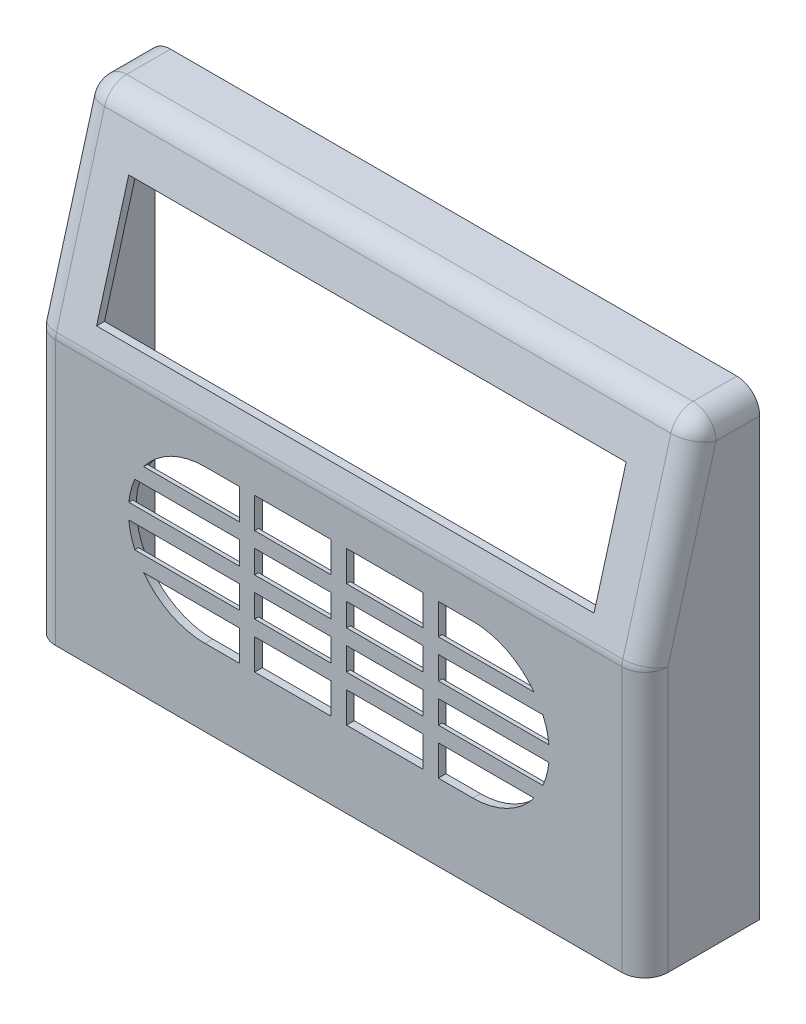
ISO-10303-21;
HEADER;
FILE_DESCRIPTION(('STEP AP214'),'2;1');
FILE_NAME('part.step','',(''),(''),'','','');
FILE_SCHEMA(('AUTOMOTIVE_DESIGN { 1 0 10303 214 1 1 1 1 }'));
ENDSEC;
DATA;
#1=APPLICATION_CONTEXT('core data for automotive mechanical design processes');
#2=APPLICATION_PROTOCOL_DEFINITION('international standard','automotive_design',2000,#1);
#3=PRODUCT_CONTEXT('',#1,'mechanical');
#4=PRODUCT('Part','Part','',(#3));
#5=PRODUCT_RELATED_PRODUCT_CATEGORY('part','',(#4));
#6=PRODUCT_DEFINITION_FORMATION('','',#4);
#7=PRODUCT_DEFINITION_CONTEXT('part definition',#1,'design');
#8=PRODUCT_DEFINITION('design','',#6,#7);
#9=PRODUCT_DEFINITION_SHAPE('','',#8);
#10=(LENGTH_UNIT() NAMED_UNIT(*) SI_UNIT(.MILLI.,.METRE.));
#11=(NAMED_UNIT(*) PLANE_ANGLE_UNIT() SI_UNIT($,.RADIAN.));
#12=(NAMED_UNIT(*) SI_UNIT($,.STERADIAN.) SOLID_ANGLE_UNIT());
#13=UNCERTAINTY_MEASURE_WITH_UNIT(LENGTH_MEASURE(1.E-05),#10,'distance_accuracy_value','');
#14=(GEOMETRIC_REPRESENTATION_CONTEXT(3) GLOBAL_UNCERTAINTY_ASSIGNED_CONTEXT((#13)) GLOBAL_UNIT_ASSIGNED_CONTEXT((#10,
#11,#12)) REPRESENTATION_CONTEXT('',''));
#15=CARTESIAN_POINT('',(0.,0.,0.));
#16=DIRECTION('',(0.,0.,1.));
#17=DIRECTION('',(1.,0.,0.));
#18=AXIS2_PLACEMENT_3D('',#15,#16,#17);
#19=CARTESIAN_POINT('',(0.,30.,-955.));
#20=DIRECTION('',(0.,1.,0.));
#21=DIRECTION('',(0.,0.,1.));
#22=AXIS2_PLACEMENT_3D('',#19,#20,#21);
#23=PLANE('',#22);
#24=DIRECTION('',(-1.,0.,0.));
#25=VECTOR('',#24,1.);
#26=CARTESIAN_POINT('',(0.,30.,15.));
#27=LINE('',#26,#25);
#28=CARTESIAN_POINT('',(-1.00000000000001,30.,15.));
#29=VERTEX_POINT('',#28);
#30=CARTESIAN_POINT('',(-11.,30.,15.));
#31=VERTEX_POINT('',#30);
#32=EDGE_CURVE('E1453',#29,#31,#27,.T.);
#33=ORIENTED_EDGE('',*,*,#32,.T.);
#34=DIRECTION('',(0.,0.,1.));
#35=VECTOR('',#34,1.);
#36=CARTESIAN_POINT('',(-11.,30.,-965.));
#37=LINE('',#36,#35);
#38=CARTESIAN_POINT('',(-11.,30.,14.));
#39=VERTEX_POINT('',#38);
#40=EDGE_CURVE('E1182',#39,#31,#37,.T.);
#41=ORIENTED_EDGE('',*,*,#40,.F.);
#42=DIRECTION('',(-1.,0.,0.));
#43=VECTOR('',#42,1.);
#44=CARTESIAN_POINT('',(0.,30.,14.));
#45=LINE('',#44,#43);
#46=CARTESIAN_POINT('',(-1.00000000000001,30.,14.));
#47=VERTEX_POINT('',#46);
#48=EDGE_CURVE('E1448',#47,#39,#45,.T.);
#49=ORIENTED_EDGE('',*,*,#48,.F.);
#50=DIRECTION('',(0.,0.,1.));
#51=VECTOR('',#50,1.);
#52=CARTESIAN_POINT('',(-1.00000000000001,30.,-965.));
#53=LINE('',#52,#51);
#54=EDGE_CURVE('E1202',#47,#29,#53,.T.);
#55=ORIENTED_EDGE('',*,*,#54,.T.);
#56=EDGE_LOOP('',(#33,#41,#49,#55));
#57=FACE_BOUND('',#56,.T.);
#58=ADVANCED_FACE('F265',(#57),#23,.F.);
#59=CARTESIAN_POINT('',(0.,10.,-955.));
#60=DIRECTION('',(0.,-1.,0.));
#61=DIRECTION('',(0.,0.,-1.));
#62=AXIS2_PLACEMENT_3D('',#59,#60,#61);
#63=PLANE('',#62);
#64=DIRECTION('',(1.,0.,0.));
#65=VECTOR('',#64,1.);
#66=CARTESIAN_POINT('',(0.,10.,14.));
#67=LINE('',#66,#65);
#68=CARTESIAN_POINT('',(-11.,10.,14.));
#69=VERTEX_POINT('',#68);
#70=CARTESIAN_POINT('',(-1.00000000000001,10.,14.));
#71=VERTEX_POINT('',#70);
#72=EDGE_CURVE('E1547',#69,#71,#67,.T.);
#73=ORIENTED_EDGE('',*,*,#72,.F.);
#74=DIRECTION('',(0.,0.,-1.));
#75=VECTOR('',#74,1.);
#76=CARTESIAN_POINT('',(-11.,10.,-955.));
#77=LINE('',#76,#75);
#78=CARTESIAN_POINT('',(-11.,10.,15.));
#79=VERTEX_POINT('',#78);
#80=EDGE_CURVE('E1174',#69,#79,#77,.F.);
#81=ORIENTED_EDGE('',*,*,#80,.T.);
#82=DIRECTION('',(1.,0.,0.));
#83=VECTOR('',#82,1.);
#84=CARTESIAN_POINT('',(0.,10.,15.));
#85=LINE('',#84,#83);
#86=CARTESIAN_POINT('',(-1.00000000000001,10.,15.));
#87=VERTEX_POINT('',#86);
#88=EDGE_CURVE('E1585',#79,#87,#85,.T.);
#89=ORIENTED_EDGE('',*,*,#88,.T.);
#90=DIRECTION('',(0.,0.,1.));
#91=VECTOR('',#90,1.);
#92=CARTESIAN_POINT('',(-1.00000000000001,10.,-965.));
#93=LINE('',#92,#91);
#94=EDGE_CURVE('E1206',#71,#87,#93,.T.);
#95=ORIENTED_EDGE('',*,*,#94,.F.);
#96=EDGE_LOOP('',(#73,#81,#89,#95));
#97=FACE_BOUND('',#96,.T.);
#98=ADVANCED_FACE('F1701',(#97),#63,.F.);
#99=CARTESIAN_POINT('',(11.,30.,15.));
#100=VERTEX_POINT('',#99);
#101=CARTESIAN_POINT('',(0.999999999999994,30.,15.));
#102=VERTEX_POINT('',#101);
#103=EDGE_CURVE('E1456',#100,#102,#27,.T.);
#104=ORIENTED_EDGE('',*,*,#103,.T.);
#105=DIRECTION('',(0.,0.,1.));
#106=VECTOR('',#105,1.);
#107=CARTESIAN_POINT('',(0.999999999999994,30.,-965.));
#108=LINE('',#107,#106);
#109=CARTESIAN_POINT('',(0.999999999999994,30.,14.));
#110=VERTEX_POINT('',#109);
#111=EDGE_CURVE('E1205',#110,#102,#108,.T.);
#112=ORIENTED_EDGE('',*,*,#111,.F.);
#113=CARTESIAN_POINT('',(11.,30.,14.));
#114=VERTEX_POINT('',#113);
#115=EDGE_CURVE('E1444',#114,#110,#45,.T.);
#116=ORIENTED_EDGE('',*,*,#115,.F.);
#117=DIRECTION('',(0.,0.,1.));
#118=VECTOR('',#117,1.);
#119=CARTESIAN_POINT('',(11.,30.,-965.));
#120=LINE('',#119,#118);
#121=EDGE_CURVE('E1225',#114,#100,#120,.T.);
#122=ORIENTED_EDGE('',*,*,#121,.T.);
#123=EDGE_LOOP('',(#104,#112,#116,#122));
#124=FACE_BOUND('',#123,.T.);
#125=ADVANCED_FACE('F1573',(#124),#23,.F.);
#126=CARTESIAN_POINT('',(0.999999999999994,10.,14.));
#127=VERTEX_POINT('',#126);
#128=CARTESIAN_POINT('',(11.,10.,14.));
#129=VERTEX_POINT('',#128);
#130=EDGE_CURVE('E1542',#127,#129,#67,.T.);
#131=ORIENTED_EDGE('',*,*,#130,.F.);
#132=DIRECTION('',(0.,0.,-1.));
#133=VECTOR('',#132,1.);
#134=CARTESIAN_POINT('',(0.999999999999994,10.,-955.));
#135=LINE('',#134,#133);
#136=CARTESIAN_POINT('',(0.999999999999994,10.,15.));
#137=VERTEX_POINT('',#136);
#138=EDGE_CURVE('E1177',#127,#137,#135,.F.);
#139=ORIENTED_EDGE('',*,*,#138,.T.);
#140=CARTESIAN_POINT('',(11.,10.,15.));
#141=VERTEX_POINT('',#140);
#142=EDGE_CURVE('E1344',#137,#141,#85,.T.);
#143=ORIENTED_EDGE('',*,*,#142,.T.);
#144=DIRECTION('',(0.,0.,1.));
#145=VECTOR('',#144,1.);
#146=CARTESIAN_POINT('',(11.,10.,-965.));
#147=LINE('',#146,#145);
#148=EDGE_CURVE('E1229',#129,#141,#147,.T.);
#149=ORIENTED_EDGE('',*,*,#148,.F.);
#150=EDGE_LOOP('',(#131,#139,#143,#149));
#151=FACE_BOUND('',#150,.T.);
#152=ADVANCED_FACE('F1579',(#151),#63,.F.);
#153=CARTESIAN_POINT('',(17.5,30.,15.));
#154=VERTEX_POINT('',#153);
#155=CARTESIAN_POINT('',(13.,30.,15.));
#156=VERTEX_POINT('',#155);
#157=EDGE_CURVE('E1334',#154,#156,#27,.T.);
#158=ORIENTED_EDGE('',*,*,#157,.T.);
#159=DIRECTION('',(0.,0.,1.));
#160=VECTOR('',#159,1.);
#161=CARTESIAN_POINT('',(13.,30.,-965.));
#162=LINE('',#161,#160);
#163=CARTESIAN_POINT('',(13.,30.,14.));
#164=VERTEX_POINT('',#163);
#165=EDGE_CURVE('E1228',#164,#156,#162,.T.);
#166=ORIENTED_EDGE('',*,*,#165,.F.);
#167=CARTESIAN_POINT('',(17.5,30.,14.));
#168=VERTEX_POINT('',#167);
#169=EDGE_CURVE('E1416',#168,#164,#45,.T.);
#170=ORIENTED_EDGE('',*,*,#169,.F.);
#171=CARTESIAN_POINT('',(17.5,30.,15.));
#172=DIRECTION('',(0.,0.,-1.));
#173=VECTOR('',#172,1.);
#174=LINE('',#171,#173);
#175=EDGE_CURVE('E2642',#168,#154,#174,.F.);
#176=ORIENTED_EDGE('',*,*,#175,.T.);
#177=EDGE_LOOP('',(#158,#166,#170,#176));
#178=FACE_BOUND('',#177,.T.);
#179=ADVANCED_FACE('F1708',(#178),#23,.F.);
#180=CARTESIAN_POINT('',(13.,10.,14.));
#181=VERTEX_POINT('',#180);
#182=CARTESIAN_POINT('',(17.5,10.,14.));
#183=VERTEX_POINT('',#182);
#184=EDGE_CURVE('E1540',#181,#183,#67,.T.);
#185=ORIENTED_EDGE('',*,*,#184,.F.);
#186=DIRECTION('',(0.,0.,-1.));
#187=VECTOR('',#186,1.);
#188=CARTESIAN_POINT('',(13.,10.,-955.));
#189=LINE('',#188,#187);
#190=CARTESIAN_POINT('',(13.,10.,15.));
#191=VERTEX_POINT('',#190);
#192=EDGE_CURVE('E1200',#181,#191,#189,.F.);
#193=ORIENTED_EDGE('',*,*,#192,.T.);
#194=CARTESIAN_POINT('',(17.5,10.,15.));
#195=VERTEX_POINT('',#194);
#196=EDGE_CURVE('E1223',#191,#195,#85,.T.);
#197=ORIENTED_EDGE('',*,*,#196,.T.);
#198=CARTESIAN_POINT('',(17.5,10.,14.));
#199=DIRECTION('',(0.,0.,1.));
#200=VECTOR('',#199,1.);
#201=LINE('',#198,#200);
#202=EDGE_CURVE('E1250',#183,#195,#201,.T.);
#203=ORIENTED_EDGE('',*,*,#202,.F.);
#204=EDGE_LOOP('',(#185,#193,#197,#203));
#205=FACE_BOUND('',#204,.T.);
#206=ADVANCED_FACE('F1591',(#205),#63,.F.);
#207=CARTESIAN_POINT('',(40.,0.,15.));
#208=DIRECTION('',(0.,1.,0.));
#209=DIRECTION('',(0.,0.,1.));
#210=AXIS2_PLACEMENT_3D('',#207,#208,#209);
#211=PLANE('',#210);
#212=DIRECTION('',(0.,0.,-1.));
#213=VECTOR('',#212,1.);
#214=CARTESIAN_POINT('',(-39.,0.,15.));
#215=LINE('',#214,#213);
#216=CARTESIAN_POINT('',(-39.,0.,12.));
#217=VERTEX_POINT('',#216);
#218=CARTESIAN_POINT('',(-39.,0.,0.));
#219=VERTEX_POINT('',#218);
#220=EDGE_CURVE('E2680',#217,#219,#215,.T.);
#221=ORIENTED_EDGE('',*,*,#220,.F.);
#222=CARTESIAN_POINT('',(-37.,0.,12.));
#223=DIRECTION('',(0.,1.,0.));
#224=DIRECTION('',(0.,0.,1.));
#225=AXIS2_PLACEMENT_3D('',#222,#223,#224);
#226=CIRCLE('',#225,2.);
#227=CARTESIAN_POINT('',(-37.,0.,14.));
#228=VERTEX_POINT('',#227);
#229=EDGE_CURVE('E2674',#228,#217,#226,.F.);
#230=ORIENTED_EDGE('',*,*,#229,.F.);
#231=DIRECTION('',(-1.,0.,0.));
#232=VECTOR('',#231,1.);
#233=CARTESIAN_POINT('',(40.,0.,14.));
#234=LINE('',#233,#232);
#235=CARTESIAN_POINT('',(37.,0.,14.));
#236=VERTEX_POINT('',#235);
#237=EDGE_CURVE('E2659',#236,#228,#234,.T.);
#238=ORIENTED_EDGE('',*,*,#237,.F.);
#239=CARTESIAN_POINT('',(37.,0.,12.));
#240=DIRECTION('',(0.,1.,0.));
#241=DIRECTION('',(0.,0.,1.));
#242=AXIS2_PLACEMENT_3D('',#239,#240,#241);
#243=CIRCLE('',#242,2.);
#244=CARTESIAN_POINT('',(39.,0.,12.));
#245=VERTEX_POINT('',#244);
#246=EDGE_CURVE('E2672',#245,#236,#243,.F.);
#247=ORIENTED_EDGE('',*,*,#246,.F.);
#248=DIRECTION('',(0.,0.,-1.));
#249=VECTOR('',#248,1.);
#250=CARTESIAN_POINT('',(39.,0.,15.));
#251=LINE('',#250,#249);
#252=CARTESIAN_POINT('',(39.,0.,0.));
#253=VERTEX_POINT('',#252);
#254=EDGE_CURVE('E2668',#245,#253,#251,.T.);
#255=ORIENTED_EDGE('',*,*,#254,.T.);
#256=DIRECTION('',(-1.,0.,0.));
#257=VECTOR('',#256,1.);
#258=CARTESIAN_POINT('',(40.,0.,0.));
#259=LINE('',#258,#257);
#260=CARTESIAN_POINT('',(40.,0.,0.));
#261=VERTEX_POINT('',#260);
#262=EDGE_CURVE('E2706',#261,#253,#259,.T.);
#263=ORIENTED_EDGE('',*,*,#262,.F.);
#264=DIRECTION('',(0.,0.,-1.));
#265=VECTOR('',#264,1.);
#266=CARTESIAN_POINT('',(40.,0.,15.));
#267=LINE('',#266,#265);
#268=CARTESIAN_POINT('',(40.,0.,12.));
#269=VERTEX_POINT('',#268);
#270=EDGE_CURVE('E2687',#269,#261,#267,.T.);
#271=ORIENTED_EDGE('',*,*,#270,.F.);
#272=CARTESIAN_POINT('',(37.,0.,12.));
#273=DIRECTION('',(0.,1.,0.));
#274=DIRECTION('',(0.,0.,1.));
#275=AXIS2_PLACEMENT_3D('',#272,#273,#274);
#276=CIRCLE('',#275,3.);
#277=CARTESIAN_POINT('',(37.,0.,15.));
#278=VERTEX_POINT('',#277);
#279=EDGE_CURVE('E2741',#269,#278,#276,.F.);
#280=ORIENTED_EDGE('',*,*,#279,.T.);
#281=DIRECTION('',(-1.,0.,0.));
#282=VECTOR('',#281,1.);
#283=CARTESIAN_POINT('',(40.,0.,15.));
#284=LINE('',#283,#282);
#285=CARTESIAN_POINT('',(-37.,0.,15.));
#286=VERTEX_POINT('',#285);
#287=EDGE_CURVE('E2693',#278,#286,#284,.T.);
#288=ORIENTED_EDGE('',*,*,#287,.T.);
#289=CARTESIAN_POINT('',(-37.,0.,12.));
#290=DIRECTION('',(0.,1.,0.));
#291=DIRECTION('',(0.,0.,1.));
#292=AXIS2_PLACEMENT_3D('',#289,#290,#291);
#293=CIRCLE('',#292,3.);
#294=CARTESIAN_POINT('',(-40.,0.,12.));
#295=VERTEX_POINT('',#294);
#296=EDGE_CURVE('E2743',#286,#295,#293,.F.);
#297=ORIENTED_EDGE('',*,*,#296,.T.);
#298=DIRECTION('',(0.,0.,-1.));
#299=VECTOR('',#298,1.);
#300=CARTESIAN_POINT('',(-40.,0.,15.));
#301=LINE('',#300,#299);
#302=CARTESIAN_POINT('',(-40.,0.,0.));
#303=VERTEX_POINT('',#302);
#304=EDGE_CURVE('E2694',#295,#303,#301,.T.);
#305=ORIENTED_EDGE('',*,*,#304,.T.);
#306=EDGE_CURVE('E2705',#219,#303,#259,.T.);
#307=ORIENTED_EDGE('',*,*,#306,.F.);
#308=EDGE_LOOP('',(#221,#230,#238,#247,#255,#263,#271,#280,#288,#297,#305,#307));
#309=FACE_BOUND('',#308,.T.);
#310=ADVANCED_FACE('F1722',(#309),#211,.F.);
#311=CARTESIAN_POINT('',(40.,0.,0.));
#312=DIRECTION('',(0.,0.,1.));
#313=DIRECTION('',(1.,0.,0.));
#314=AXIS2_PLACEMENT_3D('',#311,#312,#313);
#315=PLANE('',#314);
#316=DIRECTION('',(0.,1.,0.));
#317=VECTOR('',#316,1.);
#318=CARTESIAN_POINT('',(-39.,0.,0.));
#319=LINE('',#318,#317);
#320=CARTESIAN_POINT('',(-39.,57.,0.));
#321=VERTEX_POINT('',#320);
#322=EDGE_CURVE('E2671',#219,#321,#319,.T.);
#323=ORIENTED_EDGE('',*,*,#322,.F.);
#324=ORIENTED_EDGE('',*,*,#306,.T.);
#325=DIRECTION('',(0.,1.,0.));
#326=VECTOR('',#325,1.);
#327=CARTESIAN_POINT('',(-40.,0.,0.));
#328=LINE('',#327,#326);
#329=CARTESIAN_POINT('',(-40.,57.,0.));
#330=VERTEX_POINT('',#329);
#331=EDGE_CURVE('E2690',#303,#330,#328,.T.);
#332=ORIENTED_EDGE('',*,*,#331,.T.);
#333=CARTESIAN_POINT('',(-37.,57.,0.));
#334=DIRECTION('',(0.,0.,1.));
#335=DIRECTION('',(1.,0.,0.));
#336=AXIS2_PLACEMENT_3D('',#333,#334,#335);
#337=CIRCLE('',#336,3.);
#338=CARTESIAN_POINT('',(-37.,60.,0.));
#339=VERTEX_POINT('',#338);
#340=EDGE_CURVE('E2724',#330,#339,#337,.F.);
#341=ORIENTED_EDGE('',*,*,#340,.T.);
#342=DIRECTION('',(-1.,0.,0.));
#343=VECTOR('',#342,1.);
#344=CARTESIAN_POINT('',(40.,60.,0.));
#345=LINE('',#344,#343);
#346=CARTESIAN_POINT('',(37.,60.,0.));
#347=VERTEX_POINT('',#346);
#348=EDGE_CURVE('E2702',#347,#339,#345,.T.);
#349=ORIENTED_EDGE('',*,*,#348,.F.);
#350=CARTESIAN_POINT('',(37.,57.,0.));
#351=DIRECTION('',(0.,0.,1.));
#352=DIRECTION('',(1.,0.,0.));
#353=AXIS2_PLACEMENT_3D('',#350,#351,#352);
#354=CIRCLE('',#353,3.);
#355=CARTESIAN_POINT('',(40.,57.,0.));
#356=VERTEX_POINT('',#355);
#357=EDGE_CURVE('E2722',#347,#356,#354,.F.);
#358=ORIENTED_EDGE('',*,*,#357,.T.);
#359=DIRECTION('',(0.,1.,0.));
#360=VECTOR('',#359,1.);
#361=CARTESIAN_POINT('',(40.,0.,0.));
#362=LINE('',#361,#360);
#363=EDGE_CURVE('E2689',#261,#356,#362,.T.);
#364=ORIENTED_EDGE('',*,*,#363,.F.);
#365=ORIENTED_EDGE('',*,*,#262,.T.);
#366=DIRECTION('',(0.,1.,0.));
#367=VECTOR('',#366,1.);
#368=CARTESIAN_POINT('',(39.,0.,0.));
#369=LINE('',#368,#367);
#370=CARTESIAN_POINT('',(39.,57.,0.));
#371=VERTEX_POINT('',#370);
#372=EDGE_CURVE('E2665',#253,#371,#369,.T.);
#373=ORIENTED_EDGE('',*,*,#372,.T.);
#374=CARTESIAN_POINT('',(37.,57.,0.));
#375=DIRECTION('',(0.,0.,1.));
#376=DIRECTION('',(1.,0.,0.));
#377=AXIS2_PLACEMENT_3D('',#374,#375,#376);
#378=CIRCLE('',#377,2.);
#379=CARTESIAN_POINT('',(37.,59.,0.));
#380=VERTEX_POINT('',#379);
#381=EDGE_CURVE('E2660',#380,#371,#378,.F.);
#382=ORIENTED_EDGE('',*,*,#381,.F.);
#383=DIRECTION('',(-1.,0.,0.));
#384=VECTOR('',#383,1.);
#385=CARTESIAN_POINT('',(40.,59.,0.));
#386=LINE('',#385,#384);
#387=CARTESIAN_POINT('',(-37.,59.,0.));
#388=VERTEX_POINT('',#387);
#389=EDGE_CURVE('E2655',#380,#388,#386,.T.);
#390=ORIENTED_EDGE('',*,*,#389,.T.);
#391=CARTESIAN_POINT('',(-37.,57.,0.));
#392=DIRECTION('',(0.,0.,1.));
#393=DIRECTION('',(1.,0.,0.));
#394=AXIS2_PLACEMENT_3D('',#391,#392,#393);
#395=CIRCLE('',#394,2.);
#396=EDGE_CURVE('E2663',#321,#388,#395,.F.);
#397=ORIENTED_EDGE('',*,*,#396,.F.);
#398=EDGE_LOOP('',(#323,#324,#332,#341,#349,#358,#364,#365,#373,#382,#390,#397));
#399=FACE_BOUND('',#398,.T.);
#400=ADVANCED_FACE('F1896',(#399),#315,.F.);
#401=CARTESIAN_POINT('',(40.,60.,0.));
#402=DIRECTION('',(0.,-1.,0.));
#403=DIRECTION('',(0.,0.,-1.));
#404=AXIS2_PLACEMENT_3D('',#401,#402,#403);
#405=PLANE('',#404);
#406=ORIENTED_EDGE('',*,*,#348,.T.);
#407=DIRECTION('',(0.,0.,1.));
#408=VECTOR('',#407,1.);
#409=CARTESIAN_POINT('',(-37.,60.,0.));
#410=LINE('',#409,#408);
#411=CARTESIAN_POINT('',(-37.,60.,5.72461880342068));
#412=VERTEX_POINT('',#411);
#413=EDGE_CURVE('E2713',#339,#412,#410,.T.);
#414=ORIENTED_EDGE('',*,*,#413,.T.);
#415=DIRECTION('',(-1.,0.,0.));
#416=VECTOR('',#415,1.);
#417=CARTESIAN_POINT('',(40.,60.,5.72461880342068));
#418=LINE('',#417,#416);
#419=CARTESIAN_POINT('',(37.,60.,5.72461880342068));
#420=VERTEX_POINT('',#419);
#421=EDGE_CURVE('E2711',#412,#420,#418,.F.);
#422=ORIENTED_EDGE('',*,*,#421,.T.);
#423=DIRECTION('',(0.,0.,1.));
#424=VECTOR('',#423,1.);
#425=CARTESIAN_POINT('',(37.,60.,0.));
#426=LINE('',#425,#424);
#427=EDGE_CURVE('E2709',#420,#347,#426,.F.);
#428=ORIENTED_EDGE('',*,*,#427,.T.);
#429=EDGE_LOOP('',(#406,#414,#422,#428));
#430=FACE_BOUND('',#429,.T.);
#431=ADVANCED_FACE('F1901',(#430),#405,.F.);
#432=CARTESIAN_POINT('',(40.,60.,8.));
#433=DIRECTION('',(0.,-0.269629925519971,-0.962964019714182));
#434=DIRECTION('',(0.,0.962964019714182,-0.269629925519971));
#435=AXIS2_PLACEMENT_3D('',#432,#433,#434);
#436=PLANE('',#435);
#437=DIRECTION('',(0.,-0.962964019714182,0.269629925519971));
#438=VECTOR('',#437,1.);
#439=CARTESIAN_POINT('',(-32.5,254.399109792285,-46.4317507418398));
#440=LINE('',#439,#438);
#441=CARTESIAN_POINT('',(-32.5,53.,9.95999999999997));
#442=VERTEX_POINT('',#441);
#443=CARTESIAN_POINT('',(-32.5,38.,14.1599999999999));
#444=VERTEX_POINT('',#443);
#445=EDGE_CURVE('E849',#442,#444,#440,.T.);
#446=ORIENTED_EDGE('',*,*,#445,.F.);
#447=DIRECTION('',(-1.,0.,0.));
#448=VECTOR('',#447,1.);
#449=CARTESIAN_POINT('',(0.,53.,9.95999999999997));
#450=LINE('',#449,#448);
#451=CARTESIAN_POINT('',(32.5,53.,9.95999999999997));
#452=VERTEX_POINT('',#451);
#453=EDGE_CURVE('E843',#452,#442,#450,.T.);
#454=ORIENTED_EDGE('',*,*,#453,.F.);
#455=DIRECTION('',(0.,0.962964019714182,-0.269629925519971));
#456=VECTOR('',#455,1.);
#457=CARTESIAN_POINT('',(32.5,254.399109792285,-46.4317507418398));
#458=LINE('',#457,#456);
#459=CARTESIAN_POINT('',(32.5,38.,14.16));
#460=VERTEX_POINT('',#459);
#461=EDGE_CURVE('E854',#460,#452,#458,.T.);
#462=ORIENTED_EDGE('',*,*,#461,.F.);
#463=DIRECTION('',(1.,0.,0.));
#464=VECTOR('',#463,1.);
#465=CARTESIAN_POINT('',(0.,38.,14.1600000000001));
#466=LINE('',#465,#464);
#467=EDGE_CURVE('E284',#444,#460,#466,.T.);
#468=ORIENTED_EDGE('',*,*,#467,.F.);
#469=EDGE_LOOP('',(#446,#454,#462,#468));
#470=FACE_BOUND('',#469,.T.);
#471=DIRECTION('',(-1.,0.,0.));
#472=VECTOR('',#471,1.);
#473=CARTESIAN_POINT('',(40.,57.8088897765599,8.61351086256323));
#474=LINE('',#473,#472);
#475=CARTESIAN_POINT('',(37.,57.8088897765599,8.61351086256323));
#476=VERTEX_POINT('',#475);
#477=CARTESIAN_POINT('',(-37.,57.8088897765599,8.61351086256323));
#478=VERTEX_POINT('',#477);
#479=EDGE_CURVE('E2730',#476,#478,#474,.T.);
#480=ORIENTED_EDGE('',*,*,#479,.T.);
#481=DIRECTION('',(0.,-0.962964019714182,0.269629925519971));
#482=VECTOR('',#481,1.);
#483=CARTESIAN_POINT('',(-37.,60.,8.));
#484=LINE('',#483,#482);
#485=CARTESIAN_POINT('',(-37.,35.3968140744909,14.8888920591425));
#486=VERTEX_POINT('',#485);
#487=EDGE_CURVE('E2733',#478,#486,#484,.T.);
#488=ORIENTED_EDGE('',*,*,#487,.T.);
#489=DIRECTION('',(-1.,0.,0.));
#490=VECTOR('',#489,1.);
#491=CARTESIAN_POINT('',(40.,35.3968140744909,14.8888920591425));
#492=LINE('',#491,#490);
#493=CARTESIAN_POINT('',(37.,35.3968140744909,14.8888920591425));
#494=VERTEX_POINT('',#493);
#495=EDGE_CURVE('E2728',#486,#494,#492,.F.);
#496=ORIENTED_EDGE('',*,*,#495,.T.);
#497=DIRECTION('',(0.,-0.962964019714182,0.269629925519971));
#498=VECTOR('',#497,1.);
#499=CARTESIAN_POINT('',(37.,60.,8.));
#500=LINE('',#499,#498);
#501=EDGE_CURVE('E2726',#494,#476,#500,.F.);
#502=ORIENTED_EDGE('',*,*,#501,.T.);
#503=EDGE_LOOP('',(#480,#488,#496,#502));
#504=FACE_BOUND('',#503,.T.);
#505=ADVANCED_FACE('F2055',(#470,#504),#436,.F.);
#506=CARTESIAN_POINT('',(40.,35.,15.));
#507=DIRECTION('',(0.,0.,-1.));
#508=DIRECTION('',(0.,1.,0.));
#509=AXIS2_PLACEMENT_3D('',#506,#507,#508);
#510=PLANE('',#509);
#511=DIRECTION('',(-1.,0.,0.));
#512=VECTOR('',#511,1.);
#513=CARTESIAN_POINT('',(0.,16.,15.));
#514=LINE('',#513,#512);
#515=CARTESIAN_POINT('',(-1.00000000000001,16.,15.));
#516=VERTEX_POINT('',#515);
#517=CARTESIAN_POINT('',(-11.,16.,15.));
#518=VERTEX_POINT('',#517);
#519=EDGE_CURVE('E946',#516,#518,#514,.T.);
#520=ORIENTED_EDGE('',*,*,#519,.T.);
#521=DIRECTION('',(0.,1.,0.));
#522=VECTOR('',#521,1.);
#523=CARTESIAN_POINT('',(-11.,-1.00613961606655E-13,15.));
#524=LINE('',#523,#522);
#525=CARTESIAN_POINT('',(-11.,19.,15.));
#526=VERTEX_POINT('',#525);
#527=EDGE_CURVE('E1195',#518,#526,#524,.T.);
#528=ORIENTED_EDGE('',*,*,#527,.T.);
#529=DIRECTION('',(1.,0.,0.));
#530=VECTOR('',#529,1.);
#531=CARTESIAN_POINT('',(0.,19.,15.));
#532=LINE('',#531,#530);
#533=CARTESIAN_POINT('',(-1.00000000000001,19.,15.));
#534=VERTEX_POINT('',#533);
#535=EDGE_CURVE('E1007',#526,#534,#532,.T.);
#536=ORIENTED_EDGE('',*,*,#535,.T.);
#537=DIRECTION('',(0.,-1.,0.));
#538=VECTOR('',#537,1.);
#539=CARTESIAN_POINT('',(-1.00000000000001,-1.00613961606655E-13,15.));
#540=LINE('',#539,#538);
#541=EDGE_CURVE('E2951',#534,#516,#540,.T.);
#542=ORIENTED_EDGE('',*,*,#541,.T.);
#543=EDGE_LOOP('',(#520,#528,#536,#542));
#544=FACE_BOUND('',#543,.T.);
#545=CARTESIAN_POINT('',(11.,16.,15.));
#546=VERTEX_POINT('',#545);
#547=CARTESIAN_POINT('',(0.999999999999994,16.,15.));
#548=VERTEX_POINT('',#547);
#549=EDGE_CURVE('E943',#546,#548,#514,.T.);
#550=ORIENTED_EDGE('',*,*,#549,.T.);
#551=DIRECTION('',(0.,1.,0.));
#552=VECTOR('',#551,1.);
#553=CARTESIAN_POINT('',(0.999999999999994,-1.00613961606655E-13,15.));
#554=LINE('',#553,#552);
#555=CARTESIAN_POINT('',(0.999999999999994,19.,15.));
#556=VERTEX_POINT('',#555);
#557=EDGE_CURVE('E1218',#548,#556,#554,.T.);
#558=ORIENTED_EDGE('',*,*,#557,.T.);
#559=CARTESIAN_POINT('',(11.,19.,15.));
#560=VERTEX_POINT('',#559);
#561=EDGE_CURVE('E1025',#556,#560,#532,.T.);
#562=ORIENTED_EDGE('',*,*,#561,.T.);
#563=DIRECTION('',(0.,-1.,0.));
#564=VECTOR('',#563,1.);
#565=CARTESIAN_POINT('',(11.,-1.00613961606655E-13,15.));
#566=LINE('',#565,#564);
#567=EDGE_CURVE('E2632',#560,#546,#566,.T.);
#568=ORIENTED_EDGE('',*,*,#567,.T.);
#569=EDGE_LOOP('',(#550,#558,#562,#568));
#570=FACE_BOUND('',#569,.T.);
#571=CARTESIAN_POINT('',(26.6651583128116,16.,15.));
#572=VERTEX_POINT('',#571);
#573=CARTESIAN_POINT('',(13.,16.,15.));
#574=VERTEX_POINT('',#573);
#575=EDGE_CURVE('E905',#572,#574,#514,.T.);
#576=ORIENTED_EDGE('',*,*,#575,.T.);
#577=DIRECTION('',(0.,1.,0.));
#578=VECTOR('',#577,1.);
#579=CARTESIAN_POINT('',(13.,-1.00613961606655E-13,15.));
#580=LINE('',#579,#578);
#581=CARTESIAN_POINT('',(13.,19.,15.));
#582=VERTEX_POINT('',#581);
#583=EDGE_CURVE('E1241',#574,#582,#580,.T.);
#584=ORIENTED_EDGE('',*,*,#583,.T.);
#585=CARTESIAN_POINT('',(27.449991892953,19.,15.));
#586=VERTEX_POINT('',#585);
#587=EDGE_CURVE('E1027',#582,#586,#532,.T.);
#588=ORIENTED_EDGE('',*,*,#587,.T.);
#589=CARTESIAN_POINT('',(17.5,10.,15.));
#590=CARTESIAN_POINT('',(18.4851812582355,10.0001083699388,15.));
#591=CARTESIAN_POINT('',(19.4509032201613,10.1921471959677,15.));
#592=CARTESIAN_POINT('',(20.4163635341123,10.3841339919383,15.));
#593=CARTESIAN_POINT('',(21.3268343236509,10.7612046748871,15.));
#594=CARTESIAN_POINT('',(22.236288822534,11.1378544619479,15.));
#595=CARTESIAN_POINT('',(23.055702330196,11.6853038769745,15.));
#596=CARTESIAN_POINT('',(23.8742011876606,12.2321422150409,15.));
#597=CARTESIAN_POINT('',(24.5710678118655,12.9289321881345,15.));
#598=CARTESIAN_POINT('',(25.2671565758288,13.6249443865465,15.));
#599=CARTESIAN_POINT('',(25.8146961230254,14.444297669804,15.));
#600=CARTESIAN_POINT('',(26.3616244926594,15.2627363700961,15.));
#601=CARTESIAN_POINT('',(26.7387953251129,16.1731656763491,15.));
#602=CARTESIAN_POINT('',(27.115545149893,17.0825787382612,15.));
#603=CARTESIAN_POINT('',(27.3078528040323,18.0490967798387,15.));
#604=CARTESIAN_POINT('',(27.4999457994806,19.014535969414,15.));
#605=CARTESIAN_POINT('',(27.5,20.,15.));
#606=CARTESIAN_POINT('',(27.5000541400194,20.9843640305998,15.));
#607=CARTESIAN_POINT('',(27.3078528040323,21.9509032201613,15.));
#608=CARTESIAN_POINT('',(27.1158660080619,22.9163635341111,15.));
#609=CARTESIAN_POINT('',(26.7387953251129,23.8268343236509,15.));
#610=CARTESIAN_POINT('',(26.3621455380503,24.7362888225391,15.));
#611=CARTESIAN_POINT('',(25.8146961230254,25.555702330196,15.));
#612=CARTESIAN_POINT('',(25.2678577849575,26.3742011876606,15.));
#613=CARTESIAN_POINT('',(24.5710678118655,27.0710678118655,15.));
#614=CARTESIAN_POINT('',(23.8750556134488,27.767156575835,15.));
#615=CARTESIAN_POINT('',(23.055702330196,28.3146961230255,15.));
#616=CARTESIAN_POINT('',(22.2372636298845,28.8616244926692,15.));
#617=CARTESIAN_POINT('',(21.3268343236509,29.2387953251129,15.));
#618=CARTESIAN_POINT('',(20.4174212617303,29.6155451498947,15.));
#619=CARTESIAN_POINT('',(19.4509032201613,29.8078528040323,15.));
#620=CARTESIAN_POINT('',(18.4857365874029,29.999891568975,15.));
#621=CARTESIAN_POINT('',(17.5,30.,15.));
#622=B_SPLINE_CURVE_WITH_KNOTS('',2,(#589,#590,#591,#592,#593,#594,#595,#596,#597,#598,#599,
#600,#601,#602,#603,#604,#605,#606,#607,#608,#609,#610,#611,#612,#613,#614,#615,#616,#617,#618,
#619,#620,#621),.UNSPECIFIED.,.F.,.F.,(3,2,2,2,2,2,2,2,2,2,2,2,2,2,2,2,3),(0.,0.0625,0.125,
0.1875,0.25,0.3125,0.375,0.4375,0.5,0.5625,0.625,0.6875,0.75,0.8125,0.875,0.9375,1.),.UNSPECIFIED.);
#623=EDGE_CURVE('E1496',#572,#586,#622,.T.);
#624=ORIENTED_EDGE('',*,*,#623,.F.);
#625=EDGE_LOOP('',(#576,#584,#588,#624));
#626=FACE_BOUND('',#625,.T.);
#627=DIRECTION('',(1.,0.,0.));
#628=VECTOR('',#627,1.);
#629=CARTESIAN_POINT('',(0.,14.,15.));
#630=LINE('',#629,#628);
#631=CARTESIAN_POINT('',(0.999999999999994,14.,15.));
#632=VERTEX_POINT('',#631);
#633=CARTESIAN_POINT('',(11.,14.,15.));
#634=VERTEX_POINT('',#633);
#635=EDGE_CURVE('E922',#632,#634,#630,.T.);
#636=ORIENTED_EDGE('',*,*,#635,.T.);
#637=EDGE_CURVE('E1237',#634,#141,#566,.T.);
#638=ORIENTED_EDGE('',*,*,#637,.T.);
#639=ORIENTED_EDGE('',*,*,#142,.F.);
#640=EDGE_CURVE('E1215',#137,#632,#554,.T.);
#641=ORIENTED_EDGE('',*,*,#640,.T.);
#642=EDGE_LOOP('',(#636,#638,#639,#641));
#643=FACE_BOUND('',#642,.T.);
#644=CARTESIAN_POINT('',(-11.,14.,15.));
#645=VERTEX_POINT('',#644);
#646=CARTESIAN_POINT('',(-1.00000000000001,14.,15.));
#647=VERTEX_POINT('',#646);
#648=EDGE_CURVE('E904',#645,#647,#630,.T.);
#649=ORIENTED_EDGE('',*,*,#648,.T.);
#650=EDGE_CURVE('E1214',#647,#87,#540,.T.);
#651=ORIENTED_EDGE('',*,*,#650,.T.);
#652=ORIENTED_EDGE('',*,*,#88,.F.);
#653=EDGE_CURVE('E1192',#79,#645,#524,.T.);
#654=ORIENTED_EDGE('',*,*,#653,.T.);
#655=EDGE_LOOP('',(#649,#651,#652,#654));
#656=FACE_BOUND('',#655,.T.);
#657=CARTESIAN_POINT('',(-25.5001055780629,14.,15.0000000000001));
#658=VERTEX_POINT('',#657);
#659=CARTESIAN_POINT('',(-13.,14.,15.));
#660=VERTEX_POINT('',#659);
#661=EDGE_CURVE('E896',#658,#660,#630,.T.);
#662=ORIENTED_EDGE('',*,*,#661,.T.);
#663=DIRECTION('',(0.,-1.,0.));
#664=VECTOR('',#663,1.);
#665=CARTESIAN_POINT('',(-13.,-1.00613961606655E-13,15.));
#666=LINE('',#665,#664);
#667=CARTESIAN_POINT('',(-13.,10.,15.));
#668=VERTEX_POINT('',#667);
#669=EDGE_CURVE('E1191',#660,#668,#666,.T.);
#670=ORIENTED_EDGE('',*,*,#669,.T.);
#671=CARTESIAN_POINT('',(-17.5,10.,15.));
#672=VERTEX_POINT('',#671);
#673=EDGE_CURVE('E1481',#672,#668,#85,.T.);
#674=ORIENTED_EDGE('',*,*,#673,.F.);
#675=CARTESIAN_POINT('',(-17.5,30.,15.));
#676=CARTESIAN_POINT('',(-18.4851812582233,29.9998916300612,15.));
#677=CARTESIAN_POINT('',(-19.4509032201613,29.8078528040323,15.));
#678=CARTESIAN_POINT('',(-20.4163635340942,29.6158660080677,15.));
#679=CARTESIAN_POINT('',(-21.3268343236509,29.2387953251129,15.));
#680=CARTESIAN_POINT('',(-22.2362888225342,28.8621455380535,15.));
#681=CARTESIAN_POINT('',(-23.055702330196,28.3146961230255,15.));
#682=CARTESIAN_POINT('',(-23.8742011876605,27.7678577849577,15.));
#683=CARTESIAN_POINT('',(-24.5710678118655,27.0710678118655,15.));
#684=CARTESIAN_POINT('',(-25.2671565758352,26.3750556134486,15.));
#685=CARTESIAN_POINT('',(-25.8146961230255,25.555702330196,15.));
#686=CARTESIAN_POINT('',(-26.3616244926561,24.737263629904,15.));
#687=CARTESIAN_POINT('',(-26.7387953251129,23.8268343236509,15.));
#688=CARTESIAN_POINT('',(-27.1155451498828,22.9174212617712,15.));
#689=CARTESIAN_POINT('',(-27.3078528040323,21.9509032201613,15.));
#690=CARTESIAN_POINT('',(-27.4999457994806,20.985464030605,15.));
#691=CARTESIAN_POINT('',(-27.5,20.,15.));
#692=CARTESIAN_POINT('',(-27.5000541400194,19.0156359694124,15.));
#693=CARTESIAN_POINT('',(-27.3078528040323,18.0490967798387,15.));
#694=CARTESIAN_POINT('',(-27.1158660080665,17.0836364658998,15.));
#695=CARTESIAN_POINT('',(-26.7387953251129,16.1731656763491,15.));
#696=CARTESIAN_POINT('',(-26.3621455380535,15.2637111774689,15.));
#697=CARTESIAN_POINT('',(-25.8146961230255,14.444297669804,15.));
#698=CARTESIAN_POINT('',(-25.2678577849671,13.6257988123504,15.));
#699=CARTESIAN_POINT('',(-24.5710678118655,12.9289321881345,15.));
#700=CARTESIAN_POINT('',(-23.8750556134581,12.2328434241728,15.));
#701=CARTESIAN_POINT('',(-23.055702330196,11.6853038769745,15.));
#702=CARTESIAN_POINT('',(-22.2372636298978,11.1383755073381,15.));
#703=CARTESIAN_POINT('',(-21.3268343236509,10.7612046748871,15.));
#704=CARTESIAN_POINT('',(-20.4174212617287,10.3844548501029,15.));
#705=CARTESIAN_POINT('',(-19.4509032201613,10.1921471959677,15.));
#706=CARTESIAN_POINT('',(-18.485736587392,10.000108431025,15.));
#707=CARTESIAN_POINT('',(-17.5,10.,15.));
#708=B_SPLINE_CURVE_WITH_KNOTS('',2,(#675,#676,#677,#678,#679,#680,#681,#682,#683,#684,#685,
#686,#687,#688,#689,#690,#691,#692,#693,#694,#695,#696,#697,#698,#699,#700,#701,#702,#703,#704,
#705,#706,#707),.UNSPECIFIED.,.F.,.F.,(3,2,2,2,2,2,2,2,2,2,2,2,2,2,2,2,3),(0.,0.0625,0.125,
0.1875,0.25,0.3125,0.375,0.4375,0.5,0.5625,0.625,0.6875,0.75,0.8125,0.875,0.9375,1.),.UNSPECIFIED.);
#709=EDGE_CURVE('E1325',#658,#672,#708,.T.);
#710=ORIENTED_EDGE('',*,*,#709,.F.);
#711=EDGE_LOOP('',(#662,#670,#674,#710));
#712=FACE_BOUND('',#711,.T.);
#713=CARTESIAN_POINT('',(-13.,16.,15.));
#714=VERTEX_POINT('',#713);
#715=CARTESIAN_POINT('',(-26.6651748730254,16.,15.));
#716=VERTEX_POINT('',#715);
#717=EDGE_CURVE('E949',#714,#716,#514,.T.);
#718=ORIENTED_EDGE('',*,*,#717,.T.);
#719=CARTESIAN_POINT('',(-27.4499907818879,19.,14.9999999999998));
#720=VERTEX_POINT('',#719);
#721=EDGE_CURVE('E1333',#720,#716,#708,.T.);
#722=ORIENTED_EDGE('',*,*,#721,.F.);
#723=CARTESIAN_POINT('',(-13.,19.,15.));
#724=VERTEX_POINT('',#723);
#725=EDGE_CURVE('E999',#720,#724,#532,.T.);
#726=ORIENTED_EDGE('',*,*,#725,.T.);
#727=EDGE_CURVE('E2972',#724,#714,#666,.T.);
#728=ORIENTED_EDGE('',*,*,#727,.T.);
#729=EDGE_LOOP('',(#718,#722,#726,#728));
#730=FACE_BOUND('',#729,.T.);
#731=DIRECTION('',(-1.,0.,0.));
#732=VECTOR('',#731,1.);
#733=CARTESIAN_POINT('',(0.,21.,15.));
#734=LINE('',#733,#732);
#735=CARTESIAN_POINT('',(-1.00000000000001,21.,15.));
#736=VERTEX_POINT('',#735);
#737=CARTESIAN_POINT('',(-11.,21.,15.));
#738=VERTEX_POINT('',#737);
#739=EDGE_CURVE('E1050',#736,#738,#734,.T.);
#740=ORIENTED_EDGE('',*,*,#739,.T.);
#741=CARTESIAN_POINT('',(-11.,24.,15.));
#742=VERTEX_POINT('',#741);
#743=EDGE_CURVE('E2962',#738,#742,#524,.T.);
#744=ORIENTED_EDGE('',*,*,#743,.T.);
#745=DIRECTION('',(1.,0.,0.));
#746=VECTOR('',#745,1.);
#747=CARTESIAN_POINT('',(0.,24.,15.));
#748=LINE('',#747,#746);
#749=CARTESIAN_POINT('',(-1.00000000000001,24.,15.));
#750=VERTEX_POINT('',#749);
#751=EDGE_CURVE('E1111',#742,#750,#748,.T.);
#752=ORIENTED_EDGE('',*,*,#751,.T.);
#753=EDGE_CURVE('E1213',#750,#736,#540,.T.);
#754=ORIENTED_EDGE('',*,*,#753,.T.);
#755=EDGE_LOOP('',(#740,#744,#752,#754));
#756=FACE_BOUND('',#755,.T.);
#757=CARTESIAN_POINT('',(11.,21.,15.));
#758=VERTEX_POINT('',#757);
#759=CARTESIAN_POINT('',(0.999999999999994,21.,15.));
#760=VERTEX_POINT('',#759);
#761=EDGE_CURVE('E1047',#758,#760,#734,.T.);
#762=ORIENTED_EDGE('',*,*,#761,.T.);
#763=CARTESIAN_POINT('',(0.999999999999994,24.,15.));
#764=VERTEX_POINT('',#763);
#765=EDGE_CURVE('E2942',#760,#764,#554,.T.);
#766=ORIENTED_EDGE('',*,*,#765,.T.);
#767=CARTESIAN_POINT('',(11.,24.,15.));
#768=VERTEX_POINT('',#767);
#769=EDGE_CURVE('E1129',#764,#768,#748,.T.);
#770=ORIENTED_EDGE('',*,*,#769,.T.);
#771=EDGE_CURVE('E1236',#768,#758,#566,.T.);
#772=ORIENTED_EDGE('',*,*,#771,.T.);
#773=EDGE_LOOP('',(#762,#766,#770,#772));
#774=FACE_BOUND('',#773,.T.);
#775=CARTESIAN_POINT('',(27.4499907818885,21.,15.));
#776=VERTEX_POINT('',#775);
#777=CARTESIAN_POINT('',(13.,21.,15.));
#778=VERTEX_POINT('',#777);
#779=EDGE_CURVE('E1008',#776,#778,#734,.T.);
#780=ORIENTED_EDGE('',*,*,#779,.T.);
#781=CARTESIAN_POINT('',(13.,24.,15.));
#782=VERTEX_POINT('',#781);
#783=EDGE_CURVE('E1514',#778,#782,#580,.T.);
#784=ORIENTED_EDGE('',*,*,#783,.T.);
#785=CARTESIAN_POINT('',(26.6651748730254,24.,15.));
#786=VERTEX_POINT('',#785);
#787=EDGE_CURVE('E1131',#782,#786,#748,.T.);
#788=ORIENTED_EDGE('',*,*,#787,.T.);
#789=EDGE_CURVE('E1480',#776,#786,#622,.T.);
#790=ORIENTED_EDGE('',*,*,#789,.F.);
#791=EDGE_LOOP('',(#780,#784,#788,#790));
#792=FACE_BOUND('',#791,.T.);
#793=CARTESIAN_POINT('',(-13.,21.,15.));
#794=VERTEX_POINT('',#793);
#795=CARTESIAN_POINT('',(-27.449991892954,21.,15.));
#796=VERTEX_POINT('',#795);
#797=EDGE_CURVE('E1053',#794,#796,#734,.T.);
#798=ORIENTED_EDGE('',*,*,#797,.T.);
#799=CARTESIAN_POINT('',(-26.6651583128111,24.,15.));
#800=VERTEX_POINT('',#799);
#801=EDGE_CURVE('E1357',#800,#796,#708,.T.);
#802=ORIENTED_EDGE('',*,*,#801,.F.);
#803=CARTESIAN_POINT('',(-13.,24.,15.));
#804=VERTEX_POINT('',#803);
#805=EDGE_CURVE('E1103',#800,#804,#748,.T.);
#806=ORIENTED_EDGE('',*,*,#805,.T.);
#807=EDGE_CURVE('E1190',#804,#794,#666,.T.);
#808=ORIENTED_EDGE('',*,*,#807,.T.);
#809=EDGE_LOOP('',(#798,#802,#806,#808));
#810=FACE_BOUND('',#809,.T.);
#811=DIRECTION('',(-1.,0.,0.));
#812=VECTOR('',#811,1.);
#813=CARTESIAN_POINT('',(0.,26.,15.));
#814=LINE('',#813,#812);
#815=CARTESIAN_POINT('',(-1.00000000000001,26.,15.));
#816=VERTEX_POINT('',#815);
#817=CARTESIAN_POINT('',(-11.,26.,15.));
#818=VERTEX_POINT('',#817);
#819=EDGE_CURVE('E1154',#816,#818,#814,.T.);
#820=ORIENTED_EDGE('',*,*,#819,.T.);
#821=EDGE_CURVE('E1186',#818,#31,#524,.T.);
#822=ORIENTED_EDGE('',*,*,#821,.T.);
#823=ORIENTED_EDGE('',*,*,#32,.F.);
#824=EDGE_CURVE('E1210',#29,#816,#540,.T.);
#825=ORIENTED_EDGE('',*,*,#824,.T.);
#826=EDGE_LOOP('',(#820,#822,#823,#825));
#827=FACE_BOUND('',#826,.T.);
#828=CARTESIAN_POINT('',(11.,26.,15.));
#829=VERTEX_POINT('',#828);
#830=CARTESIAN_POINT('',(0.999999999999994,26.,15.));
#831=VERTEX_POINT('',#830);
#832=EDGE_CURVE('E1151',#829,#831,#814,.T.);
#833=ORIENTED_EDGE('',*,*,#832,.T.);
#834=EDGE_CURVE('E1209',#831,#102,#554,.T.);
#835=ORIENTED_EDGE('',*,*,#834,.T.);
#836=ORIENTED_EDGE('',*,*,#103,.F.);
#837=EDGE_CURVE('E1233',#100,#829,#566,.T.);
#838=ORIENTED_EDGE('',*,*,#837,.T.);
#839=EDGE_LOOP('',(#833,#835,#836,#838));
#840=FACE_BOUND('',#839,.T.);
#841=CARTESIAN_POINT('',(25.5001055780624,26.,15.));
#842=VERTEX_POINT('',#841);
#843=CARTESIAN_POINT('',(13.,26.,15.));
#844=VERTEX_POINT('',#843);
#845=EDGE_CURVE('E1112',#842,#844,#814,.T.);
#846=ORIENTED_EDGE('',*,*,#845,.T.);
#847=EDGE_CURVE('E1232',#844,#156,#580,.T.);
#848=ORIENTED_EDGE('',*,*,#847,.T.);
#849=ORIENTED_EDGE('',*,*,#157,.F.);
#850=EDGE_CURVE('E1479',#842,#154,#622,.T.);
#851=ORIENTED_EDGE('',*,*,#850,.F.);
#852=EDGE_LOOP('',(#846,#848,#849,#851));
#853=FACE_BOUND('',#852,.T.);
#854=CARTESIAN_POINT('',(-13.,26.,15.));
#855=VERTEX_POINT('',#854);
#856=CARTESIAN_POINT('',(-25.5000812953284,26.,15.));
#857=VERTEX_POINT('',#856);
#858=EDGE_CURVE('E1157',#855,#857,#814,.T.);
#859=ORIENTED_EDGE('',*,*,#858,.T.);
#860=CARTESIAN_POINT('',(-17.5,30.,15.));
#861=VERTEX_POINT('',#860);
#862=EDGE_CURVE('E1353',#861,#857,#708,.T.);
#863=ORIENTED_EDGE('',*,*,#862,.F.);
#864=CARTESIAN_POINT('',(-13.,30.,15.));
#865=VERTEX_POINT('',#864);
#866=EDGE_CURVE('E1457',#865,#861,#27,.T.);
#867=ORIENTED_EDGE('',*,*,#866,.F.);
#868=EDGE_CURVE('E1187',#865,#855,#666,.T.);
#869=ORIENTED_EDGE('',*,*,#868,.T.);
#870=EDGE_LOOP('',(#859,#863,#867,#869));
#871=FACE_BOUND('',#870,.T.);
#872=CARTESIAN_POINT('',(13.,14.,15.));
#873=VERTEX_POINT('',#872);
#874=EDGE_CURVE('E1238',#191,#873,#580,.T.);
#875=ORIENTED_EDGE('',*,*,#874,.T.);
#876=CARTESIAN_POINT('',(25.5000812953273,14.,15.));
#877=VERTEX_POINT('',#876);
#878=EDGE_CURVE('E924',#873,#877,#630,.T.);
#879=ORIENTED_EDGE('',*,*,#878,.T.);
#880=EDGE_CURVE('E1463',#195,#877,#622,.T.);
#881=ORIENTED_EDGE('',*,*,#880,.F.);
#882=ORIENTED_EDGE('',*,*,#196,.F.);
#883=EDGE_LOOP('',(#875,#879,#881,#882));
#884=FACE_BOUND('',#883,.T.);
#885=DIRECTION('',(-1.,0.,0.));
#886=VECTOR('',#885,1.);
#887=CARTESIAN_POINT('',(40.,34.587924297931,15.));
#888=LINE('',#887,#886);
#889=CARTESIAN_POINT('',(37.,34.587924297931,15.));
#890=VERTEX_POINT('',#889);
#891=CARTESIAN_POINT('',(-37.,34.587924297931,15.));
#892=VERTEX_POINT('',#891);
#893=EDGE_CURVE('E2737',#890,#892,#888,.T.);
#894=ORIENTED_EDGE('',*,*,#893,.T.);
#895=DIRECTION('',(0.,-1.,0.));
#896=VECTOR('',#895,1.);
#897=CARTESIAN_POINT('',(-37.,35.,15.));
#898=LINE('',#897,#896);
#899=EDGE_CURVE('E2739',#892,#286,#898,.T.);
#900=ORIENTED_EDGE('',*,*,#899,.T.);
#901=ORIENTED_EDGE('',*,*,#287,.F.);
#902=DIRECTION('',(0.,-1.,0.));
#903=VECTOR('',#902,1.);
#904=CARTESIAN_POINT('',(37.,35.,15.));
#905=LINE('',#904,#903);
#906=EDGE_CURVE('E2735',#278,#890,#905,.F.);
#907=ORIENTED_EDGE('',*,*,#906,.T.);
#908=EDGE_LOOP('',(#894,#900,#901,#907));
#909=FACE_BOUND('',#908,.T.);
#910=ADVANCED_FACE('F1511',(#544,#570,#626,#643,#656,#712,#730,#756,#774,#792,#810,#827,#840,
#853,#871,#884,#909),#510,.F.);
#911=CARTESIAN_POINT('',(40.,0.,0.));
#912=DIRECTION('',(1.,0.,0.));
#913=DIRECTION('',(0.,0.,-1.));
#914=AXIS2_PLACEMENT_3D('',#911,#912,#913);
#915=PLANE('',#914);
#916=DIRECTION('',(0.,-0.962964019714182,0.269629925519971));
#917=VECTOR('',#916,1.);
#918=CARTESIAN_POINT('',(40.,34.1911102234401,12.1111079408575));
#919=LINE('',#918,#917);
#920=CARTESIAN_POINT('',(40.,57.,5.72461880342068));
#921=VERTEX_POINT('',#920);
#922=CARTESIAN_POINT('',(40.,34.587924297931,12.));
#923=VERTEX_POINT('',#922);
#924=EDGE_CURVE('E2747',#921,#923,#919,.T.);
#925=ORIENTED_EDGE('',*,*,#924,.T.);
#926=DIRECTION('',(0.,-1.,0.));
#927=VECTOR('',#926,1.);
#928=CARTESIAN_POINT('',(40.,0.,12.));
#929=LINE('',#928,#927);
#930=EDGE_CURVE('E1472',#923,#269,#929,.T.);
#931=ORIENTED_EDGE('',*,*,#930,.T.);
#932=ORIENTED_EDGE('',*,*,#270,.T.);
#933=ORIENTED_EDGE('',*,*,#363,.T.);
#934=DIRECTION('',(0.,0.,1.));
#935=VECTOR('',#934,1.);
#936=CARTESIAN_POINT('',(40.,57.,8.));
#937=LINE('',#936,#935);
#938=EDGE_CURVE('E2745',#356,#921,#937,.T.);
#939=ORIENTED_EDGE('',*,*,#938,.T.);
#940=EDGE_LOOP('',(#925,#931,#932,#933,#939));
#941=FACE_BOUND('',#940,.T.);
#942=ADVANCED_FACE('F2036',(#941),#915,.T.);
#943=CARTESIAN_POINT('',(-40.,0.,0.));
#944=DIRECTION('',(1.,0.,0.));
#945=DIRECTION('',(0.,0.,-1.));
#946=AXIS2_PLACEMENT_3D('',#943,#944,#945);
#947=PLANE('',#946);
#948=DIRECTION('',(0.,-0.962964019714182,0.269629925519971));
#949=VECTOR('',#948,1.);
#950=CARTESIAN_POINT('',(-40.,5.63027936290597,20.108140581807));
#951=LINE('',#950,#949);
#952=CARTESIAN_POINT('',(-40.,34.587924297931,12.));
#953=VERTEX_POINT('',#952);
#954=CARTESIAN_POINT('',(-40.,57.,5.72461880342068));
#955=VERTEX_POINT('',#954);
#956=EDGE_CURVE('E2718',#953,#955,#951,.F.);
#957=ORIENTED_EDGE('',*,*,#956,.T.);
#958=DIRECTION('',(0.,0.,1.));
#959=VECTOR('',#958,1.);
#960=CARTESIAN_POINT('',(-40.,57.,0.));
#961=LINE('',#960,#959);
#962=EDGE_CURVE('E2720',#955,#330,#961,.F.);
#963=ORIENTED_EDGE('',*,*,#962,.T.);
#964=ORIENTED_EDGE('',*,*,#331,.F.);
#965=ORIENTED_EDGE('',*,*,#304,.F.);
#966=DIRECTION('',(0.,-1.,0.));
#967=VECTOR('',#966,1.);
#968=CARTESIAN_POINT('',(-40.,0.,12.));
#969=LINE('',#968,#967);
#970=EDGE_CURVE('E2716',#295,#953,#969,.F.);
#971=ORIENTED_EDGE('',*,*,#970,.T.);
#972=EDGE_LOOP('',(#957,#963,#964,#965,#971));
#973=FACE_BOUND('',#972,.T.);
#974=ADVANCED_FACE('F2027',(#973),#947,.F.);
#975=CARTESIAN_POINT('',(37.,0.,12.));
#976=DIRECTION('',(0.,1.,0.));
#977=DIRECTION('',(0.,0.,1.));
#978=AXIS2_PLACEMENT_3D('',#975,#976,#977);
#979=CYLINDRICAL_SURFACE('',#978,3.);
#980=CARTESIAN_POINT('',(37.,34.587924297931,12.));
#981=DIRECTION('',(0.,1.,0.));
#982=DIRECTION('',(-1.,0.,0.));
#983=AXIS2_PLACEMENT_3D('',#980,#981,#982);
#984=CIRCLE('',#983,3.);
#985=EDGE_CURVE('E2697',#890,#923,#984,.T.);
#986=ORIENTED_EDGE('',*,*,#985,.F.);
#987=ORIENTED_EDGE('',*,*,#906,.F.);
#988=ORIENTED_EDGE('',*,*,#279,.F.);
#989=ORIENTED_EDGE('',*,*,#930,.F.);
#990=EDGE_LOOP('',(#986,#987,#988,#989));
#991=FACE_BOUND('',#990,.T.);
#992=ADVANCED_FACE('F267',(#991),#979,.T.);
#993=CARTESIAN_POINT('',(37.,34.587924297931,12.));
#994=DIRECTION('',(0.,0.,1.));
#995=DIRECTION('',(1.,0.,0.));
#996=AXIS2_PLACEMENT_3D('',#993,#994,#995);
#997=SPHERICAL_SURFACE('',#996,3.);
#998=CARTESIAN_POINT('',(37.,34.587924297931,12.));
#999=DIRECTION('',(1.,0.,0.));
#1000=DIRECTION('',(0.,0.,-1.));
#1001=AXIS2_PLACEMENT_3D('',#998,#999,#1000);
#1002=CIRCLE('',#1001,3.);
#1003=EDGE_CURVE('E2776',#890,#494,#1002,.F.);
#1004=ORIENTED_EDGE('',*,*,#1003,.F.);
#1005=ORIENTED_EDGE('',*,*,#985,.T.);
#1006=CARTESIAN_POINT('',(37.,34.587924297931,12.));
#1007=DIRECTION('',(0.,-0.962964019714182,0.269629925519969));
#1008=DIRECTION('',(0.,-0.269629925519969,-0.962964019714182));
#1009=AXIS2_PLACEMENT_3D('',#1006,#1007,#1008);
#1010=CIRCLE('',#1009,3.);
#1011=EDGE_CURVE('E2779',#494,#923,#1010,.F.);
#1012=ORIENTED_EDGE('',*,*,#1011,.F.);
#1013=EDGE_LOOP('',(#1004,#1005,#1012));
#1014=FACE_BOUND('',#1013,.T.);
#1015=ADVANCED_FACE('F2009',(#1014),#997,.T.);
#1016=CARTESIAN_POINT('',(37.,57.,0.));
#1017=DIRECTION('',(0.,0.,-1.));
#1018=DIRECTION('',(-1.,0.,0.));
#1019=AXIS2_PLACEMENT_3D('',#1016,#1017,#1018);
#1020=CYLINDRICAL_SURFACE('',#1019,3.);
#1021=ORIENTED_EDGE('',*,*,#357,.F.);
#1022=ORIENTED_EDGE('',*,*,#427,.F.);
#1023=CARTESIAN_POINT('',(37.,57.,5.72461880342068));
#1024=DIRECTION('',(0.,0.,1.));
#1025=DIRECTION('',(0.,-1.,0.));
#1026=AXIS2_PLACEMENT_3D('',#1023,#1024,#1025);
#1027=CIRCLE('',#1026,3.);
#1028=EDGE_CURVE('E2773',#921,#420,#1027,.T.);
#1029=ORIENTED_EDGE('',*,*,#1028,.F.);
#1030=ORIENTED_EDGE('',*,*,#938,.F.);
#1031=EDGE_LOOP('',(#1021,#1022,#1029,#1030));
#1032=FACE_BOUND('',#1031,.T.);
#1033=ADVANCED_FACE('F1999',(#1032),#1020,.T.);
#1034=CARTESIAN_POINT('',(37.,5.63027936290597,20.108140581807));
#1035=DIRECTION('',(0.,0.962964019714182,-0.269629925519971));
#1036=DIRECTION('',(0.,0.269629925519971,0.962964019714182));
#1037=AXIS2_PLACEMENT_3D('',#1034,#1035,#1036);
#1038=CYLINDRICAL_SURFACE('',#1037,3.);
#1039=ORIENTED_EDGE('',*,*,#1011,.T.);
#1040=ORIENTED_EDGE('',*,*,#924,.F.);
#1041=CARTESIAN_POINT('',(37.,57.,5.72461880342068));
#1042=DIRECTION('',(0.,0.962964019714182,-0.269629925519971));
#1043=DIRECTION('',(0.,0.269629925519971,0.962964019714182));
#1044=AXIS2_PLACEMENT_3D('',#1041,#1042,#1043);
#1045=CIRCLE('',#1044,3.);
#1046=EDGE_CURVE('E2770',#476,#921,#1045,.T.);
#1047=ORIENTED_EDGE('',*,*,#1046,.F.);
#1048=ORIENTED_EDGE('',*,*,#501,.F.);
#1049=EDGE_LOOP('',(#1039,#1040,#1047,#1048));
#1050=FACE_BOUND('',#1049,.T.);
#1051=ADVANCED_FACE('F1989',(#1050),#1038,.T.);
#1052=CARTESIAN_POINT('',(40.,34.587924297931,12.));
#1053=DIRECTION('',(-1.,0.,0.));
#1054=DIRECTION('',(0.,0.,1.));
#1055=AXIS2_PLACEMENT_3D('',#1052,#1053,#1054);
#1056=CYLINDRICAL_SURFACE('',#1055,3.);
#1057=ORIENTED_EDGE('',*,*,#1003,.T.);
#1058=ORIENTED_EDGE('',*,*,#495,.F.);
#1059=CARTESIAN_POINT('',(-37.,34.587924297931,12.));
#1060=DIRECTION('',(-1.,0.,0.));
#1061=DIRECTION('',(0.,0.,1.));
#1062=AXIS2_PLACEMENT_3D('',#1059,#1060,#1061);
#1063=CIRCLE('',#1062,3.);
#1064=EDGE_CURVE('E2767',#892,#486,#1063,.T.);
#1065=ORIENTED_EDGE('',*,*,#1064,.F.);
#1066=ORIENTED_EDGE('',*,*,#893,.F.);
#1067=EDGE_LOOP('',(#1057,#1058,#1065,#1066));
#1068=FACE_BOUND('',#1067,.T.);
#1069=ADVANCED_FACE('F1979',(#1068),#1056,.T.);
#1070=CARTESIAN_POINT('',(-37.,35.,12.));
#1071=DIRECTION('',(0.,-1.,0.));
#1072=DIRECTION('',(0.,0.,-1.));
#1073=AXIS2_PLACEMENT_3D('',#1070,#1071,#1072);
#1074=CYLINDRICAL_SURFACE('',#1073,3.);
#1075=ORIENTED_EDGE('',*,*,#296,.F.);
#1076=ORIENTED_EDGE('',*,*,#899,.F.);
#1077=CARTESIAN_POINT('',(-37.,34.587924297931,12.));
#1078=DIRECTION('',(0.,1.,0.));
#1079=DIRECTION('',(0.,0.,1.));
#1080=AXIS2_PLACEMENT_3D('',#1077,#1078,#1079);
#1081=CIRCLE('',#1080,3.);
#1082=EDGE_CURVE('E2764',#953,#892,#1081,.T.);
#1083=ORIENTED_EDGE('',*,*,#1082,.F.);
#1084=ORIENTED_EDGE('',*,*,#970,.F.);
#1085=EDGE_LOOP('',(#1075,#1076,#1083,#1084));
#1086=FACE_BOUND('',#1085,.T.);
#1087=ADVANCED_FACE('F1969',(#1086),#1074,.T.);
#1088=CARTESIAN_POINT('',(37.,57.,5.72461880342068));
#1089=DIRECTION('',(0.,0.,1.));
#1090=DIRECTION('',(1.,0.,0.));
#1091=AXIS2_PLACEMENT_3D('',#1088,#1089,#1090);
#1092=SPHERICAL_SURFACE('',#1091,3.);
#1093=ORIENTED_EDGE('',*,*,#1046,.T.);
#1094=ORIENTED_EDGE('',*,*,#1028,.T.);
#1095=CARTESIAN_POINT('',(37.,57.,5.72461880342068));
#1096=DIRECTION('',(1.,0.,0.));
#1097=DIRECTION('',(0.,0.,-1.));
#1098=AXIS2_PLACEMENT_3D('',#1095,#1096,#1097);
#1099=CIRCLE('',#1098,3.);
#1100=EDGE_CURVE('E2761',#476,#420,#1099,.F.);
#1101=ORIENTED_EDGE('',*,*,#1100,.F.);
#1102=EDGE_LOOP('',(#1093,#1094,#1101));
#1103=FACE_BOUND('',#1102,.T.);
#1104=ADVANCED_FACE('F1959',(#1103),#1092,.T.);
#1105=CARTESIAN_POINT('',(-37.,34.587924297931,12.));
#1106=DIRECTION('',(0.,0.,1.));
#1107=DIRECTION('',(1.,0.,0.));
#1108=AXIS2_PLACEMENT_3D('',#1105,#1106,#1107);
#1109=SPHERICAL_SURFACE('',#1108,3.);
#1110=ORIENTED_EDGE('',*,*,#1082,.T.);
#1111=ORIENTED_EDGE('',*,*,#1064,.T.);
#1112=CARTESIAN_POINT('',(-37.,34.587924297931,12.));
#1113=DIRECTION('',(0.,-0.962964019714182,0.269629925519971));
#1114=DIRECTION('',(0.,-0.269629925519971,-0.962964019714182));
#1115=AXIS2_PLACEMENT_3D('',#1112,#1113,#1114);
#1116=CIRCLE('',#1115,3.);
#1117=EDGE_CURVE('E2758',#953,#486,#1116,.F.);
#1118=ORIENTED_EDGE('',*,*,#1117,.F.);
#1119=EDGE_LOOP('',(#1110,#1111,#1118));
#1120=FACE_BOUND('',#1119,.T.);
#1121=ADVANCED_FACE('F1949',(#1120),#1109,.T.);
#1122=CARTESIAN_POINT('',(40.,57.,5.72461880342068));
#1123=DIRECTION('',(-1.,0.,0.));
#1124=DIRECTION('',(0.,0.,1.));
#1125=AXIS2_PLACEMENT_3D('',#1122,#1123,#1124);
#1126=CYLINDRICAL_SURFACE('',#1125,3.);
#1127=ORIENTED_EDGE('',*,*,#1100,.T.);
#1128=ORIENTED_EDGE('',*,*,#421,.F.);
#1129=CARTESIAN_POINT('',(-37.,57.,5.72461880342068));
#1130=DIRECTION('',(-1.,0.,0.));
#1131=DIRECTION('',(0.,0.,1.));
#1132=AXIS2_PLACEMENT_3D('',#1129,#1130,#1131);
#1133=CIRCLE('',#1132,3.);
#1134=EDGE_CURVE('E2755',#478,#412,#1133,.T.);
#1135=ORIENTED_EDGE('',*,*,#1134,.F.);
#1136=ORIENTED_EDGE('',*,*,#479,.F.);
#1137=EDGE_LOOP('',(#1127,#1128,#1135,#1136));
#1138=FACE_BOUND('',#1137,.T.);
#1139=ADVANCED_FACE('F1939',(#1138),#1126,.T.);
#1140=CARTESIAN_POINT('',(-37.,59.1911102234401,5.11110794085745));
#1141=DIRECTION('',(0.,-0.962964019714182,0.269629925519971));
#1142=DIRECTION('',(0.,-0.269629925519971,-0.962964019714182));
#1143=AXIS2_PLACEMENT_3D('',#1140,#1141,#1142);
#1144=CYLINDRICAL_SURFACE('',#1143,3.);
#1145=ORIENTED_EDGE('',*,*,#1117,.T.);
#1146=ORIENTED_EDGE('',*,*,#487,.F.);
#1147=CARTESIAN_POINT('',(-37.,57.,5.72461880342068));
#1148=DIRECTION('',(0.,0.962964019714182,-0.269629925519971));
#1149=DIRECTION('',(0.,0.269629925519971,0.962964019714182));
#1150=AXIS2_PLACEMENT_3D('',#1147,#1148,#1149);
#1151=CIRCLE('',#1150,3.);
#1152=EDGE_CURVE('E2752',#955,#478,#1151,.T.);
#1153=ORIENTED_EDGE('',*,*,#1152,.F.);
#1154=ORIENTED_EDGE('',*,*,#956,.F.);
#1155=EDGE_LOOP('',(#1145,#1146,#1153,#1154));
#1156=FACE_BOUND('',#1155,.T.);
#1157=ADVANCED_FACE('F1929',(#1156),#1144,.T.);
#1158=CARTESIAN_POINT('',(-37.,57.,5.72461880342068));
#1159=DIRECTION('',(0.,0.,1.));
#1160=DIRECTION('',(1.,0.,0.));
#1161=AXIS2_PLACEMENT_3D('',#1158,#1159,#1160);
#1162=SPHERICAL_SURFACE('',#1161,3.);
#1163=ORIENTED_EDGE('',*,*,#1152,.T.);
#1164=ORIENTED_EDGE('',*,*,#1134,.T.);
#1165=CARTESIAN_POINT('',(-37.,57.,5.72461880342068));
#1166=DIRECTION('',(0.,0.,1.));
#1167=DIRECTION('',(1.,0.,0.));
#1168=AXIS2_PLACEMENT_3D('',#1165,#1166,#1167);
#1169=CIRCLE('',#1168,3.);
#1170=EDGE_CURVE('E2750',#955,#412,#1169,.F.);
#1171=ORIENTED_EDGE('',*,*,#1170,.F.);
#1172=EDGE_LOOP('',(#1163,#1164,#1171));
#1173=FACE_BOUND('',#1172,.T.);
#1174=ADVANCED_FACE('F1919',(#1173),#1162,.T.);
#1175=CARTESIAN_POINT('',(-37.,57.,0.));
#1176=DIRECTION('',(0.,0.,1.));
#1177=DIRECTION('',(1.,0.,0.));
#1178=AXIS2_PLACEMENT_3D('',#1175,#1176,#1177);
#1179=CYLINDRICAL_SURFACE('',#1178,3.);
#1180=ORIENTED_EDGE('',*,*,#340,.F.);
#1181=ORIENTED_EDGE('',*,*,#962,.F.);
#1182=ORIENTED_EDGE('',*,*,#1170,.T.);
#1183=ORIENTED_EDGE('',*,*,#413,.F.);
#1184=EDGE_LOOP('',(#1180,#1181,#1182,#1183));
#1185=FACE_BOUND('',#1184,.T.);
#1186=ADVANCED_FACE('F1887',(#1185),#1179,.T.);
#1187=CARTESIAN_POINT('',(40.,59.,0.));
#1188=DIRECTION('',(0.,-1.,0.));
#1189=DIRECTION('',(0.,0.,-1.));
#1190=AXIS2_PLACEMENT_3D('',#1187,#1188,#1189);
#1191=PLANE('',#1190);
#1192=ORIENTED_EDGE('',*,*,#389,.F.);
#1193=DIRECTION('',(0.,0.,-1.));
#1194=VECTOR('',#1193,1.);
#1195=CARTESIAN_POINT('',(37.,59.,0.));
#1196=LINE('',#1195,#1194);
#1197=CARTESIAN_POINT('',(37.,59.,5.72461880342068));
#1198=VERTEX_POINT('',#1197);
#1199=EDGE_CURVE('E2658',#1198,#380,#1196,.T.);
#1200=ORIENTED_EDGE('',*,*,#1199,.F.);
#1201=DIRECTION('',(1.,0.,0.));
#1202=VECTOR('',#1201,1.);
#1203=CARTESIAN_POINT('',(40.,59.,5.72461880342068));
#1204=LINE('',#1203,#1202);
#1205=CARTESIAN_POINT('',(-37.,59.,5.72461880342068));
#1206=VERTEX_POINT('',#1205);
#1207=EDGE_CURVE('E2837',#1206,#1198,#1204,.T.);
#1208=ORIENTED_EDGE('',*,*,#1207,.F.);
#1209=DIRECTION('',(0.,0.,-1.));
#1210=VECTOR('',#1209,1.);
#1211=CARTESIAN_POINT('',(-37.,59.,0.));
#1212=LINE('',#1211,#1210);
#1213=EDGE_CURVE('E2841',#388,#1206,#1212,.F.);
#1214=ORIENTED_EDGE('',*,*,#1213,.F.);
#1215=EDGE_LOOP('',(#1192,#1200,#1208,#1214));
#1216=FACE_BOUND('',#1215,.T.);
#1217=ADVANCED_FACE('F1882',(#1216),#1191,.T.);
#1218=CARTESIAN_POINT('',(40.,59.73037007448,7.03703598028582));
#1219=DIRECTION('',(0.,-0.269629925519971,-0.962964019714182));
#1220=DIRECTION('',(0.,0.962964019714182,-0.269629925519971));
#1221=AXIS2_PLACEMENT_3D('',#1218,#1219,#1220);
#1222=PLANE('',#1221);
#1223=DIRECTION('',(-1.,0.,0.));
#1224=VECTOR('',#1223,1.);
#1225=CARTESIAN_POINT('',(0.,53.,8.92153960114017));
#1226=LINE('',#1225,#1224);
#1227=CARTESIAN_POINT('',(32.5,53.,8.92153960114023));
#1228=VERTEX_POINT('',#1227);
#1229=CARTESIAN_POINT('',(-32.5,53.,8.92153960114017));
#1230=VERTEX_POINT('',#1229);
#1231=EDGE_CURVE('E840',#1228,#1230,#1226,.T.);
#1232=ORIENTED_EDGE('',*,*,#1231,.T.);
#1233=DIRECTION('',(0.,-0.962964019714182,0.269629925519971));
#1234=VECTOR('',#1233,1.);
#1235=CARTESIAN_POINT('',(-32.5,254.129479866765,-47.394714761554));
#1236=LINE('',#1235,#1234);
#1237=CARTESIAN_POINT('',(-32.5,38.,13.1215396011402));
#1238=VERTEX_POINT('',#1237);
#1239=EDGE_CURVE('E827',#1230,#1238,#1236,.T.);
#1240=ORIENTED_EDGE('',*,*,#1239,.T.);
#1241=DIRECTION('',(1.,0.,0.));
#1242=VECTOR('',#1241,1.);
#1243=CARTESIAN_POINT('',(0.,38.,13.1215396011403));
#1244=LINE('',#1243,#1242);
#1245=CARTESIAN_POINT('',(32.5,38.,13.1215396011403));
#1246=VERTEX_POINT('',#1245);
#1247=EDGE_CURVE('E858',#1238,#1246,#1244,.T.);
#1248=ORIENTED_EDGE('',*,*,#1247,.T.);
#1249=DIRECTION('',(0.,0.962964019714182,-0.269629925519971));
#1250=VECTOR('',#1249,1.);
#1251=CARTESIAN_POINT('',(32.5,254.129479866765,-47.394714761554));
#1252=LINE('',#1251,#1250);
#1253=EDGE_CURVE('E848',#1246,#1228,#1252,.T.);
#1254=ORIENTED_EDGE('',*,*,#1253,.T.);
#1255=EDGE_LOOP('',(#1232,#1240,#1248,#1254));
#1256=FACE_BOUND('',#1255,.T.);
#1257=DIRECTION('',(1.,0.,0.));
#1258=VECTOR('',#1257,1.);
#1259=CARTESIAN_POINT('',(40.,57.5392598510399,7.65054684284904));
#1260=LINE('',#1259,#1258);
#1261=CARTESIAN_POINT('',(37.,57.5392598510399,7.65054684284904));
#1262=VERTEX_POINT('',#1261);
#1263=CARTESIAN_POINT('',(-37.,57.5392598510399,7.65054684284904));
#1264=VERTEX_POINT('',#1263);
#1265=EDGE_CURVE('E2866',#1262,#1264,#1260,.F.);
#1266=ORIENTED_EDGE('',*,*,#1265,.F.);
#1267=DIRECTION('',(0.,0.962964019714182,-0.269629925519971));
#1268=VECTOR('',#1267,1.);
#1269=CARTESIAN_POINT('',(37.,59.73037007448,7.03703598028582));
#1270=LINE('',#1269,#1268);
#1271=CARTESIAN_POINT('',(37.,35.1271841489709,13.9259280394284));
#1272=VERTEX_POINT('',#1271);
#1273=EDGE_CURVE('E2686',#1272,#1262,#1270,.T.);
#1274=ORIENTED_EDGE('',*,*,#1273,.F.);
#1275=DIRECTION('',(1.,0.,0.));
#1276=VECTOR('',#1275,1.);
#1277=CARTESIAN_POINT('',(40.,35.1271841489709,13.9259280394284));
#1278=LINE('',#1277,#1276);
#1279=CARTESIAN_POINT('',(-37.,35.1271841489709,13.9259280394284));
#1280=VERTEX_POINT('',#1279);
#1281=EDGE_CURVE('E2869',#1280,#1272,#1278,.T.);
#1282=ORIENTED_EDGE('',*,*,#1281,.F.);
#1283=DIRECTION('',(0.,0.962964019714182,-0.269629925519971));
#1284=VECTOR('',#1283,1.);
#1285=CARTESIAN_POINT('',(-37.,59.73037007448,7.03703598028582));
#1286=LINE('',#1285,#1284);
#1287=EDGE_CURVE('E2859',#1264,#1280,#1286,.F.);
#1288=ORIENTED_EDGE('',*,*,#1287,.F.);
#1289=EDGE_LOOP('',(#1266,#1274,#1282,#1288));
#1290=FACE_BOUND('',#1289,.T.);
#1291=ADVANCED_FACE('F846',(#1256,#1290),#1222,.T.);
#1292=CARTESIAN_POINT('',(40.,35.,14.));
#1293=DIRECTION('',(0.,0.,-1.));
#1294=DIRECTION('',(0.,1.,0.));
#1295=AXIS2_PLACEMENT_3D('',#1292,#1293,#1294);
#1296=PLANE('',#1295);
#1297=ORIENTED_EDGE('',*,*,#48,.T.);
#1298=DIRECTION('',(0.,1.,0.));
#1299=VECTOR('',#1298,1.);
#1300=CARTESIAN_POINT('',(-11.,-1.00514834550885E-13,14.));
#1301=LINE('',#1300,#1299);
#1302=EDGE_CURVE('E1178',#69,#39,#1301,.T.);
#1303=ORIENTED_EDGE('',*,*,#1302,.F.);
#1304=ORIENTED_EDGE('',*,*,#72,.T.);
#1305=DIRECTION('',(0.,-1.,0.));
#1306=VECTOR('',#1305,1.);
#1307=CARTESIAN_POINT('',(-1.00000000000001,-1.00514834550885E-13,14.));
#1308=LINE('',#1307,#1306);
#1309=EDGE_CURVE('E1197',#47,#71,#1308,.T.);
#1310=ORIENTED_EDGE('',*,*,#1309,.F.);
#1311=EDGE_LOOP('',(#1297,#1303,#1304,#1310));
#1312=FACE_BOUND('',#1311,.T.);
#1313=ORIENTED_EDGE('',*,*,#115,.T.);
#1314=DIRECTION('',(0.,1.,0.));
#1315=VECTOR('',#1314,1.);
#1316=CARTESIAN_POINT('',(0.999999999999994,-1.00514834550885E-13,14.));
#1317=LINE('',#1316,#1315);
#1318=EDGE_CURVE('E1201',#127,#110,#1317,.T.);
#1319=ORIENTED_EDGE('',*,*,#1318,.F.);
#1320=ORIENTED_EDGE('',*,*,#130,.T.);
#1321=DIRECTION('',(0.,-1.,0.));
#1322=VECTOR('',#1321,1.);
#1323=CARTESIAN_POINT('',(11.,-1.00514834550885E-13,14.));
#1324=LINE('',#1323,#1322);
#1325=EDGE_CURVE('E1220',#114,#129,#1324,.T.);
#1326=ORIENTED_EDGE('',*,*,#1325,.F.);
#1327=EDGE_LOOP('',(#1313,#1319,#1320,#1326));
#1328=FACE_BOUND('',#1327,.T.);
#1329=ORIENTED_EDGE('',*,*,#169,.T.);
#1330=DIRECTION('',(0.,1.,0.));
#1331=VECTOR('',#1330,1.);
#1332=CARTESIAN_POINT('',(13.,-1.00514834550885E-13,14.));
#1333=LINE('',#1332,#1331);
#1334=EDGE_CURVE('E1224',#181,#164,#1333,.T.);
#1335=ORIENTED_EDGE('',*,*,#1334,.F.);
#1336=ORIENTED_EDGE('',*,*,#184,.T.);
#1337=CARTESIAN_POINT('',(17.5,10.,14.));
#1338=CARTESIAN_POINT('',(18.4851812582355,10.0001083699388,14.));
#1339=CARTESIAN_POINT('',(19.4509032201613,10.1921471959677,14.));
#1340=CARTESIAN_POINT('',(20.4163635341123,10.3841339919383,14.));
#1341=CARTESIAN_POINT('',(21.3268343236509,10.7612046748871,14.));
#1342=CARTESIAN_POINT('',(22.236288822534,11.1378544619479,14.));
#1343=CARTESIAN_POINT('',(23.055702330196,11.6853038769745,14.));
#1344=CARTESIAN_POINT('',(23.8742011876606,12.2321422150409,14.));
#1345=CARTESIAN_POINT('',(24.5710678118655,12.9289321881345,14.));
#1346=CARTESIAN_POINT('',(25.2671565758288,13.6249443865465,14.));
#1347=CARTESIAN_POINT('',(25.8146961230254,14.444297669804,14.));
#1348=CARTESIAN_POINT('',(26.3616244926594,15.2627363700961,14.));
#1349=CARTESIAN_POINT('',(26.7387953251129,16.1731656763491,14.));
#1350=CARTESIAN_POINT('',(27.115545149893,17.0825787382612,14.));
#1351=CARTESIAN_POINT('',(27.3078528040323,18.0490967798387,14.));
#1352=CARTESIAN_POINT('',(27.4999457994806,19.014535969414,14.));
#1353=CARTESIAN_POINT('',(27.5,20.,14.));
#1354=CARTESIAN_POINT('',(27.5000541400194,20.9843640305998,14.));
#1355=CARTESIAN_POINT('',(27.3078528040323,21.9509032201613,14.));
#1356=CARTESIAN_POINT('',(27.1158660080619,22.9163635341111,14.));
#1357=CARTESIAN_POINT('',(26.7387953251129,23.8268343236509,14.));
#1358=CARTESIAN_POINT('',(26.3621455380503,24.7362888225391,14.));
#1359=CARTESIAN_POINT('',(25.8146961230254,25.555702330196,14.));
#1360=CARTESIAN_POINT('',(25.2678577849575,26.3742011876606,14.));
#1361=CARTESIAN_POINT('',(24.5710678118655,27.0710678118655,14.));
#1362=CARTESIAN_POINT('',(23.8750556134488,27.767156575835,14.));
#1363=CARTESIAN_POINT('',(23.055702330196,28.3146961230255,14.));
#1364=CARTESIAN_POINT('',(22.2372636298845,28.8616244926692,14.));
#1365=CARTESIAN_POINT('',(21.3268343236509,29.2387953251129,14.));
#1366=CARTESIAN_POINT('',(20.4174212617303,29.6155451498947,14.));
#1367=CARTESIAN_POINT('',(19.4509032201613,29.8078528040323,14.));
#1368=CARTESIAN_POINT('',(18.4857365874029,29.999891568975,14.));
#1369=CARTESIAN_POINT('',(17.5,30.,14.));
#1370=B_SPLINE_CURVE_WITH_KNOTS('',2,(#1337,#1338,#1339,#1340,#1341,#1342,#1343,#1344,#1345,
#1346,#1347,#1348,#1349,#1350,#1351,#1352,#1353,#1354,#1355,#1356,#1357,#1358,#1359,#1360,#1361,
#1362,#1363,#1364,#1365,#1366,#1367,#1368,#1369),.UNSPECIFIED.,.F.,.F.,(3,2,2,2,2,2,2,2,2,2,2,2,
2,2,2,2,3),(0.,0.0625,0.125,0.1875,0.25,0.3125,0.375,0.4375,0.5,0.5625,0.625,0.6875,0.75,0.8125,
0.875,0.9375,1.),.UNSPECIFIED.);
#1371=EDGE_CURVE('E1556',#183,#168,#1370,.T.);
#1372=ORIENTED_EDGE('',*,*,#1371,.T.);
#1373=EDGE_LOOP('',(#1329,#1335,#1336,#1372));
#1374=FACE_BOUND('',#1373,.T.);
#1375=DIRECTION('',(0.,-1.,0.));
#1376=VECTOR('',#1375,1.);
#1377=CARTESIAN_POINT('',(-13.,-1.00514834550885E-13,14.));
#1378=LINE('',#1377,#1376);
#1379=CARTESIAN_POINT('',(-13.,30.,14.));
#1380=VERTEX_POINT('',#1379);
#1381=CARTESIAN_POINT('',(-13.,10.,14.));
#1382=VERTEX_POINT('',#1381);
#1383=EDGE_CURVE('E1175',#1380,#1382,#1378,.T.);
#1384=ORIENTED_EDGE('',*,*,#1383,.F.);
#1385=CARTESIAN_POINT('',(-17.5,30.,14.));
#1386=VERTEX_POINT('',#1385);
#1387=EDGE_CURVE('E1452',#1380,#1386,#45,.T.);
#1388=ORIENTED_EDGE('',*,*,#1387,.T.);
#1389=CARTESIAN_POINT('',(-17.5,30.,14.));
#1390=CARTESIAN_POINT('',(-18.4851812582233,29.9998916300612,14.));
#1391=CARTESIAN_POINT('',(-19.4509032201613,29.8078528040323,14.));
#1392=CARTESIAN_POINT('',(-20.4163635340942,29.6158660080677,14.));
#1393=CARTESIAN_POINT('',(-21.3268343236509,29.2387953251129,14.));
#1394=CARTESIAN_POINT('',(-22.2362888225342,28.8621455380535,14.));
#1395=CARTESIAN_POINT('',(-23.055702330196,28.3146961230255,14.));
#1396=CARTESIAN_POINT('',(-23.8742011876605,27.7678577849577,14.));
#1397=CARTESIAN_POINT('',(-24.5710678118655,27.0710678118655,14.));
#1398=CARTESIAN_POINT('',(-25.2671565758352,26.3750556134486,14.));
#1399=CARTESIAN_POINT('',(-25.8146961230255,25.555702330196,14.));
#1400=CARTESIAN_POINT('',(-26.3616244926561,24.737263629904,14.));
#1401=CARTESIAN_POINT('',(-26.7387953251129,23.8268343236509,14.));
#1402=CARTESIAN_POINT('',(-27.1155451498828,22.9174212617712,14.));
#1403=CARTESIAN_POINT('',(-27.3078528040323,21.9509032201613,14.));
#1404=CARTESIAN_POINT('',(-27.4999457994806,20.985464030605,14.));
#1405=CARTESIAN_POINT('',(-27.5,20.,14.));
#1406=CARTESIAN_POINT('',(-27.5000541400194,19.0156359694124,14.));
#1407=CARTESIAN_POINT('',(-27.3078528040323,18.0490967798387,14.));
#1408=CARTESIAN_POINT('',(-27.1158660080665,17.0836364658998,14.));
#1409=CARTESIAN_POINT('',(-26.7387953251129,16.1731656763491,14.));
#1410=CARTESIAN_POINT('',(-26.3621455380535,15.2637111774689,14.));
#1411=CARTESIAN_POINT('',(-25.8146961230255,14.444297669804,14.));
#1412=CARTESIAN_POINT('',(-25.2678577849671,13.6257988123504,14.));
#1413=CARTESIAN_POINT('',(-24.5710678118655,12.9289321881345,14.));
#1414=CARTESIAN_POINT('',(-23.8750556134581,12.2328434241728,14.));
#1415=CARTESIAN_POINT('',(-23.055702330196,11.6853038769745,14.));
#1416=CARTESIAN_POINT('',(-22.2372636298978,11.1383755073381,14.));
#1417=CARTESIAN_POINT('',(-21.3268343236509,10.7612046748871,14.));
#1418=CARTESIAN_POINT('',(-20.4174212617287,10.3844548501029,14.));
#1419=CARTESIAN_POINT('',(-19.4509032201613,10.1921471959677,14.));
#1420=CARTESIAN_POINT('',(-18.485736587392,10.000108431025,14.));
#1421=CARTESIAN_POINT('',(-17.5,10.,14.));
#1422=B_SPLINE_CURVE_WITH_KNOTS('',2,(#1389,#1390,#1391,#1392,#1393,#1394,#1395,#1396,#1397,
#1398,#1399,#1400,#1401,#1402,#1403,#1404,#1405,#1406,#1407,#1408,#1409,#1410,#1411,#1412,#1413,
#1414,#1415,#1416,#1417,#1418,#1419,#1420,#1421),.UNSPECIFIED.,.F.,.F.,(3,2,2,2,2,2,2,2,2,2,2,2,
2,2,2,2,3),(0.,0.0625,0.125,0.1875,0.25,0.3125,0.375,0.4375,0.5,0.5625,0.625,0.6875,0.75,0.8125,
0.875,0.9375,1.),.UNSPECIFIED.);
#1423=CARTESIAN_POINT('',(-17.5,10.,14.));
#1424=VERTEX_POINT('',#1423);
#1425=EDGE_CURVE('E1557',#1386,#1424,#1422,.T.);
#1426=ORIENTED_EDGE('',*,*,#1425,.T.);
#1427=EDGE_CURVE('E1554',#1424,#1382,#67,.T.);
#1428=ORIENTED_EDGE('',*,*,#1427,.T.);
#1429=EDGE_LOOP('',(#1384,#1388,#1426,#1428));
#1430=FACE_BOUND('',#1429,.T.);
#1431=DIRECTION('',(1.,0.,0.));
#1432=VECTOR('',#1431,1.);
#1433=CARTESIAN_POINT('',(40.,34.587924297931,14.));
#1434=LINE('',#1433,#1432);
#1435=CARTESIAN_POINT('',(37.,34.587924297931,14.));
#1436=VERTEX_POINT('',#1435);
#1437=CARTESIAN_POINT('',(-37.,34.587924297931,14.));
#1438=VERTEX_POINT('',#1437);
#1439=EDGE_CURVE('E2858',#1436,#1438,#1434,.F.);
#1440=ORIENTED_EDGE('',*,*,#1439,.F.);
#1441=DIRECTION('',(0.,1.,0.));
#1442=VECTOR('',#1441,1.);
#1443=CARTESIAN_POINT('',(37.,35.,14.));
#1444=LINE('',#1443,#1442);
#1445=EDGE_CURVE('E2856',#236,#1436,#1444,.T.);
#1446=ORIENTED_EDGE('',*,*,#1445,.F.);
#1447=ORIENTED_EDGE('',*,*,#237,.T.);
#1448=DIRECTION('',(0.,1.,0.));
#1449=VECTOR('',#1448,1.);
#1450=CARTESIAN_POINT('',(-37.,35.,14.));
#1451=LINE('',#1450,#1449);
#1452=EDGE_CURVE('E2675',#1438,#228,#1451,.F.);
#1453=ORIENTED_EDGE('',*,*,#1452,.F.);
#1454=EDGE_LOOP('',(#1440,#1446,#1447,#1453));
#1455=FACE_BOUND('',#1454,.T.);
#1456=ADVANCED_FACE('F1571',(#1312,#1328,#1374,#1430,#1455),#1296,.T.);
#1457=CARTESIAN_POINT('',(39.,0.,0.));
#1458=DIRECTION('',(1.,0.,0.));
#1459=DIRECTION('',(0.,0.,-1.));
#1460=AXIS2_PLACEMENT_3D('',#1457,#1458,#1459);
#1461=PLANE('',#1460);
#1462=DIRECTION('',(0.,0.962964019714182,-0.269629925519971));
#1463=VECTOR('',#1462,1.);
#1464=CARTESIAN_POINT('',(39.,5.63027936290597,20.108140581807));
#1465=LINE('',#1464,#1463);
#1466=CARTESIAN_POINT('',(39.,57.,5.72461880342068));
#1467=VERTEX_POINT('',#1466);
#1468=CARTESIAN_POINT('',(39.,34.587924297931,12.));
#1469=VERTEX_POINT('',#1468);
#1470=EDGE_CURVE('E2851',#1467,#1469,#1465,.F.);
#1471=ORIENTED_EDGE('',*,*,#1470,.F.);
#1472=DIRECTION('',(0.,0.,-1.));
#1473=VECTOR('',#1472,1.);
#1474=CARTESIAN_POINT('',(39.,57.,0.));
#1475=LINE('',#1474,#1473);
#1476=EDGE_CURVE('E2679',#371,#1467,#1475,.F.);
#1477=ORIENTED_EDGE('',*,*,#1476,.F.);
#1478=ORIENTED_EDGE('',*,*,#372,.F.);
#1479=ORIENTED_EDGE('',*,*,#254,.F.);
#1480=DIRECTION('',(0.,1.,0.));
#1481=VECTOR('',#1480,1.);
#1482=CARTESIAN_POINT('',(39.,0.,12.));
#1483=LINE('',#1482,#1481);
#1484=EDGE_CURVE('E2753',#1469,#245,#1483,.F.);
#1485=ORIENTED_EDGE('',*,*,#1484,.F.);
#1486=EDGE_LOOP('',(#1471,#1477,#1478,#1479,#1485));
#1487=FACE_BOUND('',#1486,.T.);
#1488=ADVANCED_FACE('F1865',(#1487),#1461,.F.);
#1489=CARTESIAN_POINT('',(-39.,0.,0.));
#1490=DIRECTION('',(1.,0.,0.));
#1491=DIRECTION('',(0.,0.,-1.));
#1492=AXIS2_PLACEMENT_3D('',#1489,#1490,#1491);
#1493=PLANE('',#1492);
#1494=DIRECTION('',(0.,-0.962964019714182,0.269629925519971));
#1495=VECTOR('',#1494,1.);
#1496=CARTESIAN_POINT('',(-39.,59.1911102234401,5.11110794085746));
#1497=LINE('',#1496,#1495);
#1498=CARTESIAN_POINT('',(-39.,34.587924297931,12.));
#1499=VERTEX_POINT('',#1498);
#1500=CARTESIAN_POINT('',(-39.,57.,5.72461880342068));
#1501=VERTEX_POINT('',#1500);
#1502=EDGE_CURVE('E2843',#1499,#1501,#1497,.F.);
#1503=ORIENTED_EDGE('',*,*,#1502,.F.);
#1504=DIRECTION('',(0.,1.,0.));
#1505=VECTOR('',#1504,1.);
#1506=CARTESIAN_POINT('',(-39.,0.,12.));
#1507=LINE('',#1506,#1505);
#1508=EDGE_CURVE('E2842',#217,#1499,#1507,.T.);
#1509=ORIENTED_EDGE('',*,*,#1508,.F.);
#1510=ORIENTED_EDGE('',*,*,#220,.T.);
#1511=ORIENTED_EDGE('',*,*,#322,.T.);
#1512=DIRECTION('',(0.,0.,-1.));
#1513=VECTOR('',#1512,1.);
#1514=CARTESIAN_POINT('',(-39.,57.,0.));
#1515=LINE('',#1514,#1513);
#1516=EDGE_CURVE('E2664',#1501,#321,#1515,.T.);
#1517=ORIENTED_EDGE('',*,*,#1516,.F.);
#1518=EDGE_LOOP('',(#1503,#1509,#1510,#1511,#1517));
#1519=FACE_BOUND('',#1518,.T.);
#1520=ADVANCED_FACE('F1855',(#1519),#1493,.T.);
#1521=CARTESIAN_POINT('',(37.,0.,12.));
#1522=DIRECTION('',(0.,1.,0.));
#1523=DIRECTION('',(0.,0.,1.));
#1524=AXIS2_PLACEMENT_3D('',#1521,#1522,#1523);
#1525=CYLINDRICAL_SURFACE('',#1524,2.);
#1526=CARTESIAN_POINT('',(37.,34.587924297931,12.));
#1527=DIRECTION('',(0.,-1.,0.));
#1528=DIRECTION('',(1.,0.,0.));
#1529=AXIS2_PLACEMENT_3D('',#1526,#1527,#1528);
#1530=CIRCLE('',#1529,2.);
#1531=EDGE_CURVE('E2682',#1436,#1469,#1530,.F.);
#1532=ORIENTED_EDGE('',*,*,#1531,.T.);
#1533=ORIENTED_EDGE('',*,*,#1484,.T.);
#1534=ORIENTED_EDGE('',*,*,#246,.T.);
#1535=ORIENTED_EDGE('',*,*,#1445,.T.);
#1536=EDGE_LOOP('',(#1532,#1533,#1534,#1535));
#1537=FACE_BOUND('',#1536,.T.);
#1538=ADVANCED_FACE('F1845',(#1537),#1525,.F.);
#1539=CARTESIAN_POINT('',(37.,34.587924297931,12.));
#1540=DIRECTION('',(0.,0.,1.));
#1541=DIRECTION('',(1.,0.,0.));
#1542=AXIS2_PLACEMENT_3D('',#1539,#1540,#1541);
#1543=SPHERICAL_SURFACE('',#1542,2.);
#1544=CARTESIAN_POINT('',(37.,34.587924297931,12.));
#1545=DIRECTION('',(-1.,0.,0.));
#1546=DIRECTION('',(0.,0.,1.));
#1547=AXIS2_PLACEMENT_3D('',#1544,#1545,#1546);
#1548=CIRCLE('',#1547,2.);
#1549=EDGE_CURVE('E2848',#1436,#1272,#1548,.T.);
#1550=ORIENTED_EDGE('',*,*,#1549,.T.);
#1551=CARTESIAN_POINT('',(37.,34.587924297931,12.));
#1552=DIRECTION('',(0.,0.962964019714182,-0.269629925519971));
#1553=DIRECTION('',(0.,0.269629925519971,0.962964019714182));
#1554=AXIS2_PLACEMENT_3D('',#1551,#1552,#1553);
#1555=CIRCLE('',#1554,2.);
#1556=EDGE_CURVE('E2855',#1272,#1469,#1555,.T.);
#1557=ORIENTED_EDGE('',*,*,#1556,.T.);
#1558=ORIENTED_EDGE('',*,*,#1531,.F.);
#1559=EDGE_LOOP('',(#1550,#1557,#1558));
#1560=FACE_BOUND('',#1559,.T.);
#1561=ADVANCED_FACE('F1835',(#1560),#1543,.F.);
#1562=CARTESIAN_POINT('',(37.,57.,0.));
#1563=DIRECTION('',(0.,0.,-1.));
#1564=DIRECTION('',(-1.,0.,0.));
#1565=AXIS2_PLACEMENT_3D('',#1562,#1563,#1564);
#1566=CYLINDRICAL_SURFACE('',#1565,2.);
#1567=ORIENTED_EDGE('',*,*,#381,.T.);
#1568=ORIENTED_EDGE('',*,*,#1476,.T.);
#1569=CARTESIAN_POINT('',(37.,57.,5.72461880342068));
#1570=DIRECTION('',(0.,0.,1.));
#1571=DIRECTION('',(1.,0.,0.));
#1572=AXIS2_PLACEMENT_3D('',#1569,#1570,#1571);
#1573=CIRCLE('',#1572,2.);
#1574=EDGE_CURVE('E2834',#1467,#1198,#1573,.T.);
#1575=ORIENTED_EDGE('',*,*,#1574,.T.);
#1576=ORIENTED_EDGE('',*,*,#1199,.T.);
#1577=EDGE_LOOP('',(#1567,#1568,#1575,#1576));
#1578=FACE_BOUND('',#1577,.T.);
#1579=ADVANCED_FACE('F1825',(#1578),#1566,.F.);
#1580=CARTESIAN_POINT('',(37.,5.63027936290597,20.108140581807));
#1581=DIRECTION('',(0.,0.962964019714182,-0.269629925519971));
#1582=DIRECTION('',(0.,0.269629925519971,0.962964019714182));
#1583=AXIS2_PLACEMENT_3D('',#1580,#1581,#1582);
#1584=CYLINDRICAL_SURFACE('',#1583,2.);
#1585=ORIENTED_EDGE('',*,*,#1556,.F.);
#1586=ORIENTED_EDGE('',*,*,#1273,.T.);
#1587=CARTESIAN_POINT('',(37.,57.,5.72461880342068));
#1588=DIRECTION('',(0.,0.962964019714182,-0.269629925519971));
#1589=DIRECTION('',(0.,0.269629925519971,0.962964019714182));
#1590=AXIS2_PLACEMENT_3D('',#1587,#1588,#1589);
#1591=CIRCLE('',#1590,2.);
#1592=EDGE_CURVE('E2849',#1262,#1467,#1591,.T.);
#1593=ORIENTED_EDGE('',*,*,#1592,.T.);
#1594=ORIENTED_EDGE('',*,*,#1470,.T.);
#1595=EDGE_LOOP('',(#1585,#1586,#1593,#1594));
#1596=FACE_BOUND('',#1595,.T.);
#1597=ADVANCED_FACE('F1815',(#1596),#1584,.F.);
#1598=CARTESIAN_POINT('',(40.,34.587924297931,12.));
#1599=DIRECTION('',(-1.,0.,0.));
#1600=DIRECTION('',(0.,0.,1.));
#1601=AXIS2_PLACEMENT_3D('',#1598,#1599,#1600);
#1602=CYLINDRICAL_SURFACE('',#1601,2.);
#1603=ORIENTED_EDGE('',*,*,#1549,.F.);
#1604=ORIENTED_EDGE('',*,*,#1439,.T.);
#1605=CARTESIAN_POINT('',(-37.,34.587924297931,12.));
#1606=DIRECTION('',(1.,0.,0.));
#1607=DIRECTION('',(0.,1.,0.));
#1608=AXIS2_PLACEMENT_3D('',#1605,#1606,#1607);
#1609=CIRCLE('',#1608,2.);
#1610=EDGE_CURVE('E2875',#1438,#1280,#1609,.F.);
#1611=ORIENTED_EDGE('',*,*,#1610,.T.);
#1612=ORIENTED_EDGE('',*,*,#1281,.T.);
#1613=EDGE_LOOP('',(#1603,#1604,#1611,#1612));
#1614=FACE_BOUND('',#1613,.T.);
#1615=ADVANCED_FACE('F1805',(#1614),#1602,.F.);
#1616=CARTESIAN_POINT('',(-37.,35.,12.));
#1617=DIRECTION('',(0.,-1.,0.));
#1618=DIRECTION('',(0.,0.,-1.));
#1619=AXIS2_PLACEMENT_3D('',#1616,#1617,#1618);
#1620=CYLINDRICAL_SURFACE('',#1619,2.);
#1621=ORIENTED_EDGE('',*,*,#229,.T.);
#1622=ORIENTED_EDGE('',*,*,#1508,.T.);
#1623=CARTESIAN_POINT('',(-37.,34.587924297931,12.));
#1624=DIRECTION('',(0.,1.,0.));
#1625=DIRECTION('',(-1.,0.,0.));
#1626=AXIS2_PLACEMENT_3D('',#1623,#1624,#1625);
#1627=CIRCLE('',#1626,2.);
#1628=EDGE_CURVE('E2878',#1499,#1438,#1627,.T.);
#1629=ORIENTED_EDGE('',*,*,#1628,.T.);
#1630=ORIENTED_EDGE('',*,*,#1452,.T.);
#1631=EDGE_LOOP('',(#1621,#1622,#1629,#1630));
#1632=FACE_BOUND('',#1631,.T.);
#1633=ADVANCED_FACE('F1795',(#1632),#1620,.F.);
#1634=CARTESIAN_POINT('',(37.,57.,5.72461880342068));
#1635=DIRECTION('',(0.,0.,1.));
#1636=DIRECTION('',(1.,0.,0.));
#1637=AXIS2_PLACEMENT_3D('',#1634,#1635,#1636);
#1638=SPHERICAL_SURFACE('',#1637,2.);
#1639=ORIENTED_EDGE('',*,*,#1592,.F.);
#1640=CARTESIAN_POINT('',(37.,57.,5.72461880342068));
#1641=DIRECTION('',(-1.,0.,0.));
#1642=DIRECTION('',(0.,0.,1.));
#1643=AXIS2_PLACEMENT_3D('',#1640,#1641,#1642);
#1644=CIRCLE('',#1643,2.);
#1645=EDGE_CURVE('E2880',#1262,#1198,#1644,.T.);
#1646=ORIENTED_EDGE('',*,*,#1645,.T.);
#1647=ORIENTED_EDGE('',*,*,#1574,.F.);
#1648=EDGE_LOOP('',(#1639,#1646,#1647));
#1649=FACE_BOUND('',#1648,.T.);
#1650=ADVANCED_FACE('F1785',(#1649),#1638,.F.);
#1651=CARTESIAN_POINT('',(-37.,34.587924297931,12.));
#1652=DIRECTION('',(0.,0.,1.));
#1653=DIRECTION('',(1.,0.,0.));
#1654=AXIS2_PLACEMENT_3D('',#1651,#1652,#1653);
#1655=SPHERICAL_SURFACE('',#1654,2.);
#1656=ORIENTED_EDGE('',*,*,#1628,.F.);
#1657=CARTESIAN_POINT('',(-37.,34.587924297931,12.));
#1658=DIRECTION('',(0.,-0.962964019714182,0.269629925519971));
#1659=DIRECTION('',(0.,-0.269629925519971,-0.962964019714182));
#1660=AXIS2_PLACEMENT_3D('',#1657,#1658,#1659);
#1661=CIRCLE('',#1660,2.);
#1662=EDGE_CURVE('E2884',#1499,#1280,#1661,.F.);
#1663=ORIENTED_EDGE('',*,*,#1662,.T.);
#1664=ORIENTED_EDGE('',*,*,#1610,.F.);
#1665=EDGE_LOOP('',(#1656,#1663,#1664));
#1666=FACE_BOUND('',#1665,.T.);
#1667=ADVANCED_FACE('F1775',(#1666),#1655,.F.);
#1668=CARTESIAN_POINT('',(40.,57.,5.72461880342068));
#1669=DIRECTION('',(-1.,0.,0.));
#1670=DIRECTION('',(0.,0.,1.));
#1671=AXIS2_PLACEMENT_3D('',#1668,#1669,#1670);
#1672=CYLINDRICAL_SURFACE('',#1671,2.);
#1673=ORIENTED_EDGE('',*,*,#1645,.F.);
#1674=ORIENTED_EDGE('',*,*,#1265,.T.);
#1675=CARTESIAN_POINT('',(-37.,57.,5.72461880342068));
#1676=DIRECTION('',(1.,0.,0.));
#1677=DIRECTION('',(0.,1.,0.));
#1678=AXIS2_PLACEMENT_3D('',#1675,#1676,#1677);
#1679=CIRCLE('',#1678,2.);
#1680=EDGE_CURVE('E2650',#1264,#1206,#1679,.F.);
#1681=ORIENTED_EDGE('',*,*,#1680,.T.);
#1682=ORIENTED_EDGE('',*,*,#1207,.T.);
#1683=EDGE_LOOP('',(#1673,#1674,#1681,#1682));
#1684=FACE_BOUND('',#1683,.T.);
#1685=ADVANCED_FACE('F1765',(#1684),#1672,.F.);
#1686=CARTESIAN_POINT('',(-37.,59.1911102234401,5.11110794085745));
#1687=DIRECTION('',(0.,-0.962964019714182,0.269629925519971));
#1688=DIRECTION('',(0.,-0.269629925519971,-0.962964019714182));
#1689=AXIS2_PLACEMENT_3D('',#1686,#1687,#1688);
#1690=CYLINDRICAL_SURFACE('',#1689,2.);
#1691=ORIENTED_EDGE('',*,*,#1662,.F.);
#1692=ORIENTED_EDGE('',*,*,#1502,.T.);
#1693=CARTESIAN_POINT('',(-37.,57.,5.72461880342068));
#1694=DIRECTION('',(0.,-0.962964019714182,0.269629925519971));
#1695=DIRECTION('',(0.,-0.269629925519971,-0.962964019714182));
#1696=AXIS2_PLACEMENT_3D('',#1693,#1694,#1695);
#1697=CIRCLE('',#1696,2.);
#1698=EDGE_CURVE('E2644',#1501,#1264,#1697,.F.);
#1699=ORIENTED_EDGE('',*,*,#1698,.T.);
#1700=ORIENTED_EDGE('',*,*,#1287,.T.);
#1701=EDGE_LOOP('',(#1691,#1692,#1699,#1700));
#1702=FACE_BOUND('',#1701,.T.);
#1703=ADVANCED_FACE('F1755',(#1702),#1690,.F.);
#1704=CARTESIAN_POINT('',(-37.,57.,5.72461880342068));
#1705=DIRECTION('',(0.,0.,1.));
#1706=DIRECTION('',(1.,0.,0.));
#1707=AXIS2_PLACEMENT_3D('',#1704,#1705,#1706);
#1708=SPHERICAL_SURFACE('',#1707,2.);
#1709=ORIENTED_EDGE('',*,*,#1698,.F.);
#1710=CARTESIAN_POINT('',(-37.,57.,5.72461880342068));
#1711=DIRECTION('',(0.,0.,1.));
#1712=DIRECTION('',(1.,0.,0.));
#1713=AXIS2_PLACEMENT_3D('',#1710,#1711,#1712);
#1714=CIRCLE('',#1713,2.);
#1715=EDGE_CURVE('E2643',#1501,#1206,#1714,.F.);
#1716=ORIENTED_EDGE('',*,*,#1715,.T.);
#1717=ORIENTED_EDGE('',*,*,#1680,.F.);
#1718=EDGE_LOOP('',(#1709,#1716,#1717));
#1719=FACE_BOUND('',#1718,.T.);
#1720=ADVANCED_FACE('F1714',(#1719),#1708,.F.);
#1721=CARTESIAN_POINT('',(-37.,57.,0.));
#1722=DIRECTION('',(0.,0.,1.));
#1723=DIRECTION('',(1.,0.,0.));
#1724=AXIS2_PLACEMENT_3D('',#1721,#1722,#1723);
#1725=CYLINDRICAL_SURFACE('',#1724,2.);
#1726=ORIENTED_EDGE('',*,*,#396,.T.);
#1727=ORIENTED_EDGE('',*,*,#1213,.T.);
#1728=ORIENTED_EDGE('',*,*,#1715,.F.);
#1729=ORIENTED_EDGE('',*,*,#1516,.T.);
#1730=EDGE_LOOP('',(#1726,#1727,#1728,#1729));
#1731=FACE_BOUND('',#1730,.T.);
#1732=ADVANCED_FACE('F1710',(#1731),#1725,.F.);
#1733=ORIENTED_EDGE('',*,*,#1387,.F.);
#1734=DIRECTION('',(0.,0.,1.));
#1735=VECTOR('',#1734,1.);
#1736=CARTESIAN_POINT('',(-13.,30.,-965.));
#1737=LINE('',#1736,#1735);
#1738=EDGE_CURVE('E1179',#1380,#865,#1737,.T.);
#1739=ORIENTED_EDGE('',*,*,#1738,.T.);
#1740=ORIENTED_EDGE('',*,*,#866,.T.);
#1741=CARTESIAN_POINT('',(-17.5,30.,14.));
#1742=DIRECTION('',(0.,0.,1.));
#1743=VECTOR('',#1742,1.);
#1744=LINE('',#1741,#1743);
#1745=EDGE_CURVE('E1414',#1386,#861,#1744,.T.);
#1746=ORIENTED_EDGE('',*,*,#1745,.F.);
#1747=EDGE_LOOP('',(#1733,#1739,#1740,#1746));
#1748=FACE_BOUND('',#1747,.T.);
#1749=ADVANCED_FACE('F1382',(#1748),#23,.F.);
#1750=CARTESIAN_POINT('',(-17.5,30.,-955.));
#1751=CARTESIAN_POINT('',(-18.4851812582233,29.9998916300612,-955.));
#1752=CARTESIAN_POINT('',(-19.4509032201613,29.8078528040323,-955.));
#1753=CARTESIAN_POINT('',(-20.4163635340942,29.6158660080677,-955.));
#1754=CARTESIAN_POINT('',(-21.3268343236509,29.2387953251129,-955.));
#1755=CARTESIAN_POINT('',(-22.2362888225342,28.8621455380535,-955.));
#1756=CARTESIAN_POINT('',(-23.055702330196,28.3146961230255,-955.));
#1757=CARTESIAN_POINT('',(-23.8742011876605,27.7678577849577,-955.));
#1758=CARTESIAN_POINT('',(-24.5710678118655,27.0710678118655,-955.));
#1759=CARTESIAN_POINT('',(-25.2671565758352,26.3750556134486,-955.));
#1760=CARTESIAN_POINT('',(-25.8146961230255,25.555702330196,-955.));
#1761=CARTESIAN_POINT('',(-26.3616244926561,24.737263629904,-955.));
#1762=CARTESIAN_POINT('',(-26.7387953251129,23.8268343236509,-955.));
#1763=CARTESIAN_POINT('',(-27.1155451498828,22.9174212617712,-955.));
#1764=CARTESIAN_POINT('',(-27.3078528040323,21.9509032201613,-955.));
#1765=CARTESIAN_POINT('',(-27.4999457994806,20.985464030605,-955.));
#1766=CARTESIAN_POINT('',(-27.5,20.,-955.));
#1767=CARTESIAN_POINT('',(-27.5000541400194,19.0156359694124,-955.));
#1768=CARTESIAN_POINT('',(-27.3078528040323,18.0490967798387,-955.));
#1769=CARTESIAN_POINT('',(-27.1158660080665,17.0836364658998,-955.));
#1770=CARTESIAN_POINT('',(-26.7387953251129,16.1731656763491,-955.));
#1771=CARTESIAN_POINT('',(-26.3621455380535,15.2637111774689,-955.));
#1772=CARTESIAN_POINT('',(-25.8146961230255,14.444297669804,-955.));
#1773=CARTESIAN_POINT('',(-25.2678577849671,13.6257988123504,-955.));
#1774=CARTESIAN_POINT('',(-24.5710678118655,12.9289321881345,-955.));
#1775=CARTESIAN_POINT('',(-23.8750556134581,12.2328434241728,-955.));
#1776=CARTESIAN_POINT('',(-23.055702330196,11.6853038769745,-955.));
#1777=CARTESIAN_POINT('',(-22.2372636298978,11.1383755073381,-955.));
#1778=CARTESIAN_POINT('',(-21.3268343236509,10.7612046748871,-955.));
#1779=CARTESIAN_POINT('',(-20.4174212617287,10.3844548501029,-955.));
#1780=CARTESIAN_POINT('',(-19.4509032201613,10.1921471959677,-955.));
#1781=CARTESIAN_POINT('',(-18.485736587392,10.000108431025,-955.));
#1782=CARTESIAN_POINT('',(-17.5,10.,-955.));
#1783=B_SPLINE_CURVE_WITH_KNOTS('',2,(#1750,#1751,#1752,#1753,#1754,#1755,#1756,#1757,#1758,
#1759,#1760,#1761,#1762,#1763,#1764,#1765,#1766,#1767,#1768,#1769,#1770,#1771,#1772,#1773,#1774,
#1775,#1776,#1777,#1778,#1779,#1780,#1781,#1782),.UNSPECIFIED.,.F.,.F.,(3,2,2,2,2,2,2,2,2,2,2,2,
2,2,2,2,3),(0.,0.0625,0.125,0.1875,0.25,0.3125,0.375,0.4375,0.5,0.5625,0.625,0.6875,0.75,0.8125,
0.875,0.9375,1.),.UNSPECIFIED.);
#1784=DIRECTION('',(0.,0.,1.));
#1785=VECTOR('',#1784,1.);
#1786=SURFACE_OF_LINEAR_EXTRUSION('',#1783,#1785);
#1787=ORIENTED_EDGE('',*,*,#721,.T.);
#1788=CARTESIAN_POINT('',(-26.6651748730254,16.,15.));
#1789=DIRECTION('',(0.,0.,-1.));
#1790=VECTOR('',#1789,1.);
#1791=LINE('',#1788,#1790);
#1792=CARTESIAN_POINT('',(-26.6651748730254,16.,14.5));
#1793=VERTEX_POINT('',#1792);
#1794=EDGE_CURVE('E951',#1793,#716,#1791,.F.);
#1795=ORIENTED_EDGE('',*,*,#1794,.F.);
#1796=CARTESIAN_POINT('',(-26.6651748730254,16.,14.5000000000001));
#1797=CARTESIAN_POINT('',(-26.3097787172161,15.1853293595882,14.5000000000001));
#1798=CARTESIAN_POINT('',(-25.8146961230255,14.444297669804,14.5000000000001));
#1799=CARTESIAN_POINT('',(-25.6631584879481,14.2174785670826,14.5000000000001));
#1800=CARTESIAN_POINT('',(-25.5001055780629,14.,14.5000000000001));
#1801=B_SPLINE_CURVE_WITH_KNOTS('',2,(#1796,#1797,#1798,#1799,#1800),.UNSPECIFIED.,.F.,.F.,(3,2,
3),(0.630978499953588,0.6875,0.704819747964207),.UNSPECIFIED.);
#1802=CARTESIAN_POINT('',(-25.5001055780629,14.,14.5));
#1803=VERTEX_POINT('',#1802);
#1804=EDGE_CURVE('E874',#1803,#1793,#1801,.F.);
#1805=ORIENTED_EDGE('',*,*,#1804,.F.);
#1806=CARTESIAN_POINT('',(-25.5001055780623,13.9999999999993,14.5000000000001));
#1807=DIRECTION('',(0.,0.,1.));
#1808=VECTOR('',#1807,1.);
#1809=LINE('',#1806,#1808);
#1810=EDGE_CURVE('E2542',#1803,#658,#1809,.T.);
#1811=ORIENTED_EDGE('',*,*,#1810,.T.);
#1812=ORIENTED_EDGE('',*,*,#709,.T.);
#1813=CARTESIAN_POINT('',(-17.5,10.,15.));
#1814=DIRECTION('',(0.,0.,-1.));
#1815=VECTOR('',#1814,1.);
#1816=LINE('',#1813,#1815);
#1817=EDGE_CURVE('E1543',#1424,#672,#1816,.F.);
#1818=ORIENTED_EDGE('',*,*,#1817,.F.);
#1819=ORIENTED_EDGE('',*,*,#1425,.F.);
#1820=ORIENTED_EDGE('',*,*,#1745,.T.);
#1821=ORIENTED_EDGE('',*,*,#862,.T.);
#1822=CARTESIAN_POINT('',(-25.5000812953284,26.,15.));
#1823=DIRECTION('',(0.,0.,-1.));
#1824=VECTOR('',#1823,1.);
#1825=LINE('',#1822,#1824);
#1826=CARTESIAN_POINT('',(-25.5000812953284,26.,14.5));
#1827=VERTEX_POINT('',#1826);
#1828=EDGE_CURVE('E1159',#1827,#857,#1825,.F.);
#1829=ORIENTED_EDGE('',*,*,#1828,.F.);
#1830=CARTESIAN_POINT('',(-25.5000812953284,26.,14.5));
#1831=CARTESIAN_POINT('',(-25.6630835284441,25.7825795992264,14.5));
#1832=CARTESIAN_POINT('',(-25.8146961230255,25.555702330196,14.5));
#1833=CARTESIAN_POINT('',(-26.309358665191,24.8154756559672,14.5));
#1834=CARTESIAN_POINT('',(-26.6651583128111,24.,14.5));
#1835=B_SPLINE_CURVE_WITH_KNOTS('',2,(#1830,#1831,#1832,#1833,#1834),.UNSPECIFIED.,.F.,.F.,(3,2,
3),(0.295193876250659,0.3125,0.369027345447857),.UNSPECIFIED.);
#1836=CARTESIAN_POINT('',(-26.6651583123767,24.0000000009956,14.5));
#1837=VERTEX_POINT('',#1836);
#1838=EDGE_CURVE('E1081',#1837,#1827,#1835,.F.);
#1839=ORIENTED_EDGE('',*,*,#1838,.F.);
#1840=CARTESIAN_POINT('',(-26.6651583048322,24.0000000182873,14.5));
#1841=DIRECTION('',(0.,0.,1.));
#1842=VECTOR('',#1841,1.);
#1843=LINE('',#1840,#1842);
#1844=EDGE_CURVE('E1521',#1837,#800,#1843,.T.);
#1845=ORIENTED_EDGE('',*,*,#1844,.T.);
#1846=ORIENTED_EDGE('',*,*,#801,.T.);
#1847=CARTESIAN_POINT('',(-27.449991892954,21.,15.));
#1848=DIRECTION('',(0.,0.,-1.));
#1849=VECTOR('',#1848,1.);
#1850=LINE('',#1847,#1849);
#1851=CARTESIAN_POINT('',(-27.449991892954,21.,14.5));
#1852=VERTEX_POINT('',#1851);
#1853=EDGE_CURVE('E1055',#1852,#796,#1850,.F.);
#1854=ORIENTED_EDGE('',*,*,#1853,.F.);
#1855=CARTESIAN_POINT('',(-27.449991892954,21.,14.4999999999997));
#1856=CARTESIAN_POINT('',(-27.4999723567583,20.5026044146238,14.4999999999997));
#1857=CARTESIAN_POINT('',(-27.5,20.,14.4999999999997));
#1858=CARTESIAN_POINT('',(-27.5000276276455,19.4976791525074,14.4999999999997));
#1859=CARTESIAN_POINT('',(-27.4499907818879,19.,14.4999999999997));
#1860=B_SPLINE_CURVE_WITH_KNOTS('',2,(#1855,#1856,#1857,#1858,#1859),.UNSPECIFIED.,.F.,.F.,(3,2,
3),(0.468123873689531,0.5,0.531893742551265),.UNSPECIFIED.);
#1861=CARTESIAN_POINT('',(-27.4499907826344,19.0000000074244,14.5));
#1862=VERTEX_POINT('',#1861);
#1863=EDGE_CURVE('E977',#1862,#1852,#1860,.F.);
#1864=ORIENTED_EDGE('',*,*,#1863,.F.);
#1865=CARTESIAN_POINT('',(-27.4499907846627,19.0000000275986,14.4999999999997));
#1866=DIRECTION('',(0.,0.,1.));
#1867=VECTOR('',#1866,1.);
#1868=LINE('',#1865,#1867);
#1869=EDGE_CURVE('E1365',#1862,#720,#1868,.T.);
#1870=ORIENTED_EDGE('',*,*,#1869,.T.);
#1871=EDGE_LOOP('',(#1787,#1795,#1805,#1811,#1812,#1818,#1819,#1820,#1821,#1829,#1839,#1845,
#1846,#1854,#1864,#1870));
#1872=FACE_BOUND('',#1871,.T.);
#1873=ADVANCED_FACE('F1372',(#1872),#1786,.F.);
#1874=ORIENTED_EDGE('',*,*,#673,.T.);
#1875=DIRECTION('',(0.,0.,1.));
#1876=VECTOR('',#1875,1.);
#1877=CARTESIAN_POINT('',(-13.,10.,-965.));
#1878=LINE('',#1877,#1876);
#1879=EDGE_CURVE('E1183',#1382,#668,#1878,.T.);
#1880=ORIENTED_EDGE('',*,*,#1879,.F.);
#1881=ORIENTED_EDGE('',*,*,#1427,.F.);
#1882=ORIENTED_EDGE('',*,*,#1817,.T.);
#1883=EDGE_LOOP('',(#1874,#1880,#1881,#1882));
#1884=FACE_BOUND('',#1883,.T.);
#1885=ADVANCED_FACE('F1277',(#1884),#63,.F.);
#1886=CARTESIAN_POINT('',(17.5,10.,-955.));
#1887=CARTESIAN_POINT('',(18.4851812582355,10.0001083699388,-955.));
#1888=CARTESIAN_POINT('',(19.4509032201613,10.1921471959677,-955.));
#1889=CARTESIAN_POINT('',(20.4163635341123,10.3841339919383,-955.));
#1890=CARTESIAN_POINT('',(21.3268343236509,10.7612046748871,-955.));
#1891=CARTESIAN_POINT('',(22.236288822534,11.1378544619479,-955.));
#1892=CARTESIAN_POINT('',(23.055702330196,11.6853038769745,-955.));
#1893=CARTESIAN_POINT('',(23.8742011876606,12.2321422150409,-955.));
#1894=CARTESIAN_POINT('',(24.5710678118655,12.9289321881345,-955.));
#1895=CARTESIAN_POINT('',(25.2671565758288,13.6249443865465,-955.));
#1896=CARTESIAN_POINT('',(25.8146961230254,14.444297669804,-955.));
#1897=CARTESIAN_POINT('',(26.3616244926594,15.2627363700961,-955.));
#1898=CARTESIAN_POINT('',(26.7387953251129,16.1731656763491,-955.));
#1899=CARTESIAN_POINT('',(27.115545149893,17.0825787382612,-955.));
#1900=CARTESIAN_POINT('',(27.3078528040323,18.0490967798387,-955.));
#1901=CARTESIAN_POINT('',(27.4999457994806,19.014535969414,-955.));
#1902=CARTESIAN_POINT('',(27.5,20.,-955.));
#1903=CARTESIAN_POINT('',(27.5000541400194,20.9843640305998,-955.));
#1904=CARTESIAN_POINT('',(27.3078528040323,21.9509032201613,-955.));
#1905=CARTESIAN_POINT('',(27.1158660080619,22.9163635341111,-955.));
#1906=CARTESIAN_POINT('',(26.7387953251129,23.8268343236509,-955.));
#1907=CARTESIAN_POINT('',(26.3621455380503,24.7362888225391,-955.));
#1908=CARTESIAN_POINT('',(25.8146961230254,25.555702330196,-955.));
#1909=CARTESIAN_POINT('',(25.2678577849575,26.3742011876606,-955.));
#1910=CARTESIAN_POINT('',(24.5710678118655,27.0710678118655,-955.));
#1911=CARTESIAN_POINT('',(23.8750556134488,27.767156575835,-955.));
#1912=CARTESIAN_POINT('',(23.055702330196,28.3146961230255,-955.));
#1913=CARTESIAN_POINT('',(22.2372636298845,28.8616244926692,-955.));
#1914=CARTESIAN_POINT('',(21.3268343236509,29.2387953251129,-955.));
#1915=CARTESIAN_POINT('',(20.4174212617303,29.6155451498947,-955.));
#1916=CARTESIAN_POINT('',(19.4509032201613,29.8078528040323,-955.));
#1917=CARTESIAN_POINT('',(18.4857365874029,29.999891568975,-955.));
#1918=CARTESIAN_POINT('',(17.5,30.,-955.));
#1919=B_SPLINE_CURVE_WITH_KNOTS('',2,(#1886,#1887,#1888,#1889,#1890,#1891,#1892,#1893,#1894,
#1895,#1896,#1897,#1898,#1899,#1900,#1901,#1902,#1903,#1904,#1905,#1906,#1907,#1908,#1909,#1910,
#1911,#1912,#1913,#1914,#1915,#1916,#1917,#1918),.UNSPECIFIED.,.F.,.F.,(3,2,2,2,2,2,2,2,2,2,2,2,
2,2,2,2,3),(0.,0.0625,0.125,0.1875,0.25,0.3125,0.375,0.4375,0.5,0.5625,0.625,0.6875,0.75,0.8125,
0.875,0.9375,1.),.UNSPECIFIED.);
#1920=DIRECTION('',(0.,0.,1.));
#1921=VECTOR('',#1920,1.);
#1922=SURFACE_OF_LINEAR_EXTRUSION('',#1919,#1921);
#1923=CARTESIAN_POINT('',(26.6651583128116,16.,14.4999999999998));
#1924=CARTESIAN_POINT('',(26.3093586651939,15.1845243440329,14.4999999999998));
#1925=CARTESIAN_POINT('',(25.8146961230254,14.444297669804,14.4999999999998));
#1926=CARTESIAN_POINT('',(25.663083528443,14.2174204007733,14.4999999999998));
#1927=CARTESIAN_POINT('',(25.5000812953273,14.,14.4999999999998));
#1928=B_SPLINE_CURVE_WITH_KNOTS('',2,(#1923,#1924,#1925,#1926,#1927),.UNSPECIFIED.,.F.,.F.,(3,2,
3),(0.295193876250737,0.351721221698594,0.369027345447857),.UNSPECIFIED.);
#1929=CARTESIAN_POINT('',(26.6651583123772,15.9999999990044,14.5));
#1930=VERTEX_POINT('',#1929);
#1931=CARTESIAN_POINT('',(25.5000812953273,14.,14.5));
#1932=VERTEX_POINT('',#1931);
#1933=EDGE_CURVE('E886',#1930,#1932,#1928,.T.);
#1934=ORIENTED_EDGE('',*,*,#1933,.F.);
#1935=CARTESIAN_POINT('',(26.6651583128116,16.,14.5));
#1936=DIRECTION('',(0.,0.,1.));
#1937=VECTOR('',#1936,1.);
#1938=LINE('',#1935,#1937);
#1939=EDGE_CURVE('E863',#1930,#572,#1938,.T.);
#1940=ORIENTED_EDGE('',*,*,#1939,.T.);
#1941=ORIENTED_EDGE('',*,*,#623,.T.);
#1942=CARTESIAN_POINT('',(27.449991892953,19.,15.));
#1943=DIRECTION('',(0.,0.,-1.));
#1944=VECTOR('',#1943,1.);
#1945=LINE('',#1942,#1944);
#1946=CARTESIAN_POINT('',(27.449991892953,19.,14.5));
#1947=VERTEX_POINT('',#1946);
#1948=EDGE_CURVE('E1501',#1947,#586,#1945,.F.);
#1949=ORIENTED_EDGE('',*,*,#1948,.F.);
#1950=CARTESIAN_POINT('',(27.4499907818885,21.,14.5000000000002));
#1951=CARTESIAN_POINT('',(27.5000276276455,20.5023208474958,14.5000000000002));
#1952=CARTESIAN_POINT('',(27.5,20.,14.5000000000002));
#1953=CARTESIAN_POINT('',(27.4999723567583,19.4973955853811,14.5000000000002));
#1954=CARTESIAN_POINT('',(27.449991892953,19.,14.5000000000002));
#1955=B_SPLINE_CURVE_WITH_KNOTS('',2,(#1950,#1951,#1952,#1953,#1954),.UNSPECIFIED.,.F.,.F.,(3,2,
3),(0.468123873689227,0.500017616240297,0.531893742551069),.UNSPECIFIED.);
#1956=CARTESIAN_POINT('',(27.449990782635,20.9999999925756,14.5));
#1957=VERTEX_POINT('',#1956);
#1958=EDGE_CURVE('E989',#1957,#1947,#1955,.T.);
#1959=ORIENTED_EDGE('',*,*,#1958,.F.);
#1960=CARTESIAN_POINT('',(27.4499907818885,21.,14.5));
#1961=DIRECTION('',(0.,0.,1.));
#1962=VECTOR('',#1961,1.);
#1963=LINE('',#1960,#1962);
#1964=EDGE_CURVE('E966',#1957,#776,#1963,.T.);
#1965=ORIENTED_EDGE('',*,*,#1964,.T.);
#1966=ORIENTED_EDGE('',*,*,#789,.T.);
#1967=CARTESIAN_POINT('',(26.6651748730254,24.,15.));
#1968=DIRECTION('',(0.,0.,-1.));
#1969=VECTOR('',#1968,1.);
#1970=LINE('',#1967,#1969);
#1971=CARTESIAN_POINT('',(26.6651748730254,24.,14.5));
#1972=VERTEX_POINT('',#1971);
#1973=EDGE_CURVE('E1517',#1972,#786,#1970,.F.);
#1974=ORIENTED_EDGE('',*,*,#1973,.F.);
#1975=CARTESIAN_POINT('',(25.5001055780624,26.,14.5000000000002));
#1976=CARTESIAN_POINT('',(25.663158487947,25.7825214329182,14.5000000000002));
#1977=CARTESIAN_POINT('',(25.8146961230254,25.555702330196,14.5000000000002));
#1978=CARTESIAN_POINT('',(26.3097787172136,24.8146706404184,14.5000000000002));
#1979=CARTESIAN_POINT('',(26.6651748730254,24.,14.5000000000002));
#1980=B_SPLINE_CURVE_WITH_KNOTS('',2,(#1975,#1976,#1977,#1978,#1979),.UNSPECIFIED.,.F.,.F.,(3,2,
3),(0.630978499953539,0.64829824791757,0.704819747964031),.UNSPECIFIED.);
#1981=CARTESIAN_POINT('',(25.5001055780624,26.,14.5));
#1982=VERTEX_POINT('',#1981);
#1983=EDGE_CURVE('E1093',#1982,#1972,#1980,.T.);
#1984=ORIENTED_EDGE('',*,*,#1983,.F.);
#1985=CARTESIAN_POINT('',(25.5001055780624,26.,14.5));
#1986=DIRECTION('',(0.,0.,1.));
#1987=VECTOR('',#1986,1.);
#1988=LINE('',#1985,#1987);
#1989=EDGE_CURVE('E1070',#1982,#842,#1988,.T.);
#1990=ORIENTED_EDGE('',*,*,#1989,.T.);
#1991=ORIENTED_EDGE('',*,*,#850,.T.);
#1992=ORIENTED_EDGE('',*,*,#175,.F.);
#1993=ORIENTED_EDGE('',*,*,#1371,.F.);
#1994=ORIENTED_EDGE('',*,*,#202,.T.);
#1995=ORIENTED_EDGE('',*,*,#880,.T.);
#1996=CARTESIAN_POINT('',(25.5000812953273,14.,15.));
#1997=DIRECTION('',(0.,0.,-1.));
#1998=VECTOR('',#1997,1.);
#1999=LINE('',#1996,#1998);
#2000=EDGE_CURVE('E2541',#1932,#877,#1999,.F.);
#2001=ORIENTED_EDGE('',*,*,#2000,.F.);
#2002=EDGE_LOOP('',(#1934,#1940,#1941,#1949,#1959,#1965,#1966,#1974,#1984,#1990,#1991,#1992,
#1993,#1994,#1995,#2001));
#2003=FACE_BOUND('',#2002,.T.);
#2004=ADVANCED_FACE('F1266',(#2003),#1922,.F.);
#2005=CARTESIAN_POINT('',(13.,0.,-965.));
#2006=DIRECTION('',(1.,0.,0.));
#2007=DIRECTION('',(0.,0.,-1.));
#2008=AXIS2_PLACEMENT_3D('',#2005,#2006,#2007);
#2009=PLANE('',#2008);
#2010=DIRECTION('',(0.,0.,1.));
#2011=VECTOR('',#2010,1.);
#2012=CARTESIAN_POINT('',(13.,16.,-965.));
#2013=LINE('',#2012,#2011);
#2014=CARTESIAN_POINT('',(13.,16.,14.5));
#2015=VERTEX_POINT('',#2014);
#2016=EDGE_CURVE('E963',#2015,#574,#2013,.T.);
#2017=ORIENTED_EDGE('',*,*,#2016,.F.);
#2018=DIRECTION('',(0.,1.,0.));
#2019=VECTOR('',#2018,1.);
#2020=CARTESIAN_POINT('',(13.,-1.0056439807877E-13,14.5));
#2021=LINE('',#2020,#2019);
#2022=CARTESIAN_POINT('',(13.,14.,14.5));
#2023=VERTEX_POINT('',#2022);
#2024=EDGE_CURVE('E930',#2023,#2015,#2021,.T.);
#2025=ORIENTED_EDGE('',*,*,#2024,.F.);
#2026=DIRECTION('',(0.,0.,-1.));
#2027=VECTOR('',#2026,1.);
#2028=CARTESIAN_POINT('',(13.,14.,-965.));
#2029=LINE('',#2028,#2027);
#2030=EDGE_CURVE('E939',#873,#2023,#2029,.T.);
#2031=ORIENTED_EDGE('',*,*,#2030,.F.);
#2032=ORIENTED_EDGE('',*,*,#874,.F.);
#2033=ORIENTED_EDGE('',*,*,#192,.F.);
#2034=ORIENTED_EDGE('',*,*,#1334,.T.);
#2035=ORIENTED_EDGE('',*,*,#165,.T.);
#2036=ORIENTED_EDGE('',*,*,#847,.F.);
#2037=DIRECTION('',(0.,0.,1.));
#2038=VECTOR('',#2037,1.);
#2039=CARTESIAN_POINT('',(13.,26.,-965.));
#2040=LINE('',#2039,#2038);
#2041=CARTESIAN_POINT('',(13.,26.,14.5));
#2042=VERTEX_POINT('',#2041);
#2043=EDGE_CURVE('E1171',#2042,#844,#2040,.T.);
#2044=ORIENTED_EDGE('',*,*,#2043,.F.);
#2045=DIRECTION('',(0.,1.,0.));
#2046=VECTOR('',#2045,1.);
#2047=CARTESIAN_POINT('',(13.,-1.0056439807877E-13,14.5));
#2048=LINE('',#2047,#2046);
#2049=CARTESIAN_POINT('',(13.,24.,14.5));
#2050=VERTEX_POINT('',#2049);
#2051=EDGE_CURVE('E1138',#2050,#2042,#2048,.T.);
#2052=ORIENTED_EDGE('',*,*,#2051,.F.);
#2053=DIRECTION('',(0.,0.,-1.));
#2054=VECTOR('',#2053,1.);
#2055=CARTESIAN_POINT('',(13.,24.,-965.));
#2056=LINE('',#2055,#2054);
#2057=EDGE_CURVE('E1147',#782,#2050,#2056,.T.);
#2058=ORIENTED_EDGE('',*,*,#2057,.F.);
#2059=ORIENTED_EDGE('',*,*,#783,.F.);
#2060=DIRECTION('',(0.,0.,1.));
#2061=VECTOR('',#2060,1.);
#2062=CARTESIAN_POINT('',(13.,21.,-965.));
#2063=LINE('',#2062,#2061);
#2064=CARTESIAN_POINT('',(13.,21.,14.5));
#2065=VERTEX_POINT('',#2064);
#2066=EDGE_CURVE('E1067',#2065,#778,#2063,.T.);
#2067=ORIENTED_EDGE('',*,*,#2066,.F.);
#2068=DIRECTION('',(0.,1.,0.));
#2069=VECTOR('',#2068,1.);
#2070=CARTESIAN_POINT('',(13.,-1.0056439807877E-13,14.5));
#2071=LINE('',#2070,#2069);
#2072=CARTESIAN_POINT('',(13.,19.,14.5));
#2073=VERTEX_POINT('',#2072);
#2074=EDGE_CURVE('E1034',#2073,#2065,#2071,.T.);
#2075=ORIENTED_EDGE('',*,*,#2074,.F.);
#2076=DIRECTION('',(0.,0.,-1.));
#2077=VECTOR('',#2076,1.);
#2078=CARTESIAN_POINT('',(13.,19.,-965.));
#2079=LINE('',#2078,#2077);
#2080=EDGE_CURVE('E1043',#582,#2073,#2079,.T.);
#2081=ORIENTED_EDGE('',*,*,#2080,.F.);
#2082=ORIENTED_EDGE('',*,*,#583,.F.);
#2083=EDGE_LOOP('',(#2017,#2025,#2031,#2032,#2033,#2034,#2035,#2036,#2044,#2052,#2058,#2059,
#2067,#2075,#2081,#2082));
#2084=FACE_BOUND('',#2083,.T.);
#2085=ADVANCED_FACE('F1276',(#2084),#2009,.T.);
#2086=CARTESIAN_POINT('',(11.,0.,-965.));
#2087=DIRECTION('',(-1.,0.,0.));
#2088=DIRECTION('',(0.,0.,1.));
#2089=AXIS2_PLACEMENT_3D('',#2086,#2087,#2088);
#2090=PLANE('',#2089);
#2091=DIRECTION('',(0.,0.,-1.));
#2092=VECTOR('',#2091,1.);
#2093=CARTESIAN_POINT('',(11.,16.,-965.));
#2094=LINE('',#2093,#2092);
#2095=CARTESIAN_POINT('',(11.,16.,14.5));
#2096=VERTEX_POINT('',#2095);
#2097=EDGE_CURVE('E960',#546,#2096,#2094,.T.);
#2098=ORIENTED_EDGE('',*,*,#2097,.F.);
#2099=ORIENTED_EDGE('',*,*,#567,.F.);
#2100=DIRECTION('',(0.,0.,1.));
#2101=VECTOR('',#2100,1.);
#2102=CARTESIAN_POINT('',(11.,19.,-965.));
#2103=LINE('',#2102,#2101);
#2104=CARTESIAN_POINT('',(11.,19.,14.5));
#2105=VERTEX_POINT('',#2104);
#2106=EDGE_CURVE('E1040',#2105,#560,#2103,.T.);
#2107=ORIENTED_EDGE('',*,*,#2106,.F.);
#2108=DIRECTION('',(0.,-1.,0.));
#2109=VECTOR('',#2108,1.);
#2110=CARTESIAN_POINT('',(11.,-1.0056439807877E-13,14.5));
#2111=LINE('',#2110,#2109);
#2112=CARTESIAN_POINT('',(11.,21.,14.5));
#2113=VERTEX_POINT('',#2112);
#2114=EDGE_CURVE('E2622',#2113,#2105,#2111,.T.);
#2115=ORIENTED_EDGE('',*,*,#2114,.F.);
#2116=DIRECTION('',(0.,0.,-1.));
#2117=VECTOR('',#2116,1.);
#2118=CARTESIAN_POINT('',(11.,21.,-965.));
#2119=LINE('',#2118,#2117);
#2120=EDGE_CURVE('E1064',#758,#2113,#2119,.T.);
#2121=ORIENTED_EDGE('',*,*,#2120,.F.);
#2122=ORIENTED_EDGE('',*,*,#771,.F.);
#2123=DIRECTION('',(0.,0.,1.));
#2124=VECTOR('',#2123,1.);
#2125=CARTESIAN_POINT('',(11.,24.,-965.));
#2126=LINE('',#2125,#2124);
#2127=CARTESIAN_POINT('',(11.,24.,14.5));
#2128=VERTEX_POINT('',#2127);
#2129=EDGE_CURVE('E1144',#2128,#768,#2126,.T.);
#2130=ORIENTED_EDGE('',*,*,#2129,.F.);
#2131=DIRECTION('',(0.,-1.,0.));
#2132=VECTOR('',#2131,1.);
#2133=CARTESIAN_POINT('',(11.,-1.0056439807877E-13,14.5));
#2134=LINE('',#2133,#2132);
#2135=CARTESIAN_POINT('',(11.,26.,14.5));
#2136=VERTEX_POINT('',#2135);
#2137=EDGE_CURVE('E2588',#2136,#2128,#2134,.T.);
#2138=ORIENTED_EDGE('',*,*,#2137,.F.);
#2139=DIRECTION('',(0.,0.,-1.));
#2140=VECTOR('',#2139,1.);
#2141=CARTESIAN_POINT('',(11.,26.,-965.));
#2142=LINE('',#2141,#2140);
#2143=EDGE_CURVE('E1168',#829,#2136,#2142,.T.);
#2144=ORIENTED_EDGE('',*,*,#2143,.F.);
#2145=ORIENTED_EDGE('',*,*,#837,.F.);
#2146=ORIENTED_EDGE('',*,*,#121,.F.);
#2147=ORIENTED_EDGE('',*,*,#1325,.T.);
#2148=ORIENTED_EDGE('',*,*,#148,.T.);
#2149=ORIENTED_EDGE('',*,*,#637,.F.);
#2150=DIRECTION('',(0.,0.,1.));
#2151=VECTOR('',#2150,1.);
#2152=CARTESIAN_POINT('',(11.,14.,-965.));
#2153=LINE('',#2152,#2151);
#2154=CARTESIAN_POINT('',(11.,14.,14.5));
#2155=VERTEX_POINT('',#2154);
#2156=EDGE_CURVE('E936',#2155,#634,#2153,.T.);
#2157=ORIENTED_EDGE('',*,*,#2156,.F.);
#2158=DIRECTION('',(0.,-1.,0.));
#2159=VECTOR('',#2158,1.);
#2160=CARTESIAN_POINT('',(11.,-1.0056439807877E-13,14.5));
#2161=LINE('',#2160,#2159);
#2162=EDGE_CURVE('E2535',#2096,#2155,#2161,.T.);
#2163=ORIENTED_EDGE('',*,*,#2162,.F.);
#2164=EDGE_LOOP('',(#2098,#2099,#2107,#2115,#2121,#2122,#2130,#2138,#2144,#2145,#2146,#2147,
#2148,#2149,#2157,#2163));
#2165=FACE_BOUND('',#2164,.T.);
#2166=ADVANCED_FACE('F1278',(#2165),#2090,.T.);
#2167=CARTESIAN_POINT('',(0.999999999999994,0.,-965.));
#2168=DIRECTION('',(1.,0.,0.));
#2169=DIRECTION('',(0.,0.,-1.));
#2170=AXIS2_PLACEMENT_3D('',#2167,#2168,#2169);
#2171=PLANE('',#2170);
#2172=DIRECTION('',(0.,0.,1.));
#2173=VECTOR('',#2172,1.);
#2174=CARTESIAN_POINT('',(0.999999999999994,16.,-965.));
#2175=LINE('',#2174,#2173);
#2176=CARTESIAN_POINT('',(0.999999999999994,16.,14.5));
#2177=VERTEX_POINT('',#2176);
#2178=EDGE_CURVE('E957',#2177,#548,#2175,.T.);
#2179=ORIENTED_EDGE('',*,*,#2178,.F.);
#2180=DIRECTION('',(0.,1.,0.));
#2181=VECTOR('',#2180,1.);
#2182=CARTESIAN_POINT('',(0.999999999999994,-1.0056439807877E-13,14.5));
#2183=LINE('',#2182,#2181);
#2184=CARTESIAN_POINT('',(0.999999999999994,14.,14.5));
#2185=VERTEX_POINT('',#2184);
#2186=EDGE_CURVE('E2532',#2185,#2177,#2183,.T.);
#2187=ORIENTED_EDGE('',*,*,#2186,.F.);
#2188=DIRECTION('',(0.,0.,-1.));
#2189=VECTOR('',#2188,1.);
#2190=CARTESIAN_POINT('',(0.999999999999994,14.,-965.));
#2191=LINE('',#2190,#2189);
#2192=EDGE_CURVE('E933',#632,#2185,#2191,.T.);
#2193=ORIENTED_EDGE('',*,*,#2192,.F.);
#2194=ORIENTED_EDGE('',*,*,#640,.F.);
#2195=ORIENTED_EDGE('',*,*,#138,.F.);
#2196=ORIENTED_EDGE('',*,*,#1318,.T.);
#2197=ORIENTED_EDGE('',*,*,#111,.T.);
#2198=ORIENTED_EDGE('',*,*,#834,.F.);
#2199=DIRECTION('',(0.,0.,1.));
#2200=VECTOR('',#2199,1.);
#2201=CARTESIAN_POINT('',(0.999999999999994,26.,-965.));
#2202=LINE('',#2201,#2200);
#2203=CARTESIAN_POINT('',(0.999999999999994,26.,14.5));
#2204=VERTEX_POINT('',#2203);
#2205=EDGE_CURVE('E1165',#2204,#831,#2202,.T.);
#2206=ORIENTED_EDGE('',*,*,#2205,.F.);
#2207=DIRECTION('',(0.,1.,0.));
#2208=VECTOR('',#2207,1.);
#2209=CARTESIAN_POINT('',(0.999999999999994,-1.0056439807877E-13,14.5));
#2210=LINE('',#2209,#2208);
#2211=CARTESIAN_POINT('',(0.999999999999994,24.,14.5));
#2212=VERTEX_POINT('',#2211);
#2213=EDGE_CURVE('E2586',#2212,#2204,#2210,.T.);
#2214=ORIENTED_EDGE('',*,*,#2213,.F.);
#2215=DIRECTION('',(0.,0.,-1.));
#2216=VECTOR('',#2215,1.);
#2217=CARTESIAN_POINT('',(0.999999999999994,24.,-965.));
#2218=LINE('',#2217,#2216);
#2219=EDGE_CURVE('E1141',#764,#2212,#2218,.T.);
#2220=ORIENTED_EDGE('',*,*,#2219,.F.);
#2221=ORIENTED_EDGE('',*,*,#765,.F.);
#2222=DIRECTION('',(0.,0.,1.));
#2223=VECTOR('',#2222,1.);
#2224=CARTESIAN_POINT('',(0.999999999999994,21.,-965.));
#2225=LINE('',#2224,#2223);
#2226=CARTESIAN_POINT('',(0.999999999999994,21.,14.5));
#2227=VERTEX_POINT('',#2226);
#2228=EDGE_CURVE('E1061',#2227,#760,#2225,.T.);
#2229=ORIENTED_EDGE('',*,*,#2228,.F.);
#2230=DIRECTION('',(0.,1.,0.));
#2231=VECTOR('',#2230,1.);
#2232=CARTESIAN_POINT('',(0.999999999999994,-1.0056439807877E-13,14.5));
#2233=LINE('',#2232,#2231);
#2234=CARTESIAN_POINT('',(0.999999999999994,19.,14.5));
#2235=VERTEX_POINT('',#2234);
#2236=EDGE_CURVE('E2619',#2235,#2227,#2233,.T.);
#2237=ORIENTED_EDGE('',*,*,#2236,.F.);
#2238=DIRECTION('',(0.,0.,-1.));
#2239=VECTOR('',#2238,1.);
#2240=CARTESIAN_POINT('',(0.999999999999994,19.,-965.));
#2241=LINE('',#2240,#2239);
#2242=EDGE_CURVE('E1037',#556,#2235,#2241,.T.);
#2243=ORIENTED_EDGE('',*,*,#2242,.F.);
#2244=ORIENTED_EDGE('',*,*,#557,.F.);
#2245=EDGE_LOOP('',(#2179,#2187,#2193,#2194,#2195,#2196,#2197,#2198,#2206,#2214,#2220,#2221,
#2229,#2237,#2243,#2244));
#2246=FACE_BOUND('',#2245,.T.);
#2247=ADVANCED_FACE('F1575',(#2246),#2171,.T.);
#2248=CARTESIAN_POINT('',(-1.00000000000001,0.,-965.));
#2249=DIRECTION('',(-1.,0.,0.));
#2250=DIRECTION('',(0.,0.,1.));
#2251=AXIS2_PLACEMENT_3D('',#2248,#2249,#2250);
#2252=PLANE('',#2251);
#2253=DIRECTION('',(0.,0.,-1.));
#2254=VECTOR('',#2253,1.);
#2255=CARTESIAN_POINT('',(-1.00000000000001,16.,-965.));
#2256=LINE('',#2255,#2254);
#2257=CARTESIAN_POINT('',(-1.00000000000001,16.,14.5));
#2258=VERTEX_POINT('',#2257);
#2259=EDGE_CURVE('E954',#516,#2258,#2256,.T.);
#2260=ORIENTED_EDGE('',*,*,#2259,.F.);
#2261=ORIENTED_EDGE('',*,*,#541,.F.);
#2262=DIRECTION('',(0.,0.,1.));
#2263=VECTOR('',#2262,1.);
#2264=CARTESIAN_POINT('',(-1.00000000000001,19.,-965.));
#2265=LINE('',#2264,#2263);
#2266=CARTESIAN_POINT('',(-1.00000000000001,19.,14.5));
#2267=VERTEX_POINT('',#2266);
#2268=EDGE_CURVE('E1033',#2267,#534,#2265,.T.);
#2269=ORIENTED_EDGE('',*,*,#2268,.F.);
#2270=DIRECTION('',(0.,-1.,0.));
#2271=VECTOR('',#2270,1.);
#2272=CARTESIAN_POINT('',(-1.00000000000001,-1.0056439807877E-13,14.5));
#2273=LINE('',#2272,#2271);
#2274=CARTESIAN_POINT('',(-1.00000000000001,21.,14.5));
#2275=VERTEX_POINT('',#2274);
#2276=EDGE_CURVE('E2616',#2275,#2267,#2273,.T.);
#2277=ORIENTED_EDGE('',*,*,#2276,.F.);
#2278=DIRECTION('',(0.,0.,-1.));
#2279=VECTOR('',#2278,1.);
#2280=CARTESIAN_POINT('',(-1.00000000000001,21.,-965.));
#2281=LINE('',#2280,#2279);
#2282=EDGE_CURVE('E1058',#736,#2275,#2281,.T.);
#2283=ORIENTED_EDGE('',*,*,#2282,.F.);
#2284=ORIENTED_EDGE('',*,*,#753,.F.);
#2285=DIRECTION('',(0.,0.,1.));
#2286=VECTOR('',#2285,1.);
#2287=CARTESIAN_POINT('',(-1.00000000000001,24.,-965.));
#2288=LINE('',#2287,#2286);
#2289=CARTESIAN_POINT('',(-1.00000000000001,24.,14.5));
#2290=VERTEX_POINT('',#2289);
#2291=EDGE_CURVE('E1137',#2290,#750,#2288,.T.);
#2292=ORIENTED_EDGE('',*,*,#2291,.F.);
#2293=DIRECTION('',(0.,-1.,0.));
#2294=VECTOR('',#2293,1.);
#2295=CARTESIAN_POINT('',(-1.00000000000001,-1.0056439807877E-13,14.5));
#2296=LINE('',#2295,#2294);
#2297=CARTESIAN_POINT('',(-1.00000000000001,26.,14.5));
#2298=VERTEX_POINT('',#2297);
#2299=EDGE_CURVE('E2585',#2298,#2290,#2296,.T.);
#2300=ORIENTED_EDGE('',*,*,#2299,.F.);
#2301=DIRECTION('',(0.,0.,-1.));
#2302=VECTOR('',#2301,1.);
#2303=CARTESIAN_POINT('',(-1.00000000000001,26.,-965.));
#2304=LINE('',#2303,#2302);
#2305=EDGE_CURVE('E1162',#816,#2298,#2304,.T.);
#2306=ORIENTED_EDGE('',*,*,#2305,.F.);
#2307=ORIENTED_EDGE('',*,*,#824,.F.);
#2308=ORIENTED_EDGE('',*,*,#54,.F.);
#2309=ORIENTED_EDGE('',*,*,#1309,.T.);
#2310=ORIENTED_EDGE('',*,*,#94,.T.);
#2311=ORIENTED_EDGE('',*,*,#650,.F.);
#2312=DIRECTION('',(0.,0.,1.));
#2313=VECTOR('',#2312,1.);
#2314=CARTESIAN_POINT('',(-1.00000000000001,14.,-965.));
#2315=LINE('',#2314,#2313);
#2316=CARTESIAN_POINT('',(-1.00000000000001,14.,14.5));
#2317=VERTEX_POINT('',#2316);
#2318=EDGE_CURVE('E929',#2317,#647,#2315,.T.);
#2319=ORIENTED_EDGE('',*,*,#2318,.F.);
#2320=DIRECTION('',(0.,-1.,0.));
#2321=VECTOR('',#2320,1.);
#2322=CARTESIAN_POINT('',(-1.00000000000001,-1.0056439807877E-13,14.5));
#2323=LINE('',#2322,#2321);
#2324=EDGE_CURVE('E2529',#2258,#2317,#2323,.T.);
#2325=ORIENTED_EDGE('',*,*,#2324,.F.);
#2326=EDGE_LOOP('',(#2260,#2261,#2269,#2277,#2283,#2284,#2292,#2300,#2306,#2307,#2308,#2309,
#2310,#2311,#2319,#2325));
#2327=FACE_BOUND('',#2326,.T.);
#2328=ADVANCED_FACE('F1685',(#2327),#2252,.T.);
#2329=CARTESIAN_POINT('',(-11.,0.,-965.));
#2330=DIRECTION('',(1.,0.,0.));
#2331=DIRECTION('',(0.,0.,-1.));
#2332=AXIS2_PLACEMENT_3D('',#2329,#2330,#2331);
#2333=PLANE('',#2332);
#2334=DIRECTION('',(0.,0.,1.));
#2335=VECTOR('',#2334,1.);
#2336=CARTESIAN_POINT('',(-11.,16.,-965.));
#2337=LINE('',#2336,#2335);
#2338=CARTESIAN_POINT('',(-11.,16.,14.5));
#2339=VERTEX_POINT('',#2338);
#2340=EDGE_CURVE('E942',#2339,#518,#2337,.T.);
#2341=ORIENTED_EDGE('',*,*,#2340,.F.);
#2342=DIRECTION('',(0.,1.,0.));
#2343=VECTOR('',#2342,1.);
#2344=CARTESIAN_POINT('',(-11.,-1.0056439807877E-13,14.5));
#2345=LINE('',#2344,#2343);
#2346=CARTESIAN_POINT('',(-11.,14.,14.5));
#2347=VERTEX_POINT('',#2346);
#2348=EDGE_CURVE('E890',#2347,#2339,#2345,.T.);
#2349=ORIENTED_EDGE('',*,*,#2348,.F.);
#2350=DIRECTION('',(0.,0.,-1.));
#2351=VECTOR('',#2350,1.);
#2352=CARTESIAN_POINT('',(-11.,14.,-965.));
#2353=LINE('',#2352,#2351);
#2354=EDGE_CURVE('E926',#645,#2347,#2353,.T.);
#2355=ORIENTED_EDGE('',*,*,#2354,.F.);
#2356=ORIENTED_EDGE('',*,*,#653,.F.);
#2357=ORIENTED_EDGE('',*,*,#80,.F.);
#2358=ORIENTED_EDGE('',*,*,#1302,.T.);
#2359=ORIENTED_EDGE('',*,*,#40,.T.);
#2360=ORIENTED_EDGE('',*,*,#821,.F.);
#2361=DIRECTION('',(0.,0.,1.));
#2362=VECTOR('',#2361,1.);
#2363=CARTESIAN_POINT('',(-11.,26.,-965.));
#2364=LINE('',#2363,#2362);
#2365=CARTESIAN_POINT('',(-11.,26.,14.5));
#2366=VERTEX_POINT('',#2365);
#2367=EDGE_CURVE('E1150',#2366,#818,#2364,.T.);
#2368=ORIENTED_EDGE('',*,*,#2367,.F.);
#2369=DIRECTION('',(0.,1.,0.));
#2370=VECTOR('',#2369,1.);
#2371=CARTESIAN_POINT('',(-11.,-1.0056439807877E-13,14.5));
#2372=LINE('',#2371,#2370);
#2373=CARTESIAN_POINT('',(-11.,24.,14.5));
#2374=VERTEX_POINT('',#2373);
#2375=EDGE_CURVE('E1097',#2374,#2366,#2372,.T.);
#2376=ORIENTED_EDGE('',*,*,#2375,.F.);
#2377=DIRECTION('',(0.,0.,-1.));
#2378=VECTOR('',#2377,1.);
#2379=CARTESIAN_POINT('',(-11.,24.,-965.));
#2380=LINE('',#2379,#2378);
#2381=EDGE_CURVE('E1134',#742,#2374,#2380,.T.);
#2382=ORIENTED_EDGE('',*,*,#2381,.F.);
#2383=ORIENTED_EDGE('',*,*,#743,.F.);
#2384=DIRECTION('',(0.,0.,1.));
#2385=VECTOR('',#2384,1.);
#2386=CARTESIAN_POINT('',(-11.,21.,-965.));
#2387=LINE('',#2386,#2385);
#2388=CARTESIAN_POINT('',(-11.,21.,14.5));
#2389=VERTEX_POINT('',#2388);
#2390=EDGE_CURVE('E1046',#2389,#738,#2387,.T.);
#2391=ORIENTED_EDGE('',*,*,#2390,.F.);
#2392=DIRECTION('',(0.,1.,0.));
#2393=VECTOR('',#2392,1.);
#2394=CARTESIAN_POINT('',(-11.,-1.0056439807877E-13,14.5));
#2395=LINE('',#2394,#2393);
#2396=CARTESIAN_POINT('',(-11.,19.,14.5));
#2397=VERTEX_POINT('',#2396);
#2398=EDGE_CURVE('E993',#2397,#2389,#2395,.T.);
#2399=ORIENTED_EDGE('',*,*,#2398,.F.);
#2400=DIRECTION('',(0.,0.,-1.));
#2401=VECTOR('',#2400,1.);
#2402=CARTESIAN_POINT('',(-11.,19.,-965.));
#2403=LINE('',#2402,#2401);
#2404=EDGE_CURVE('E1030',#526,#2397,#2403,.T.);
#2405=ORIENTED_EDGE('',*,*,#2404,.F.);
#2406=ORIENTED_EDGE('',*,*,#527,.F.);
#2407=EDGE_LOOP('',(#2341,#2349,#2355,#2356,#2357,#2358,#2359,#2360,#2368,#2376,#2382,#2383,
#2391,#2399,#2405,#2406));
#2408=FACE_BOUND('',#2407,.T.);
#2409=ADVANCED_FACE('F1680',(#2408),#2333,.T.);
#2410=CARTESIAN_POINT('',(-13.,0.,-965.));
#2411=DIRECTION('',(-1.,0.,0.));
#2412=DIRECTION('',(0.,0.,1.));
#2413=AXIS2_PLACEMENT_3D('',#2410,#2411,#2412);
#2414=PLANE('',#2413);
#2415=DIRECTION('',(0.,0.,-1.));
#2416=VECTOR('',#2415,1.);
#2417=CARTESIAN_POINT('',(-13.,16.,-965.));
#2418=LINE('',#2417,#2416);
#2419=CARTESIAN_POINT('',(-13.,16.,14.5));
#2420=VERTEX_POINT('',#2419);
#2421=EDGE_CURVE('E13',#714,#2420,#2418,.T.);
#2422=ORIENTED_EDGE('',*,*,#2421,.F.);
#2423=ORIENTED_EDGE('',*,*,#727,.F.);
#2424=DIRECTION('',(0.,0.,1.));
#2425=VECTOR('',#2424,1.);
#2426=CARTESIAN_POINT('',(-13.,19.,-965.));
#2427=LINE('',#2426,#2425);
#2428=CARTESIAN_POINT('',(-13.,19.,14.5));
#2429=VERTEX_POINT('',#2428);
#2430=EDGE_CURVE('E1611',#2429,#724,#2427,.T.);
#2431=ORIENTED_EDGE('',*,*,#2430,.F.);
#2432=DIRECTION('',(0.,-1.,0.));
#2433=VECTOR('',#2432,1.);
#2434=CARTESIAN_POINT('',(-13.,-1.0056439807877E-13,14.5));
#2435=LINE('',#2434,#2433);
#2436=CARTESIAN_POINT('',(-13.,21.,14.5));
#2437=VERTEX_POINT('',#2436);
#2438=EDGE_CURVE('E1478',#2437,#2429,#2435,.T.);
#2439=ORIENTED_EDGE('',*,*,#2438,.F.);
#2440=DIRECTION('',(0.,0.,-1.));
#2441=VECTOR('',#2440,1.);
#2442=CARTESIAN_POINT('',(-13.,21.,-965.));
#2443=LINE('',#2442,#2441);
#2444=EDGE_CURVE('E1497',#794,#2437,#2443,.T.);
#2445=ORIENTED_EDGE('',*,*,#2444,.F.);
#2446=ORIENTED_EDGE('',*,*,#807,.F.);
#2447=DIRECTION('',(0.,0.,1.));
#2448=VECTOR('',#2447,1.);
#2449=CARTESIAN_POINT('',(-13.,24.,-965.));
#2450=LINE('',#2449,#2448);
#2451=CARTESIAN_POINT('',(-13.,24.,14.5));
#2452=VERTEX_POINT('',#2451);
#2453=EDGE_CURVE('E1471',#2452,#804,#2450,.T.);
#2454=ORIENTED_EDGE('',*,*,#2453,.F.);
#2455=DIRECTION('',(0.,-1.,0.));
#2456=VECTOR('',#2455,1.);
#2457=CARTESIAN_POINT('',(-13.,-1.0056439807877E-13,14.5));
#2458=LINE('',#2457,#2456);
#2459=CARTESIAN_POINT('',(-13.,26.,14.5));
#2460=VERTEX_POINT('',#2459);
#2461=EDGE_CURVE('E1468',#2460,#2452,#2458,.T.);
#2462=ORIENTED_EDGE('',*,*,#2461,.F.);
#2463=DIRECTION('',(0.,0.,-1.));
#2464=VECTOR('',#2463,1.);
#2465=CARTESIAN_POINT('',(-13.,26.,-965.));
#2466=LINE('',#2465,#2464);
#2467=EDGE_CURVE('E1475',#855,#2460,#2466,.T.);
#2468=ORIENTED_EDGE('',*,*,#2467,.F.);
#2469=ORIENTED_EDGE('',*,*,#868,.F.);
#2470=ORIENTED_EDGE('',*,*,#1738,.F.);
#2471=ORIENTED_EDGE('',*,*,#1383,.T.);
#2472=ORIENTED_EDGE('',*,*,#1879,.T.);
#2473=ORIENTED_EDGE('',*,*,#669,.F.);
#2474=DIRECTION('',(0.,0.,1.));
#2475=VECTOR('',#2474,1.);
#2476=CARTESIAN_POINT('',(-13.,14.,-965.));
#2477=LINE('',#2476,#2475);
#2478=CARTESIAN_POINT('',(-13.,14.,14.5));
#2479=VERTEX_POINT('',#2478);
#2480=EDGE_CURVE('E276',#2479,#660,#2477,.T.);
#2481=ORIENTED_EDGE('',*,*,#2480,.F.);
#2482=DIRECTION('',(0.,-1.,0.));
#2483=VECTOR('',#2482,1.);
#2484=CARTESIAN_POINT('',(-13.,-1.0056439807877E-13,14.5));
#2485=LINE('',#2484,#2483);
#2486=EDGE_CURVE('E1598',#2420,#2479,#2485,.T.);
#2487=ORIENTED_EDGE('',*,*,#2486,.F.);
#2488=EDGE_LOOP('',(#2422,#2423,#2431,#2439,#2445,#2446,#2454,#2462,#2468,#2469,#2470,#2471,
#2472,#2473,#2481,#2487));
#2489=FACE_BOUND('',#2488,.T.);
#2490=ADVANCED_FACE('F1684',(#2489),#2414,.T.);
#2491=CARTESIAN_POINT('',(40.,35.,14.5));
#2492=DIRECTION('',(0.,0.,-1.));
#2493=DIRECTION('',(0.,1.,0.));
#2494=AXIS2_PLACEMENT_3D('',#2491,#2492,#2493);
#2495=PLANE('',#2494);
#2496=DIRECTION('',(-1.,0.,0.));
#2497=VECTOR('',#2496,1.);
#2498=CARTESIAN_POINT('',(0.,26.,14.5));
#2499=LINE('',#2498,#2497);
#2500=EDGE_CURVE('E1110',#2460,#1827,#2499,.T.);
#2501=ORIENTED_EDGE('',*,*,#2500,.F.);
#2502=ORIENTED_EDGE('',*,*,#2461,.T.);
#2503=DIRECTION('',(1.,0.,0.));
#2504=VECTOR('',#2503,1.);
#2505=CARTESIAN_POINT('',(0.,24.,14.5));
#2506=LINE('',#2505,#2504);
#2507=EDGE_CURVE('E1090',#1837,#2452,#2506,.T.);
#2508=ORIENTED_EDGE('',*,*,#2507,.F.);
#2509=ORIENTED_EDGE('',*,*,#1838,.T.);
#2510=EDGE_LOOP('',(#2501,#2502,#2508,#2509));
#2511=FACE_BOUND('',#2510,.T.);
#2512=ADVANCED_FACE('F1674',(#2511),#2495,.T.);
#2513=CARTESIAN_POINT('',(0.,24.,-965.));
#2514=DIRECTION('',(0.,-1.,0.));
#2515=DIRECTION('',(0.,0.,-1.));
#2516=AXIS2_PLACEMENT_3D('',#2513,#2514,#2515);
#2517=PLANE('',#2516);
#2518=ORIENTED_EDGE('',*,*,#2507,.T.);
#2519=ORIENTED_EDGE('',*,*,#2453,.T.);
#2520=ORIENTED_EDGE('',*,*,#805,.F.);
#2521=ORIENTED_EDGE('',*,*,#1844,.F.);
#2522=EDGE_LOOP('',(#2518,#2519,#2520,#2521));
#2523=FACE_BOUND('',#2522,.T.);
#2524=ADVANCED_FACE('F1671',(#2523),#2517,.T.);
#2525=CARTESIAN_POINT('',(0.,26.,-965.));
#2526=DIRECTION('',(0.,1.,0.));
#2527=DIRECTION('',(0.,0.,1.));
#2528=AXIS2_PLACEMENT_3D('',#2525,#2526,#2527);
#2529=PLANE('',#2528);
#2530=ORIENTED_EDGE('',*,*,#858,.F.);
#2531=ORIENTED_EDGE('',*,*,#2467,.T.);
#2532=ORIENTED_EDGE('',*,*,#2500,.T.);
#2533=ORIENTED_EDGE('',*,*,#1828,.T.);
#2534=EDGE_LOOP('',(#2530,#2531,#2532,#2533));
#2535=FACE_BOUND('',#2534,.T.);
#2536=ADVANCED_FACE('F1650',(#2535),#2529,.T.);
#2537=EDGE_CURVE('E2560',#2298,#2366,#2499,.T.);
#2538=ORIENTED_EDGE('',*,*,#2537,.F.);
#2539=ORIENTED_EDGE('',*,*,#2299,.T.);
#2540=EDGE_CURVE('E1094',#2374,#2290,#2506,.T.);
#2541=ORIENTED_EDGE('',*,*,#2540,.F.);
#2542=ORIENTED_EDGE('',*,*,#2375,.T.);
#2543=EDGE_LOOP('',(#2538,#2539,#2541,#2542));
#2544=FACE_BOUND('',#2543,.T.);
#2545=ADVANCED_FACE('F1670',(#2544),#2495,.T.);
#2546=ORIENTED_EDGE('',*,*,#2540,.T.);
#2547=ORIENTED_EDGE('',*,*,#2291,.T.);
#2548=ORIENTED_EDGE('',*,*,#751,.F.);
#2549=ORIENTED_EDGE('',*,*,#2381,.T.);
#2550=EDGE_LOOP('',(#2546,#2547,#2548,#2549));
#2551=FACE_BOUND('',#2550,.T.);
#2552=ADVANCED_FACE('F1679',(#2551),#2517,.T.);
#2553=ORIENTED_EDGE('',*,*,#819,.F.);
#2554=ORIENTED_EDGE('',*,*,#2305,.T.);
#2555=ORIENTED_EDGE('',*,*,#2537,.T.);
#2556=ORIENTED_EDGE('',*,*,#2367,.T.);
#2557=EDGE_LOOP('',(#2553,#2554,#2555,#2556));
#2558=FACE_BOUND('',#2557,.T.);
#2559=ADVANCED_FACE('F1673',(#2558),#2529,.T.);
#2560=EDGE_CURVE('E2563',#2136,#2204,#2499,.T.);
#2561=ORIENTED_EDGE('',*,*,#2560,.F.);
#2562=ORIENTED_EDGE('',*,*,#2137,.T.);
#2563=EDGE_CURVE('E2574',#2212,#2128,#2506,.T.);
#2564=ORIENTED_EDGE('',*,*,#2563,.F.);
#2565=ORIENTED_EDGE('',*,*,#2213,.T.);
#2566=EDGE_LOOP('',(#2561,#2562,#2564,#2565));
#2567=FACE_BOUND('',#2566,.T.);
#2568=ADVANCED_FACE('F2180',(#2567),#2495,.T.);
#2569=ORIENTED_EDGE('',*,*,#2563,.T.);
#2570=ORIENTED_EDGE('',*,*,#2129,.T.);
#2571=ORIENTED_EDGE('',*,*,#769,.F.);
#2572=ORIENTED_EDGE('',*,*,#2219,.T.);
#2573=EDGE_LOOP('',(#2569,#2570,#2571,#2572));
#2574=FACE_BOUND('',#2573,.T.);
#2575=ADVANCED_FACE('F2190',(#2574),#2517,.T.);
#2576=ORIENTED_EDGE('',*,*,#832,.F.);
#2577=ORIENTED_EDGE('',*,*,#2143,.T.);
#2578=ORIENTED_EDGE('',*,*,#2560,.T.);
#2579=ORIENTED_EDGE('',*,*,#2205,.T.);
#2580=EDGE_LOOP('',(#2576,#2577,#2578,#2579));
#2581=FACE_BOUND('',#2580,.T.);
#2582=ADVANCED_FACE('F2201',(#2581),#2529,.T.);
#2583=EDGE_CURVE('E1086',#1982,#2042,#2499,.T.);
#2584=ORIENTED_EDGE('',*,*,#2583,.T.);
#2585=ORIENTED_EDGE('',*,*,#2043,.T.);
#2586=ORIENTED_EDGE('',*,*,#845,.F.);
#2587=ORIENTED_EDGE('',*,*,#1989,.F.);
#2588=EDGE_LOOP('',(#2584,#2585,#2586,#2587));
#2589=FACE_BOUND('',#2588,.T.);
#2590=ADVANCED_FACE('F1672',(#2589),#2529,.T.);
#2591=ORIENTED_EDGE('',*,*,#787,.F.);
#2592=ORIENTED_EDGE('',*,*,#2057,.T.);
#2593=EDGE_CURVE('E1085',#2050,#1972,#2506,.T.);
#2594=ORIENTED_EDGE('',*,*,#2593,.T.);
#2595=ORIENTED_EDGE('',*,*,#1973,.T.);
#2596=EDGE_LOOP('',(#2591,#2592,#2594,#2595));
#2597=FACE_BOUND('',#2596,.T.);
#2598=ADVANCED_FACE('F1518',(#2597),#2517,.T.);
#2599=ORIENTED_EDGE('',*,*,#2593,.F.);
#2600=ORIENTED_EDGE('',*,*,#2051,.T.);
#2601=ORIENTED_EDGE('',*,*,#2583,.F.);
#2602=ORIENTED_EDGE('',*,*,#1983,.T.);
#2603=EDGE_LOOP('',(#2599,#2600,#2601,#2602));
#2604=FACE_BOUND('',#2603,.T.);
#2605=ADVANCED_FACE('F2158',(#2604),#2495,.T.);
#2606=CARTESIAN_POINT('',(40.,35.,14.5));
#2607=DIRECTION('',(0.,0.,-1.));
#2608=DIRECTION('',(0.,1.,0.));
#2609=AXIS2_PLACEMENT_3D('',#2606,#2607,#2608);
#2610=PLANE('',#2609);
#2611=DIRECTION('',(-1.,0.,0.));
#2612=VECTOR('',#2611,1.);
#2613=CARTESIAN_POINT('',(0.,21.,14.5));
#2614=LINE('',#2613,#2612);
#2615=EDGE_CURVE('E1006',#2437,#1852,#2614,.T.);
#2616=ORIENTED_EDGE('',*,*,#2615,.F.);
#2617=ORIENTED_EDGE('',*,*,#2438,.T.);
#2618=DIRECTION('',(1.,0.,0.));
#2619=VECTOR('',#2618,1.);
#2620=CARTESIAN_POINT('',(0.,19.,14.5));
#2621=LINE('',#2620,#2619);
#2622=EDGE_CURVE('E986',#1862,#2429,#2621,.T.);
#2623=ORIENTED_EDGE('',*,*,#2622,.F.);
#2624=ORIENTED_EDGE('',*,*,#1863,.T.);
#2625=EDGE_LOOP('',(#2616,#2617,#2623,#2624));
#2626=FACE_BOUND('',#2625,.T.);
#2627=ADVANCED_FACE('F2244',(#2626),#2610,.T.);
#2628=CARTESIAN_POINT('',(0.,19.,-965.));
#2629=DIRECTION('',(0.,-1.,0.));
#2630=DIRECTION('',(0.,0.,-1.));
#2631=AXIS2_PLACEMENT_3D('',#2628,#2629,#2630);
#2632=PLANE('',#2631);
#2633=ORIENTED_EDGE('',*,*,#2622,.T.);
#2634=ORIENTED_EDGE('',*,*,#2430,.T.);
#2635=ORIENTED_EDGE('',*,*,#725,.F.);
#2636=ORIENTED_EDGE('',*,*,#1869,.F.);
#2637=EDGE_LOOP('',(#2633,#2634,#2635,#2636));
#2638=FACE_BOUND('',#2637,.T.);
#2639=ADVANCED_FACE('F2253',(#2638),#2632,.T.);
#2640=CARTESIAN_POINT('',(0.,21.,-965.));
#2641=DIRECTION('',(0.,1.,0.));
#2642=DIRECTION('',(0.,0.,1.));
#2643=AXIS2_PLACEMENT_3D('',#2640,#2641,#2642);
#2644=PLANE('',#2643);
#2645=ORIENTED_EDGE('',*,*,#797,.F.);
#2646=ORIENTED_EDGE('',*,*,#2444,.T.);
#2647=ORIENTED_EDGE('',*,*,#2615,.T.);
#2648=ORIENTED_EDGE('',*,*,#1853,.T.);
#2649=EDGE_LOOP('',(#2645,#2646,#2647,#2648));
#2650=FACE_BOUND('',#2649,.T.);
#2651=ADVANCED_FACE('F2265',(#2650),#2644,.T.);
#2652=EDGE_CURVE('E2605',#2275,#2389,#2614,.T.);
#2653=ORIENTED_EDGE('',*,*,#2652,.F.);
#2654=ORIENTED_EDGE('',*,*,#2276,.T.);
#2655=EDGE_CURVE('E990',#2397,#2267,#2621,.T.);
#2656=ORIENTED_EDGE('',*,*,#2655,.F.);
#2657=ORIENTED_EDGE('',*,*,#2398,.T.);
#2658=EDGE_LOOP('',(#2653,#2654,#2656,#2657));
#2659=FACE_BOUND('',#2658,.T.);
#2660=ADVANCED_FACE('F2257',(#2659),#2610,.T.);
#2661=ORIENTED_EDGE('',*,*,#2655,.T.);
#2662=ORIENTED_EDGE('',*,*,#2268,.T.);
#2663=ORIENTED_EDGE('',*,*,#535,.F.);
#2664=ORIENTED_EDGE('',*,*,#2404,.T.);
#2665=EDGE_LOOP('',(#2661,#2662,#2663,#2664));
#2666=FACE_BOUND('',#2665,.T.);
#2667=ADVANCED_FACE('F2267',(#2666),#2632,.T.);
#2668=ORIENTED_EDGE('',*,*,#739,.F.);
#2669=ORIENTED_EDGE('',*,*,#2282,.T.);
#2670=ORIENTED_EDGE('',*,*,#2652,.T.);
#2671=ORIENTED_EDGE('',*,*,#2390,.T.);
#2672=EDGE_LOOP('',(#2668,#2669,#2670,#2671));
#2673=FACE_BOUND('',#2672,.T.);
#2674=ADVANCED_FACE('F2277',(#2673),#2644,.T.);
#2675=EDGE_CURVE('E2601',#2113,#2227,#2614,.T.);
#2676=ORIENTED_EDGE('',*,*,#2675,.F.);
#2677=ORIENTED_EDGE('',*,*,#2114,.T.);
#2678=EDGE_CURVE('E2597',#2235,#2105,#2621,.T.);
#2679=ORIENTED_EDGE('',*,*,#2678,.F.);
#2680=ORIENTED_EDGE('',*,*,#2236,.T.);
#2681=EDGE_LOOP('',(#2676,#2677,#2679,#2680));
#2682=FACE_BOUND('',#2681,.T.);
#2683=ADVANCED_FACE('F2286',(#2682),#2610,.T.);
#2684=ORIENTED_EDGE('',*,*,#2678,.T.);
#2685=ORIENTED_EDGE('',*,*,#2106,.T.);
#2686=ORIENTED_EDGE('',*,*,#561,.F.);
#2687=ORIENTED_EDGE('',*,*,#2242,.T.);
#2688=EDGE_LOOP('',(#2684,#2685,#2686,#2687));
#2689=FACE_BOUND('',#2688,.T.);
#2690=ADVANCED_FACE('F2296',(#2689),#2632,.T.);
#2691=ORIENTED_EDGE('',*,*,#761,.F.);
#2692=ORIENTED_EDGE('',*,*,#2120,.T.);
#2693=ORIENTED_EDGE('',*,*,#2675,.T.);
#2694=ORIENTED_EDGE('',*,*,#2228,.T.);
#2695=EDGE_LOOP('',(#2691,#2692,#2693,#2694));
#2696=FACE_BOUND('',#2695,.T.);
#2697=ADVANCED_FACE('F2307',(#2696),#2644,.T.);
#2698=EDGE_CURVE('E982',#1957,#2065,#2614,.T.);
#2699=ORIENTED_EDGE('',*,*,#2698,.T.);
#2700=ORIENTED_EDGE('',*,*,#2066,.T.);
#2701=ORIENTED_EDGE('',*,*,#779,.F.);
#2702=ORIENTED_EDGE('',*,*,#1964,.F.);
#2703=EDGE_LOOP('',(#2699,#2700,#2701,#2702));
#2704=FACE_BOUND('',#2703,.T.);
#2705=ADVANCED_FACE('F2276',(#2704),#2644,.T.);
#2706=ORIENTED_EDGE('',*,*,#587,.F.);
#2707=ORIENTED_EDGE('',*,*,#2080,.T.);
#2708=EDGE_CURVE('E981',#2073,#1947,#2621,.T.);
#2709=ORIENTED_EDGE('',*,*,#2708,.T.);
#2710=ORIENTED_EDGE('',*,*,#1948,.T.);
#2711=EDGE_LOOP('',(#2706,#2707,#2709,#2710));
#2712=FACE_BOUND('',#2711,.T.);
#2713=ADVANCED_FACE('F2266',(#2712),#2632,.T.);
#2714=ORIENTED_EDGE('',*,*,#2708,.F.);
#2715=ORIENTED_EDGE('',*,*,#2074,.T.);
#2716=ORIENTED_EDGE('',*,*,#2698,.F.);
#2717=ORIENTED_EDGE('',*,*,#1958,.T.);
#2718=EDGE_LOOP('',(#2714,#2715,#2716,#2717));
#2719=FACE_BOUND('',#2718,.T.);
#2720=ADVANCED_FACE('F2256',(#2719),#2610,.T.);
#2721=CARTESIAN_POINT('',(40.,35.,14.5));
#2722=DIRECTION('',(0.,0.,-1.));
#2723=DIRECTION('',(0.,1.,0.));
#2724=AXIS2_PLACEMENT_3D('',#2721,#2722,#2723);
#2725=PLANE('',#2724);
#2726=DIRECTION('',(-1.,0.,0.));
#2727=VECTOR('',#2726,1.);
#2728=CARTESIAN_POINT('',(0.,16.,14.5));
#2729=LINE('',#2728,#2727);
#2730=EDGE_CURVE('E903',#2420,#1793,#2729,.T.);
#2731=ORIENTED_EDGE('',*,*,#2730,.F.);
#2732=ORIENTED_EDGE('',*,*,#2486,.T.);
#2733=DIRECTION('',(1.,0.,0.));
#2734=VECTOR('',#2733,1.);
#2735=CARTESIAN_POINT('',(0.,14.,14.5));
#2736=LINE('',#2735,#2734);
#2737=EDGE_CURVE('E883',#1803,#2479,#2736,.T.);
#2738=ORIENTED_EDGE('',*,*,#2737,.F.);
#2739=ORIENTED_EDGE('',*,*,#1804,.T.);
#2740=EDGE_LOOP('',(#2731,#2732,#2738,#2739));
#2741=FACE_BOUND('',#2740,.T.);
#2742=ADVANCED_FACE('F2350',(#2741),#2725,.T.);
#2743=CARTESIAN_POINT('',(0.,14.,-965.));
#2744=DIRECTION('',(0.,-1.,0.));
#2745=DIRECTION('',(0.,0.,-1.));
#2746=AXIS2_PLACEMENT_3D('',#2743,#2744,#2745);
#2747=PLANE('',#2746);
#2748=ORIENTED_EDGE('',*,*,#2737,.T.);
#2749=ORIENTED_EDGE('',*,*,#2480,.T.);
#2750=ORIENTED_EDGE('',*,*,#661,.F.);
#2751=ORIENTED_EDGE('',*,*,#1810,.F.);
#2752=EDGE_LOOP('',(#2748,#2749,#2750,#2751));
#2753=FACE_BOUND('',#2752,.T.);
#2754=ADVANCED_FACE('F2358',(#2753),#2747,.T.);
#2755=CARTESIAN_POINT('',(0.,16.,-965.));
#2756=DIRECTION('',(0.,1.,0.));
#2757=DIRECTION('',(0.,0.,1.));
#2758=AXIS2_PLACEMENT_3D('',#2755,#2756,#2757);
#2759=PLANE('',#2758);
#2760=ORIENTED_EDGE('',*,*,#717,.F.);
#2761=ORIENTED_EDGE('',*,*,#2421,.T.);
#2762=ORIENTED_EDGE('',*,*,#2730,.T.);
#2763=ORIENTED_EDGE('',*,*,#1794,.T.);
#2764=EDGE_LOOP('',(#2760,#2761,#2762,#2763));
#2765=FACE_BOUND('',#2764,.T.);
#2766=ADVANCED_FACE('F2369',(#2765),#2759,.T.);
#2767=EDGE_CURVE('E2524',#2258,#2339,#2729,.T.);
#2768=ORIENTED_EDGE('',*,*,#2767,.F.);
#2769=ORIENTED_EDGE('',*,*,#2324,.T.);
#2770=EDGE_CURVE('E887',#2347,#2317,#2736,.T.);
#2771=ORIENTED_EDGE('',*,*,#2770,.F.);
#2772=ORIENTED_EDGE('',*,*,#2348,.T.);
#2773=EDGE_LOOP('',(#2768,#2769,#2771,#2772));
#2774=FACE_BOUND('',#2773,.T.);
#2775=ADVANCED_FACE('F2361',(#2774),#2725,.T.);
#2776=ORIENTED_EDGE('',*,*,#2770,.T.);
#2777=ORIENTED_EDGE('',*,*,#2318,.T.);
#2778=ORIENTED_EDGE('',*,*,#648,.F.);
#2779=ORIENTED_EDGE('',*,*,#2354,.T.);
#2780=EDGE_LOOP('',(#2776,#2777,#2778,#2779));
#2781=FACE_BOUND('',#2780,.T.);
#2782=ADVANCED_FACE('F2372',(#2781),#2747,.T.);
#2783=ORIENTED_EDGE('',*,*,#519,.F.);
#2784=ORIENTED_EDGE('',*,*,#2259,.T.);
#2785=ORIENTED_EDGE('',*,*,#2767,.T.);
#2786=ORIENTED_EDGE('',*,*,#2340,.T.);
#2787=EDGE_LOOP('',(#2783,#2784,#2785,#2786));
#2788=FACE_BOUND('',#2787,.T.);
#2789=ADVANCED_FACE('F2383',(#2788),#2759,.T.);
#2790=EDGE_CURVE('E2515',#2096,#2177,#2729,.T.);
#2791=ORIENTED_EDGE('',*,*,#2790,.F.);
#2792=ORIENTED_EDGE('',*,*,#2162,.T.);
#2793=EDGE_CURVE('E2640',#2185,#2155,#2736,.T.);
#2794=ORIENTED_EDGE('',*,*,#2793,.F.);
#2795=ORIENTED_EDGE('',*,*,#2186,.T.);
#2796=EDGE_LOOP('',(#2791,#2792,#2794,#2795));
#2797=FACE_BOUND('',#2796,.T.);
#2798=ADVANCED_FACE('F2392',(#2797),#2725,.T.);
#2799=ORIENTED_EDGE('',*,*,#2793,.T.);
#2800=ORIENTED_EDGE('',*,*,#2156,.T.);
#2801=ORIENTED_EDGE('',*,*,#635,.F.);
#2802=ORIENTED_EDGE('',*,*,#2192,.T.);
#2803=EDGE_LOOP('',(#2799,#2800,#2801,#2802));
#2804=FACE_BOUND('',#2803,.T.);
#2805=ADVANCED_FACE('F2402',(#2804),#2747,.T.);
#2806=ORIENTED_EDGE('',*,*,#549,.F.);
#2807=ORIENTED_EDGE('',*,*,#2097,.T.);
#2808=ORIENTED_EDGE('',*,*,#2790,.T.);
#2809=ORIENTED_EDGE('',*,*,#2178,.T.);
#2810=EDGE_LOOP('',(#2806,#2807,#2808,#2809));
#2811=FACE_BOUND('',#2810,.T.);
#2812=ADVANCED_FACE('F2413',(#2811),#2759,.T.);
#2813=EDGE_CURVE('E879',#1930,#2015,#2729,.T.);
#2814=ORIENTED_EDGE('',*,*,#2813,.T.);
#2815=ORIENTED_EDGE('',*,*,#2016,.T.);
#2816=ORIENTED_EDGE('',*,*,#575,.F.);
#2817=ORIENTED_EDGE('',*,*,#1939,.F.);
#2818=EDGE_LOOP('',(#2814,#2815,#2816,#2817));
#2819=FACE_BOUND('',#2818,.T.);
#2820=ADVANCED_FACE('F2382',(#2819),#2759,.T.);
#2821=ORIENTED_EDGE('',*,*,#878,.F.);
#2822=ORIENTED_EDGE('',*,*,#2030,.T.);
#2823=EDGE_CURVE('E878',#2023,#1932,#2736,.T.);
#2824=ORIENTED_EDGE('',*,*,#2823,.T.);
#2825=ORIENTED_EDGE('',*,*,#2000,.T.);
#2826=EDGE_LOOP('',(#2821,#2822,#2824,#2825));
#2827=FACE_BOUND('',#2826,.T.);
#2828=ADVANCED_FACE('F2371',(#2827),#2747,.T.);
#2829=ORIENTED_EDGE('',*,*,#2823,.F.);
#2830=ORIENTED_EDGE('',*,*,#2024,.T.);
#2831=ORIENTED_EDGE('',*,*,#2813,.F.);
#2832=ORIENTED_EDGE('',*,*,#1933,.T.);
#2833=EDGE_LOOP('',(#2829,#2830,#2831,#2832));
#2834=FACE_BOUND('',#2833,.T.);
#2835=ADVANCED_FACE('F2360',(#2834),#2725,.T.);
#2836=CARTESIAN_POINT('',(0.,53.,-955.));
#2837=DIRECTION('',(0.,1.,0.));
#2838=DIRECTION('',(0.,0.,1.));
#2839=AXIS2_PLACEMENT_3D('',#2836,#2837,#2838);
#2840=PLANE('',#2839);
#2841=DIRECTION('',(0.,0.,1.));
#2842=VECTOR('',#2841,1.);
#2843=CARTESIAN_POINT('',(32.5,53.,-955.));
#2844=LINE('',#2843,#2842);
#2845=EDGE_CURVE('E292',#1228,#452,#2844,.T.);
#2846=ORIENTED_EDGE('',*,*,#2845,.T.);
#2847=ORIENTED_EDGE('',*,*,#453,.T.);
#2848=DIRECTION('',(0.,0.,1.));
#2849=VECTOR('',#2848,1.);
#2850=CARTESIAN_POINT('',(-32.5,53.,-955.));
#2851=LINE('',#2850,#2849);
#2852=EDGE_CURVE('E831',#1230,#442,#2851,.T.);
#2853=ORIENTED_EDGE('',*,*,#2852,.F.);
#2854=ORIENTED_EDGE('',*,*,#1231,.F.);
#2855=EDGE_LOOP('',(#2846,#2847,#2853,#2854));
#2856=FACE_BOUND('',#2855,.T.);
#2857=ADVANCED_FACE('F839',(#2856),#2840,.F.);
#2858=CARTESIAN_POINT('',(-32.5,0.,-955.));
#2859=DIRECTION('',(-1.,0.,0.));
#2860=DIRECTION('',(0.,0.,1.));
#2861=AXIS2_PLACEMENT_3D('',#2858,#2859,#2860);
#2862=PLANE('',#2861);
#2863=ORIENTED_EDGE('',*,*,#2852,.T.);
#2864=ORIENTED_EDGE('',*,*,#445,.T.);
#2865=DIRECTION('',(0.,0.,1.));
#2866=VECTOR('',#2865,1.);
#2867=CARTESIAN_POINT('',(-32.5,38.,-955.));
#2868=LINE('',#2867,#2866);
#2869=EDGE_CURVE('E833',#1238,#444,#2868,.T.);
#2870=ORIENTED_EDGE('',*,*,#2869,.F.);
#2871=ORIENTED_EDGE('',*,*,#1239,.F.);
#2872=EDGE_LOOP('',(#2863,#2864,#2870,#2871));
#2873=FACE_BOUND('',#2872,.T.);
#2874=ADVANCED_FACE('F829',(#2873),#2862,.F.);
#2875=CARTESIAN_POINT('',(0.,38.,-955.));
#2876=DIRECTION('',(0.,-1.,0.));
#2877=DIRECTION('',(0.,0.,-1.));
#2878=AXIS2_PLACEMENT_3D('',#2875,#2876,#2877);
#2879=PLANE('',#2878);
#2880=ORIENTED_EDGE('',*,*,#2869,.T.);
#2881=ORIENTED_EDGE('',*,*,#467,.T.);
#2882=DIRECTION('',(0.,0.,1.));
#2883=VECTOR('',#2882,1.);
#2884=CARTESIAN_POINT('',(32.5,38.,-955.));
#2885=LINE('',#2884,#2883);
#2886=EDGE_CURVE('E857',#1246,#460,#2885,.T.);
#2887=ORIENTED_EDGE('',*,*,#2886,.F.);
#2888=ORIENTED_EDGE('',*,*,#1247,.F.);
#2889=EDGE_LOOP('',(#2880,#2881,#2887,#2888));
#2890=FACE_BOUND('',#2889,.T.);
#2891=ADVANCED_FACE('F2469',(#2890),#2879,.F.);
#2892=CARTESIAN_POINT('',(32.5,0.,-955.));
#2893=DIRECTION('',(1.,0.,0.));
#2894=DIRECTION('',(0.,0.,-1.));
#2895=AXIS2_PLACEMENT_3D('',#2892,#2893,#2894);
#2896=PLANE('',#2895);
#2897=ORIENTED_EDGE('',*,*,#2886,.T.);
#2898=ORIENTED_EDGE('',*,*,#461,.T.);
#2899=ORIENTED_EDGE('',*,*,#2845,.F.);
#2900=ORIENTED_EDGE('',*,*,#1253,.F.);
#2901=EDGE_LOOP('',(#2897,#2898,#2899,#2900));
#2902=FACE_BOUND('',#2901,.T.);
#2903=ADVANCED_FACE('F2476',(#2902),#2896,.F.);
#2904=CLOSED_SHELL('',(#58,#98,#125,#152,#179,#206,#310,#400,#431,#505,#910,#942,#974,#992,
#1015,#1033,#1051,#1069,#1087,#1104,#1121,#1139,#1157,#1174,#1186,#1217,#1291,#1456,#1488,#1520,
#1538,#1561,#1579,#1597,#1615,#1633,#1650,#1667,#1685,#1703,#1720,#1732,#1749,#1873,#1885,#2004,
#2085,#2166,#2247,#2328,#2409,#2490,#2512,#2524,#2536,#2545,#2552,#2559,#2568,#2575,#2582,#2590,
#2598,#2605,#2627,#2639,#2651,#2660,#2667,#2674,#2683,#2690,#2697,#2705,#2713,#2720,#2742,#2754,
#2766,#2775,#2782,#2789,#2798,#2805,#2812,#2820,#2828,#2835,#2857,#2874,#2891,#2903));
#2905=MANIFOLD_SOLID_BREP('B2',#2904);
#2906=ADVANCED_BREP_SHAPE_REPRESENTATION('',(#18,#2905),#14);
#2907=SHAPE_DEFINITION_REPRESENTATION(#9,#2906);
ENDSEC;
END-ISO-10303-21;
